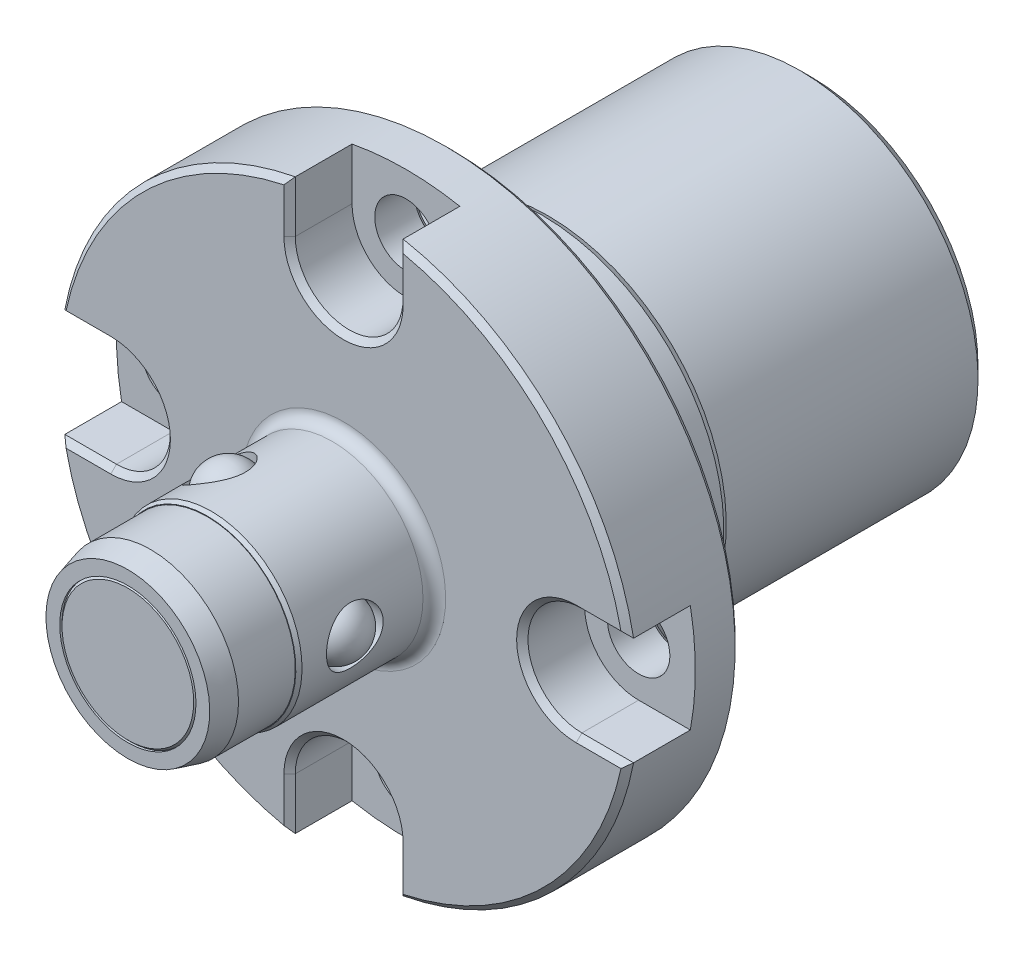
ISO-10303-21;
HEADER;
FILE_DESCRIPTION(('STEP AP214'),'2;1');
FILE_NAME('part.step','',(''),(''),'','','');
FILE_SCHEMA(('AUTOMOTIVE_DESIGN { 1 0 10303 214 1 1 1 1 }'));
ENDSEC;
DATA;
#1=APPLICATION_CONTEXT('core data for automotive mechanical design processes');
#2=APPLICATION_PROTOCOL_DEFINITION('international standard','automotive_design',2000,#1);
#3=PRODUCT_CONTEXT('',#1,'mechanical');
#4=PRODUCT('Part','Part','',(#3));
#5=PRODUCT_RELATED_PRODUCT_CATEGORY('part','',(#4));
#6=PRODUCT_DEFINITION_FORMATION('','',#4);
#7=PRODUCT_DEFINITION_CONTEXT('part definition',#1,'design');
#8=PRODUCT_DEFINITION('design','',#6,#7);
#9=PRODUCT_DEFINITION_SHAPE('','',#8);
#10=(LENGTH_UNIT() NAMED_UNIT(*) SI_UNIT(.MILLI.,.METRE.));
#11=(NAMED_UNIT(*) PLANE_ANGLE_UNIT() SI_UNIT($,.RADIAN.));
#12=(NAMED_UNIT(*) SI_UNIT($,.STERADIAN.) SOLID_ANGLE_UNIT());
#13=UNCERTAINTY_MEASURE_WITH_UNIT(LENGTH_MEASURE(1.E-05),#10,'distance_accuracy_value','');
#14=(GEOMETRIC_REPRESENTATION_CONTEXT(3) GLOBAL_UNCERTAINTY_ASSIGNED_CONTEXT((#13)) GLOBAL_UNIT_ASSIGNED_CONTEXT((#10,
#11,#12)) REPRESENTATION_CONTEXT('',''));
#15=CARTESIAN_POINT('',(0.,0.,0.));
#16=DIRECTION('',(0.,0.,1.));
#17=DIRECTION('',(1.,0.,0.));
#18=AXIS2_PLACEMENT_3D('',#15,#16,#17);
#19=CARTESIAN_POINT('',(0.,0.,32.50943495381));
#20=DIRECTION('',(0.,0.,1.));
#21=DIRECTION('',(0.,-1.,0.));
#22=AXIS2_PLACEMENT_3D('',#19,#20,#21);
#23=CYLINDRICAL_SURFACE('',#22,6.86208518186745);
#24=CARTESIAN_POINT('',(-1.03017564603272,6.78431655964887,16.5));
#25=CARTESIAN_POINT('',(-1.03017071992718,6.7843155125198,16.364676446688));
#26=CARTESIAN_POINT('',(-1.04189546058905,6.78256746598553,16.2293783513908));
#27=CARTESIAN_POINT('',(-1.08808872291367,6.77530919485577,15.9628427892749));
#28=CARTESIAN_POINT('',(-1.12255762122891,6.769798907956,15.8316053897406));
#29=CARTESIAN_POINT('',(-1.21228133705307,6.7543047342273,15.5771084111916));
#30=CARTESIAN_POINT('',(-1.26748883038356,6.74433102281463,15.4538314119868));
#31=CARTESIAN_POINT('',(-1.3961714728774,6.71886941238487,15.2178385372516));
#32=CARTESIAN_POINT('',(-1.46965176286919,6.70337996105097,15.1051256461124));
#33=CARTESIAN_POINT('',(-1.63552638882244,6.6648933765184,14.8881787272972));
#34=CARTESIAN_POINT('',(-1.72859304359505,6.64160456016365,14.7845103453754));
#35=CARTESIAN_POINT('',(-1.92819784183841,6.58642373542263,14.5937188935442));
#36=CARTESIAN_POINT('',(-2.03473864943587,6.55453002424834,14.50659910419));
#37=CARTESIAN_POINT('',(-2.26136157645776,6.47990082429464,14.3486958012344));
#38=CARTESIAN_POINT('',(-2.38176698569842,6.43685227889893,14.2785212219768));
#39=CARTESIAN_POINT('',(-2.62900503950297,6.33988501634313,14.1605625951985));
#40=CARTESIAN_POINT('',(-2.75583557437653,6.28596985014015,14.1127712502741));
#41=CARTESIAN_POINT('',(-3.0061760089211,6.17003705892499,14.0429019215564));
#42=CARTESIAN_POINT('',(-3.1296093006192,6.1084414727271,14.0198514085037));
#43=CARTESIAN_POINT('',(-3.37411407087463,5.97685680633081,13.9970082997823));
#44=CARTESIAN_POINT('',(-3.4951862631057,5.90687030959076,13.9972085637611));
#45=CARTESIAN_POINT('',(-3.72562444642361,5.76415297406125,14.0202814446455));
#46=CARTESIAN_POINT('',(-3.83527308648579,5.69170327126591,14.0420939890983));
#47=CARTESIAN_POINT('',(-4.04624054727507,5.54371372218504,14.1059971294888));
#48=CARTESIAN_POINT('',(-4.14755878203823,5.46817365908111,14.1480891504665));
#49=CARTESIAN_POINT('',(-4.34121888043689,5.31577317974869,14.2518814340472));
#50=CARTESIAN_POINT('',(-4.43341225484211,5.23890928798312,14.3138525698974));
#51=CARTESIAN_POINT('',(-4.60581560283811,5.08800757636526,14.4554090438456));
#52=CARTESIAN_POINT('',(-4.68602182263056,5.01397064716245,14.5349998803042));
#53=CARTESIAN_POINT('',(-4.83771657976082,4.86789618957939,14.714707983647));
#54=CARTESIAN_POINT('',(-4.90847396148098,4.79619783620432,14.8157194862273));
#55=CARTESIAN_POINT('',(-5.03510958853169,4.66308323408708,15.0327769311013));
#56=CARTESIAN_POINT('',(-5.09098451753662,4.60166927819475,15.1488262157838));
#57=CARTESIAN_POINT('',(-5.18834808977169,4.49163464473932,15.395663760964));
#58=CARTESIAN_POINT('',(-5.22952804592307,4.44329312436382,15.5266995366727));
#59=CARTESIAN_POINT('',(-5.29543820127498,4.36454075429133,15.7979645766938));
#60=CARTESIAN_POINT('',(-5.32017693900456,4.3341205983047,15.9381890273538));
#61=CARTESIAN_POINT('',(-5.35200052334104,4.29475428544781,16.2159555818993));
#62=CARTESIAN_POINT('',(-5.35994549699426,4.28476278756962,16.3532508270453));
#63=CARTESIAN_POINT('',(-5.36063606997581,4.28390006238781,16.6279223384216));
#64=CARTESIAN_POINT('',(-5.35338516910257,4.29302443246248,16.7652985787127));
#65=CARTESIAN_POINT('',(-5.32446261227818,4.32883280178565,17.0299348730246));
#66=CARTESIAN_POINT('',(-5.30343650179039,4.35473017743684,17.1573744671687));
#67=CARTESIAN_POINT('',(-5.24787450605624,4.42152689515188,17.4051679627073));
#68=CARTESIAN_POINT('',(-5.21333594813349,4.46242920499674,17.5255204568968));
#69=CARTESIAN_POINT('',(-5.12959279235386,4.55847325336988,17.7605461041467));
#70=CARTESIAN_POINT('',(-5.07990416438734,4.61407535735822,17.8748578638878));
#71=CARTESIAN_POINT('',(-4.96676050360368,4.73565090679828,18.0904253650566));
#72=CARTESIAN_POINT('',(-4.90330068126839,4.80162795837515,18.1916765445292));
#73=CARTESIAN_POINT('',(-4.75891229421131,4.94488549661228,18.3844631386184));
#74=CARTESIAN_POINT('',(-4.67717176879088,5.0226039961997,18.4750680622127));
#75=CARTESIAN_POINT('',(-4.49961848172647,5.18226606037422,18.63668980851));
#76=CARTESIAN_POINT('',(-4.40380585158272,5.26420958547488,18.7077068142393));
#77=CARTESIAN_POINT('',(-4.20005075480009,5.42814769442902,18.8276058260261));
#78=CARTESIAN_POINT('',(-4.09216503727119,5.51014037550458,18.8765863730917));
#79=CARTESIAN_POINT('',(-3.86633225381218,5.67087805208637,18.9509847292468));
#80=CARTESIAN_POINT('',(-3.74838964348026,5.74962446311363,18.9764129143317));
#81=CARTESIAN_POINT('',(-3.51255255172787,5.89647493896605,19.0019135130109));
#82=CARTESIAN_POINT('',(-3.39501657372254,5.9649267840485,19.0033111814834));
#83=CARTESIAN_POINT('',(-3.15748644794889,6.09399341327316,18.9840827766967));
#84=CARTESIAN_POINT('',(-3.03749257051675,6.15460905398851,18.9634591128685));
#85=CARTESIAN_POINT('',(-2.80145529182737,6.26551765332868,18.9016933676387));
#86=CARTESIAN_POINT('',(-2.68538302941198,6.316008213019,18.8610122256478));
#87=CARTESIAN_POINT('',(-2.45793730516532,6.40794982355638,18.760735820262));
#88=CARTESIAN_POINT('',(-2.3465647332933,6.4493991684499,18.7011369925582));
#89=CARTESIAN_POINT('',(-2.12735489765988,6.52507259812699,18.5619354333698));
#90=CARTESIAN_POINT('',(-2.019848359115,6.55893197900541,18.4816144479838));
#91=CARTESIAN_POINT('',(-1.81676444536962,6.61806518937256,18.3044037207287));
#92=CARTESIAN_POINT('',(-1.72119124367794,6.64333602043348,18.2075082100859));
#93=CARTESIAN_POINT('',(-1.54084303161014,6.68753062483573,17.9942335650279));
#94=CARTESIAN_POINT('',(-1.45682863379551,6.70608182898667,17.8771313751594));
#95=CARTESIAN_POINT('',(-1.30900095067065,6.73650121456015,17.6299810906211));
#96=CARTESIAN_POINT('',(-1.24518763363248,6.74836940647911,17.4999330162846));
#97=CARTESIAN_POINT('',(-1.13996493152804,6.76695159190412,17.2276668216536));
#98=CARTESIAN_POINT('',(-1.09902437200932,6.77355883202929,17.0852586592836));
#99=CARTESIAN_POINT('',(-1.04413998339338,6.78224061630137,16.7952215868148));
#100=CARTESIAN_POINT('',(-1.03018101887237,6.78431770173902,16.6475956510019));
#101=CARTESIAN_POINT('',(-1.03017564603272,6.78431655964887,16.5));
#102=B_SPLINE_CURVE_WITH_KNOTS('',3,(#24,#25,#26,#27,#28,#29,#30,#31,#32,#33,#34,#35,#36,#37,
#38,#39,#40,#41,#42,#43,#44,#45,#46,#47,#48,#49,#50,#51,#52,#53,#54,#55,#56,#57,#58,#59,#60,#61,
#62,#63,#64,#65,#66,#67,#68,#69,#70,#71,#72,#73,#74,#75,#76,#77,#78,#79,#80,#81,#82,#83,#84,#85,
#86,#87,#88,#89,#90,#91,#92,#93,#94,#95,#96,#97,#98,#99,#100,#101),.UNSPECIFIED.,.T.,.F.,(4,2,2,
2,2,2,2,2,2,2,2,2,2,2,2,2,2,2,2,2,2,2,2,2,2,2,2,2,2,2,2,2,2,2,2,2,2,2,4),(0.,0.405421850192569,
0.810850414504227,1.21535938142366,1.61998228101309,2.04183986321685,2.46378098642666,
2.89916570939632,3.33440838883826,3.75183369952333,4.16913081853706,4.5669247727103,
4.96474668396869,5.36823762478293,5.77185465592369,6.19787859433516,6.62399738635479,
7.05860294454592,7.49298261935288,7.90451454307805,8.31595169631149,8.70936773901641,
9.10286163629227,9.51054763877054,9.91837565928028,10.3503559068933,10.7823321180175,
11.212356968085,11.642192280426,12.0482416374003,12.4542465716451,12.8513278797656,
13.2484840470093,13.6618784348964,14.07541699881,14.5092605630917,14.9431034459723,
15.385540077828,15.827728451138),.UNSPECIFIED.);
#103=CARTESIAN_POINT('',(-1.03017564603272,6.78431655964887,16.5));
#104=VERTEX_POINT('',#103);
#105=EDGE_CURVE('E19',#104,#104,#102,.T.);
#106=ORIENTED_EDGE('',*,*,#105,.T.);
#107=EDGE_LOOP('',(#106));
#108=FACE_BOUND('',#107,.T.);
#109=CARTESIAN_POINT('',(-5.35920469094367,4.28568992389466,16.5));
#110=CARTESIAN_POINT('',(-5.35920600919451,4.28568497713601,16.3683562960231));
#111=CARTESIAN_POINT('',(-5.35212611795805,4.2945859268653,16.2367428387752));
#112=CARTESIAN_POINT('',(-5.32385171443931,4.32958646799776,15.9774060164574));
#113=CARTESIAN_POINT('',(-5.30266030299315,4.35568228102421,15.8496818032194));
#114=CARTESIAN_POINT('',(-5.24632135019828,4.42337451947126,15.6018462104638));
#115=CARTESIAN_POINT('',(-5.21119134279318,4.46495146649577,15.4817254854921));
#116=CARTESIAN_POINT('',(-5.12719755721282,4.56115329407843,15.2519750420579));
#117=CARTESIAN_POINT('',(-5.07833135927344,4.61578047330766,15.1423471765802));
#118=CARTESIAN_POINT('',(-4.96585818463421,4.73660487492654,14.9335709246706));
#119=CARTESIAN_POINT('',(-4.90191478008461,4.80305609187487,14.8347510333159));
#120=CARTESIAN_POINT('',(-4.7606566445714,4.94310036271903,14.6530067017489));
#121=CARTESIAN_POINT('',(-4.68333985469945,5.01669451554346,14.5700847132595));
#122=CARTESIAN_POINT('',(-4.51337466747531,5.17022398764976,14.4192342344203));
#123=CARTESIAN_POINT('',(-4.42027910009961,5.25029170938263,14.3519432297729));
#124=CARTESIAN_POINT('',(-4.22248701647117,5.41063911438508,14.2377371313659));
#125=CARTESIAN_POINT('',(-4.11778992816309,5.49091880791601,14.1908230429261));
#126=CARTESIAN_POINT('',(-3.89834109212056,5.64885211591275,14.1181526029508));
#127=CARTESIAN_POINT('',(-3.78352905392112,5.72648553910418,14.0925341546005));
#128=CARTESIAN_POINT('',(-3.54735918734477,5.87570950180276,14.0635345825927));
#129=CARTESIAN_POINT('',(-3.42600163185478,5.94730029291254,14.0601525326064));
#130=CARTESIAN_POINT('',(-3.18115352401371,6.08176259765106,14.0756364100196));
#131=CARTESIAN_POINT('',(-3.05768673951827,6.14469728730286,14.094330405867));
#132=CARTESIAN_POINT('',(-2.81147588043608,6.26117963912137,14.1532741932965));
#133=CARTESIAN_POINT('',(-2.68873181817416,6.3147271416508,14.1935243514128));
#134=CARTESIAN_POINT('',(-2.44771141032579,6.41200862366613,14.2948084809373));
#135=CARTESIAN_POINT('',(-2.32944413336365,6.4557234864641,14.3558823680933));
#136=CARTESIAN_POINT('',(-2.101670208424,6.53342882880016,14.4974793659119));
#137=CARTESIAN_POINT('',(-1.99216427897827,6.56741851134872,14.5780040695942));
#138=CARTESIAN_POINT('',(-1.78517948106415,6.62669104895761,14.7573449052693));
#139=CARTESIAN_POINT('',(-1.68778915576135,6.65191197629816,14.8562838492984));
#140=CARTESIAN_POINT('',(-1.50978749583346,6.69456155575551,15.0697350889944));
#141=CARTESIAN_POINT('',(-1.42917519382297,6.7119906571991,15.1842464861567));
#142=CARTESIAN_POINT('',(-1.28929175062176,6.74025042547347,15.4240067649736));
#143=CARTESIAN_POINT('',(-1.22971129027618,6.75117850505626,15.5490632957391));
#144=CARTESIAN_POINT('',(-1.13293164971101,6.76809553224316,15.8078687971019));
#145=CARTESIAN_POINT('',(-1.09572572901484,6.7740859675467,15.9416151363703));
#146=CARTESIAN_POINT('',(-1.04655235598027,6.78185360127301,16.2080401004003));
#147=CARTESIAN_POINT('',(-1.033601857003,6.78379528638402,16.3405328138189));
#148=CARTESIAN_POINT('',(-1.03053673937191,6.78426220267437,16.6057768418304));
#149=CARTESIAN_POINT('',(-1.04041833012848,6.78278800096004,16.738528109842));
#150=CARTESIAN_POINT('',(-1.08199111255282,6.77627654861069,16.9969312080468));
#151=CARTESIAN_POINT('',(-1.11311253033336,6.77133228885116,17.1226778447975));
#152=CARTESIAN_POINT('',(-1.19520982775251,6.75732248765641,17.3672574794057));
#153=CARTESIAN_POINT('',(-1.2461872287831,6.74825663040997,17.4860899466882));
#154=CARTESIAN_POINT('',(-1.36709104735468,6.72481390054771,17.7160830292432));
#155=CARTESIAN_POINT('',(-1.43736655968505,6.71033721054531,17.8270496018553));
#156=CARTESIAN_POINT('',(-1.59366994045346,6.67494089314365,18.0361112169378));
#157=CARTESIAN_POINT('',(-1.67970098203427,6.65401996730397,18.1342036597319));
#158=CARTESIAN_POINT('',(-1.86830880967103,6.60360021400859,18.3191955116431));
#159=CARTESIAN_POINT('',(-1.97142670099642,6.57377952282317,18.4054560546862));
#160=CARTESIAN_POINT('',(-2.18771258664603,6.50499765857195,18.5598347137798));
#161=CARTESIAN_POINT('',(-2.30088193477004,6.46603525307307,18.6279503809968));
#162=CARTESIAN_POINT('',(-2.53612963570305,6.37749146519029,18.745950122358));
#163=CARTESIAN_POINT('',(-2.65835333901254,6.32768571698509,18.7953770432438));
#164=CARTESIAN_POINT('',(-2.90519080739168,6.21822312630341,18.8726441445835));
#165=CARTESIAN_POINT('',(-3.02980453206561,6.15856645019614,18.9004846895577));
#166=CARTESIAN_POINT('',(-3.27702845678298,6.03063820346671,18.9339096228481));
#167=CARTESIAN_POINT('',(-3.39964414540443,5.96239753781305,18.9395716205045));
#168=CARTESIAN_POINT('',(-3.63971174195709,5.81895725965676,18.9287279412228));
#169=CARTESIAN_POINT('',(-3.75716377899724,5.74375782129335,18.9122228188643));
#170=CARTESIAN_POINT('',(-3.98320513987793,5.5893592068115,18.8575505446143));
#171=CARTESIAN_POINT('',(-4.0918365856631,5.51018237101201,18.819494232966));
#172=CARTESIAN_POINT('',(-4.29841566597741,5.35059657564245,18.7226219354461));
#173=CARTESIAN_POINT('',(-4.39636264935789,5.27018754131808,18.6638046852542));
#174=CARTESIAN_POINT('',(-4.58030851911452,5.11115282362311,18.526206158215));
#175=CARTESIAN_POINT('',(-4.66622152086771,5.03254300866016,18.4472916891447));
#176=CARTESIAN_POINT('',(-4.82395307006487,4.88155999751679,18.2714497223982));
#177=CARTESIAN_POINT('',(-4.89577148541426,4.80918685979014,18.1745220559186));
#178=CARTESIAN_POINT('',(-5.02444062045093,4.67460162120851,17.9649025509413));
#179=CARTESIAN_POINT('',(-5.08128976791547,4.61239058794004,17.8522090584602));
#180=CARTESIAN_POINT('',(-5.1794701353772,4.50186519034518,17.6139374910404));
#181=CARTESIAN_POINT('',(-5.22080012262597,4.45355193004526,17.4883583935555));
#182=CARTESIAN_POINT('',(-5.28912926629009,4.3722196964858,17.2219891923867));
#183=CARTESIAN_POINT('',(-5.31539918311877,4.33998751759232,17.0807687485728));
#184=CARTESIAN_POINT('',(-5.35043323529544,4.29672892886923,16.7930185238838));
#185=CARTESIAN_POINT('',(-5.35920322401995,4.28569542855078,16.6464905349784));
#186=CARTESIAN_POINT('',(-5.35920469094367,4.28568992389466,16.5));
#187=B_SPLINE_CURVE_WITH_KNOTS('',3,(#109,#110,#111,#112,#113,#114,#115,#116,#117,#118,#119,
#120,#121,#122,#123,#124,#125,#126,#127,#128,#129,#130,#131,#132,#133,#134,#135,#136,#137,#138,
#139,#140,#141,#142,#143,#144,#145,#146,#147,#148,#149,#150,#151,#152,#153,#154,#155,#156,#157,
#158,#159,#160,#161,#162,#163,#164,#165,#166,#167,#168,#169,#170,#171,#172,#173,#174,#175,#176,
#177,#178,#179,#180,#181,#182,#183,#184,#185,#186),.UNSPECIFIED.,.T.,.F.,(4,2,2,2,2,2,2,2,2,2,2,
2,2,2,2,2,2,2,2,2,2,2,2,2,2,2,2,2,2,2,2,2,2,2,2,2,2,2,4),(0.,0.394396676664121,
0.788706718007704,1.18252230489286,1.57640730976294,1.980089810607,2.38383451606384,
2.80192596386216,3.22003803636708,3.64083701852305,4.0616184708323,4.47914431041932,
4.89667724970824,5.31501507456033,5.73338717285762,6.15465663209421,6.57590179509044,
6.99066462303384,7.40530243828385,7.80273787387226,8.2001073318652,8.58721560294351,
8.9743535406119,9.36901723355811,9.76376049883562,10.174996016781,10.5862870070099,
11.0070722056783,11.4278502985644,11.8471546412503,12.2664484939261,12.6836052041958,
13.1007873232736,13.5208096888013,13.940835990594,14.3609063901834,14.7810101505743,
15.2200339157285,15.6589108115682),.UNSPECIFIED.);
#188=CARTESIAN_POINT('',(-5.35920469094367,4.28568992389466,16.5));
#189=VERTEX_POINT('',#188);
#190=EDGE_CURVE('E587',#189,#189,#187,.T.);
#191=ORIENTED_EDGE('',*,*,#190,.T.);
#192=EDGE_LOOP('',(#191));
#193=FACE_BOUND('',#192,.T.);
#194=ADVANCED_FACE('F14',(#108,#193),#23,.T.);
#195=CARTESIAN_POINT('',(-3.15032358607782,5.45652051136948,16.5));
#196=DIRECTION('',(0.,0.,1.));
#197=DIRECTION('',(-0.5,0.866025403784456,0.));
#198=AXIS2_PLACEMENT_3D('',#195,#196,#197);
#199=SPHERICAL_SURFACE('',#198,2.5);
#200=ORIENTED_EDGE('',*,*,#190,.F.);
#201=EDGE_LOOP('',(#200));
#202=FACE_BOUND('',#201,.T.);
#203=ADVANCED_FACE('F578',(#202),#199,.T.);
#204=CARTESIAN_POINT('',(0.,0.,16.5));
#205=DIRECTION('',(0.499999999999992,-0.866025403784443,0.));
#206=DIRECTION('',(0.866025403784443,0.499999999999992,0.));
#207=AXIS2_PLACEMENT_3D('',#204,#205,#206);
#208=CYLINDRICAL_SURFACE('',#207,2.5);
#209=CARTESIAN_POINT('',(-1.63460752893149,7.83122329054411,16.5));
#210=CARTESIAN_POINT('',(-1.63460875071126,7.83122355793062,16.6366940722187));
#211=CARTESIAN_POINT('',(-1.64621391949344,7.82882770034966,16.7733975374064));
#212=CARTESIAN_POINT('',(-1.69203138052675,7.81905133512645,17.0427883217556));
#213=CARTESIAN_POINT('',(-1.72624978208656,7.81166948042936,17.1754745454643));
#214=CARTESIAN_POINT('',(-1.81553963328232,7.79139841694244,17.432889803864));
#215=CARTESIAN_POINT('',(-1.87057418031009,7.7785189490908,17.5576324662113));
#216=CARTESIAN_POINT('',(-1.9991310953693,7.74647319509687,17.796305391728));
#217=CARTESIAN_POINT('',(-2.07265672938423,7.72730579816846,17.9102337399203));
#218=CARTESIAN_POINT('',(-2.23798135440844,7.68108169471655,18.127957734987));
#219=CARTESIAN_POINT('',(-2.33027820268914,7.6537978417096,18.231327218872));
#220=CARTESIAN_POINT('',(-2.52834460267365,7.59066949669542,18.4211920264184));
#221=CARTESIAN_POINT('',(-2.63411603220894,7.55482381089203,18.5076849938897));
#222=CARTESIAN_POINT('',(-2.85815941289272,7.47298096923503,18.6632221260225));
#223=CARTESIAN_POINT('',(-2.97665998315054,7.42677255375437,18.7318274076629));
#224=CARTESIAN_POINT('',(-3.22005839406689,7.32452167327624,18.8467520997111));
#225=CARTESIAN_POINT('',(-3.3449547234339,7.26848152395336,18.8930767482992));
#226=CARTESIAN_POINT('',(-3.59296373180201,7.1490531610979,18.9607022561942));
#227=CARTESIAN_POINT('',(-3.71601243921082,7.08594520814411,18.9827314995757));
#228=CARTESIAN_POINT('',(-3.9601084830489,6.95247235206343,19.003448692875));
#229=CARTESIAN_POINT('',(-4.08115626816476,6.88210910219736,19.0021419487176));
#230=CARTESIAN_POINT('',(-4.31346546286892,6.73884341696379,18.9767034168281));
#231=CARTESIAN_POINT('',(-4.42492046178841,6.66611252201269,18.953361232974));
#232=CARTESIAN_POINT('',(-4.6397268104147,6.51843031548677,18.885810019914));
#233=CARTESIAN_POINT('',(-4.74307763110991,6.443478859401,18.8415996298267));
#234=CARTESIAN_POINT('',(-4.94071063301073,6.29324942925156,18.7330596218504));
#235=CARTESIAN_POINT('',(-5.03486633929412,6.21797868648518,18.6684903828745));
#236=CARTESIAN_POINT('',(-5.21108751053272,6.07105828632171,18.5212578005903));
#237=CARTESIAN_POINT('',(-5.29314990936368,5.999409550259,18.4385898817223));
#238=CARTESIAN_POINT('',(-5.44723580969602,5.85993838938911,18.2534527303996));
#239=CARTESIAN_POINT('',(-5.51869842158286,5.79239986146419,18.1503018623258));
#240=CARTESIAN_POINT('',(-5.64643661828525,5.66795613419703,17.9292097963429));
#241=CARTESIAN_POINT('',(-5.70271041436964,5.61105218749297,17.8112668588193));
#242=CARTESIAN_POINT('',(-5.7999157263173,5.51053011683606,17.5621650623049));
#243=CARTESIAN_POINT('',(-5.84066866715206,5.46706765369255,17.4308731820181));
#244=CARTESIAN_POINT('',(-5.9053177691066,5.39717657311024,17.159881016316));
#245=CARTESIAN_POINT('',(-5.92921998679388,5.37074183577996,17.0201837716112));
#246=CARTESIAN_POINT('',(-5.9591566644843,5.33750270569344,16.7423600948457));
#247=CARTESIAN_POINT('',(-5.96587034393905,5.3299523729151,16.6043960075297));
#248=CARTESIAN_POINT('',(-5.96328584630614,5.33284428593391,16.3288205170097));
#249=CARTESIAN_POINT('',(-5.95399014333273,5.34328375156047,16.1912090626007));
#250=CARTESIAN_POINT('',(-5.92005828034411,5.38084678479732,15.9243834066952));
#251=CARTESIAN_POINT('',(-5.89587348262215,5.40747918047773,15.7950414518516));
#252=CARTESIAN_POINT('',(-5.83292892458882,5.47531430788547,15.5439564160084));
#253=CARTESIAN_POINT('',(-5.79416678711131,5.51651941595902,15.4222145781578));
#254=CARTESIAN_POINT('',(-5.70123562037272,5.61252933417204,15.1859217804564));
#255=CARTESIAN_POINT('',(-5.6466566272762,5.6676902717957,15.0716771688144));
#256=CARTESIAN_POINT('',(-5.52320978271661,5.78805432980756,14.8570193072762));
#257=CARTESIAN_POINT('',(-5.45433821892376,5.85326005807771,14.7566096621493));
#258=CARTESIAN_POINT('',(-5.29994669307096,5.99348515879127,14.5681792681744));
#259=CARTESIAN_POINT('',(-5.21385504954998,6.06879924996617,14.4808444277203));
#260=CARTESIAN_POINT('',(-5.02827624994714,6.2234237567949,14.3262179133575));
#261=CARTESIAN_POINT('',(-4.92878970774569,6.30273398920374,14.2589253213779));
#262=CARTESIAN_POINT('',(-4.71906363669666,6.4612358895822,14.1469388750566));
#263=CARTESIAN_POINT('',(-4.60890915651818,6.54042408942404,14.1020814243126));
#264=CARTESIAN_POINT('',(-4.37988289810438,6.6959506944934,14.0358549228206));
#265=CARTESIAN_POINT('',(-4.2610138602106,6.77228998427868,14.014478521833));
#266=CARTESIAN_POINT('',(-4.02304860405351,6.91618483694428,13.9964179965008));
#267=CARTESIAN_POINT('',(-3.90416779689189,6.98397375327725,13.9987430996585));
#268=CARTESIAN_POINT('',(-3.66506125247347,7.11236518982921,14.0256236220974));
#269=CARTESIAN_POINT('',(-3.54483560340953,7.1729681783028,14.0501775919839));
#270=CARTESIAN_POINT('',(-3.3082520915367,7.28508118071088,14.1201880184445));
#271=CARTESIAN_POINT('',(-3.19186466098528,7.33669543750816,14.1653792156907));
#272=CARTESIAN_POINT('',(-2.96488501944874,7.43132519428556,14.2751416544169));
#273=CARTESIAN_POINT('',(-2.85429380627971,7.47433921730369,14.3397162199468));
#274=CARTESIAN_POINT('',(-2.6386018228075,7.55323919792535,14.4889455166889));
#275=CARTESIAN_POINT('',(-2.53381451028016,7.58883389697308,14.5742070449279));
#276=CARTESIAN_POINT('',(-2.33731998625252,7.65164013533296,14.7613197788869));
#277=CARTESIAN_POINT('',(-2.24561670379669,7.678849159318,14.8631759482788));
#278=CARTESIAN_POINT('',(-2.07570721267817,7.72654499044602,15.0846314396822));
#279=CARTESIAN_POINT('',(-1.99804883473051,7.74677921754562,15.2047068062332));
#280=CARTESIAN_POINT('',(-1.86337287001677,7.7802753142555,15.4567962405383));
#281=CARTESIAN_POINT('',(-1.80634693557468,7.79354000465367,15.5888054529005));
#282=CARTESIAN_POINT('',(-1.71951534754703,7.81313516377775,15.8494452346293));
#283=CARTESIAN_POINT('',(-1.68780419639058,7.81996021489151,15.9774050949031));
#284=CARTESIAN_POINT('',(-1.64535228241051,7.82900358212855,16.236907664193));
#285=CARTESIAN_POINT('',(-1.63460635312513,7.83122303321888,16.368449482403));
#286=CARTESIAN_POINT('',(-1.63460752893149,7.83122329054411,16.5));
#287=B_SPLINE_CURVE_WITH_KNOTS('',3,(#209,#210,#211,#212,#213,#214,#215,#216,#217,#218,#219,
#220,#221,#222,#223,#224,#225,#226,#227,#228,#229,#230,#231,#232,#233,#234,#235,#236,#237,#238,
#239,#240,#241,#242,#243,#244,#245,#246,#247,#248,#249,#250,#251,#252,#253,#254,#255,#256,#257,
#258,#259,#260,#261,#262,#263,#264,#265,#266,#267,#268,#269,#270,#271,#272,#273,#274,#275,#276,
#277,#278,#279,#280,#281,#282,#283,#284,#285,#286),.UNSPECIFIED.,.T.,.F.,(4,2,2,2,2,2,2,2,2,2,2,
2,2,2,2,2,2,2,2,2,2,2,2,2,2,2,2,2,2,2,2,2,2,2,2,2,2,2,4),(0.,0.409596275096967,
0.819303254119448,1.22828728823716,1.6373436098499,2.05914161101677,2.48099845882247,
2.91239643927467,3.34369294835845,3.76167445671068,4.1795609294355,4.58301965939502,
4.98650470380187,5.39492809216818,5.80345485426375,6.22900677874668,6.65460879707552,
7.08496941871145,7.51517527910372,7.92809866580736,8.34095824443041,8.74187944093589,
9.14286604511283,9.55535226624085,9.96794576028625,10.3976387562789,10.8273120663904,
11.2538047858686,11.6801639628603,12.0887760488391,12.4973614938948,12.9008369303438,
13.3043815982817,13.721613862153,14.1389711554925,14.5701559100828,15.0011660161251,
15.3954470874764,15.7896309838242),.UNSPECIFIED.);
#288=CARTESIAN_POINT('',(-1.63460752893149,7.83122329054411,16.5));
#289=VERTEX_POINT('',#288);
#290=EDGE_CURVE('E660',#289,#289,#287,.T.);
#291=ORIENTED_EDGE('',*,*,#290,.F.);
#292=EDGE_LOOP('',(#291));
#293=FACE_BOUND('',#292,.T.);
#294=ORIENTED_EDGE('',*,*,#105,.F.);
#295=EDGE_LOOP('',(#294));
#296=FACE_BOUND('',#295,.T.);
#297=ADVANCED_FACE('F582',(#293,#296),#208,.F.);
#298=CARTESIAN_POINT('',(0.,0.,16.5));
#299=DIRECTION('',(-1.,0.,0.));
#300=DIRECTION('',(0.,-1.,0.));
#301=AXIS2_PLACEMENT_3D('',#298,#299,#300);
#302=CYLINDRICAL_SURFACE('',#301,2.5);
#303=CARTESIAN_POINT('',(7.59934207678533,-2.5,16.5));
#304=CARTESIAN_POINT('',(7.59934291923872,-2.49999907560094,16.6366940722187));
#305=CARTESIAN_POINT('',(7.60307063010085,-2.48875077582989,16.7733975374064));
#306=CARTESIAN_POINT('',(7.61751277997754,-2.44418350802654,17.0427883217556));
#307=CARTESIAN_POINT('',(7.62822910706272,-2.4108585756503,17.1754745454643));
#308=CARTESIAN_POINT('',(7.6553187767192,-2.32339576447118,17.432889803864));
#309=CARTESIAN_POINT('',(7.67168210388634,-2.26929471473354,17.5576324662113));
#310=CARTESIAN_POINT('',(7.70820812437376,-2.14193828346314,17.796305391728));
#311=CARTESIAN_POINT('',(7.7283714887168,-2.06867951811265,17.9102337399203));
#312=CARTESIAN_POINT('',(7.77100255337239,-1.90239214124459,18.127957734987));
#313=CARTESIAN_POINT('',(7.79352246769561,-1.80881879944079,18.231327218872));
#314=CARTESIAN_POINT('',(7.83788491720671,-1.60572409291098,18.4211920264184));
#315=CARTESIAN_POINT('',(7.85972735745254,-1.49620050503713,18.5076849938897));
#316=CARTESIAN_POINT('',(7.90087106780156,-1.26125182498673,18.6632221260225));
#317=CARTESIAN_POINT('',(7.9201036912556,-1.13552311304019,18.7318274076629));
#318=CARTESIAN_POINT('',(7.95325103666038,-0.873608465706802,18.8467520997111));
#319=CARTESIAN_POINT('',(7.9671670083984,-0.737424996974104,18.8930767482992));
#320=CARTESIAN_POINT('',(7.98774351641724,-0.462928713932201,18.9607022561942));
#321=CARTESIAN_POINT('',(7.99461477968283,-0.324811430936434,18.9827314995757));
#322=CARTESIAN_POINT('',(8.00107191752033,-0.0466816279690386,19.003448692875));
#323=CARTESIAN_POINT('',(8.00065944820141,0.0933304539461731,19.0021419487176));
#324=CARTESIAN_POINT('',(7.99274232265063,0.366148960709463,18.9767034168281));
#325=CARTESIAN_POINT('',(7.98548301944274,0.499037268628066,18.953361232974));
#326=CARTESIAN_POINT('',(7.9649896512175,0.758906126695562,18.885810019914));
#327=CARTESIAN_POINT('',(7.95175519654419,0.885886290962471,18.8415996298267));
#328=CARTESIAN_POINT('',(7.92046919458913,1.13215620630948,18.7330596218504));
#329=CARTESIAN_POINT('',(7.90236067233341,1.25133281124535,18.6684903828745));
#330=CARTESIAN_POINT('',(7.86323445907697,1.47740502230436,18.5212578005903));
#331=CARTESIAN_POINT('',(7.84221603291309,1.58429751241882,18.4385898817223));
#332=CARTESIAN_POINT('',(7.79847341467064,1.78747539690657,18.2534527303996));
#333=CARTESIAN_POINT('',(7.77571463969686,1.88313309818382,18.1503018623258));
#334=CARTESIAN_POINT('',(7.73181230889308,2.05597948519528,17.9292097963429));
#335=CARTESIAN_POINT('',(7.71066894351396,2.13316599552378,17.8112668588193));
#336=CARTESIAN_POINT('',(7.67221693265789,2.26760930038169,17.5621650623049));
#337=CARTESIAN_POINT('',(7.65495380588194,2.32463361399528,17.4308731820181));
#338=CARTESIAN_POINT('',(7.62675090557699,2.41556691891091,17.159881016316));
#339=CARTESIAN_POINT('',(7.61580886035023,2.44948421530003,17.0201837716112));
#340=CARTESIAN_POINT('',(7.60199126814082,2.4920297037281,16.7423600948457));
#341=CARTESIAN_POINT('',(7.59880932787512,2.50161908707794,16.6043960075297));
#342=CARTESIAN_POINT('',(7.6000215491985,2.49793488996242,16.3288205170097));
#343=CARTESIAN_POINT('',(7.60441454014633,2.48466484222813,16.1912090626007));
#344=CARTESIAN_POINT('',(7.61997914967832,2.43649747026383,15.9243834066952));
#345=CARTESIAN_POINT('',(7.63095108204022,2.40223662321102,15.7950414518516));
#346=CARTESIAN_POINT('',(7.65822574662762,2.3138074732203,15.5439564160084));
#347=CARTESIAN_POINT('',(7.67452934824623,2.25963592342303,15.4222145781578));
#348=CARTESIAN_POINT('',(7.71121079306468,2.13115021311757,15.1859217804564));
#349=CARTESIAN_POINT('',(7.73169206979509,2.05630294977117,15.0716771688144));
#350=CARTESIAN_POINT('',(7.77420697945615,1.88921281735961,14.8570193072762));
#351=CARTESIAN_POINT('',(7.79624101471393,1.79696542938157,14.7566096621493));
#352=CARTESIAN_POINT('',(7.8404837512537,1.59314589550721,14.5681792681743));
#353=CARTESIAN_POINT('',(7.86266184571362,1.48093129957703,14.4808444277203));
#354=CARTESIAN_POINT('',(7.90378119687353,1.24290309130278,14.3262179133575));
#355=CARTESIAN_POINT('',(7.92272260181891,1.11709010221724,14.2589253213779));
#356=CARTESIAN_POINT('',(7.95512623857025,0.856211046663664,14.1469388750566));
#357=CARTESIAN_POINT('',(7.968627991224,0.72122036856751,14.1020814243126));
#358=CARTESIAN_POINT('',(7.98880485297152,0.445114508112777,14.0358549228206));
#359=CARTESIAN_POINT('',(7.99548209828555,0.304001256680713,14.014478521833));
#360=CARTESIAN_POINT('',(8.00111606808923,0.0259698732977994,13.9964179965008));
#361=CARTESIAN_POINT('',(8.00038258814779,-0.110878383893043,13.9987430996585));
#362=CARTESIAN_POINT('',(7.99201956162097,-0.382146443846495,14.0256236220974));
#363=CARTESIAN_POINT('',(7.98439046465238,-0.516566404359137,14.0501775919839));
#364=CARTESIAN_POINT('',(7.96319141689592,-0.77751023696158,14.1201880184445));
#365=CARTESIAN_POINT('',(7.94969695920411,-0.904111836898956,14.1653792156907));
#366=CARTESIAN_POINT('',(7.918158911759,-1.14799685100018,14.275141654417));
#367=CARTESIAN_POINT('',(7.90011454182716,-1.26527866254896,14.3397162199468));
#368=CARTESIAN_POINT('',(7.86059793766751,-1.49152338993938,14.4889455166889));
#369=CARTESIAN_POINT('',(7.83903019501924,-1.60006921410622,14.5742070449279));
#370=CARTESIAN_POINT('',(7.79517473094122,-1.80164158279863,14.7613197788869));
#371=CARTESIAN_POINT('',(7.77288679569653,-1.89466346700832,14.8631759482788));
#372=CARTESIAN_POINT('',(7.72923785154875,-2.06565731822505,15.0846314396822));
#373=CARTESIAN_POINT('',(7.70793201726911,-2.14302855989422,15.2047068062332));
#374=CARTESIAN_POINT('',(7.66960250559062,-2.27640941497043,15.4567962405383));
#375=CARTESIAN_POINT('',(7.65257709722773,-2.33242766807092,15.5888054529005));
#376=CARTESIAN_POINT('',(7.62613120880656,-2.41742360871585,15.8494452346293));
#377=CARTESIAN_POINT('',(7.61618630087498,-2.44829879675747,15.9774050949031));
#378=CARTESIAN_POINT('',(7.60279212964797,-2.48958491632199,16.236907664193));
#379=CARTESIAN_POINT('',(7.59934126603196,-2.50000088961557,16.368449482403));
#380=CARTESIAN_POINT('',(7.59934207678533,-2.5,16.5));
#381=B_SPLINE_CURVE_WITH_KNOTS('',3,(#303,#304,#305,#306,#307,#308,#309,#310,#311,#312,#313,
#314,#315,#316,#317,#318,#319,#320,#321,#322,#323,#324,#325,#326,#327,#328,#329,#330,#331,#332,
#333,#334,#335,#336,#337,#338,#339,#340,#341,#342,#343,#344,#345,#346,#347,#348,#349,#350,#351,
#352,#353,#354,#355,#356,#357,#358,#359,#360,#361,#362,#363,#364,#365,#366,#367,#368,#369,#370,
#371,#372,#373,#374,#375,#376,#377,#378,#379,#380),.UNSPECIFIED.,.T.,.F.,(4,2,2,2,2,2,2,2,2,2,2,
2,2,2,2,2,2,2,2,2,2,2,2,2,2,2,2,2,2,2,2,2,2,2,2,2,2,2,4),(0.,0.409596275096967,
0.819303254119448,1.22828728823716,1.6373436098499,2.05914161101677,2.48099845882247,
2.91239643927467,3.34369294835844,3.76167445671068,4.1795609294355,4.58301965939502,
4.98650470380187,5.39492809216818,5.80345485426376,6.22900677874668,6.65460879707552,
7.08496941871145,7.51517527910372,7.92809866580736,8.34095824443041,8.74187944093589,
9.14286604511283,9.55535226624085,9.96794576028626,10.3976387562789,10.8273120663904,
11.2538047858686,11.6801639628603,12.0887760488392,12.4973614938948,12.9008369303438,
13.3043815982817,13.721613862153,14.1389711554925,14.5701559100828,15.0011660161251,
15.3954470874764,15.7896309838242),.UNSPECIFIED.);
#382=CARTESIAN_POINT('',(7.59934207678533,-2.5,16.5));
#383=VERTEX_POINT('',#382);
#384=EDGE_CURVE('E632',#383,#383,#381,.T.);
#385=ORIENTED_EDGE('',*,*,#384,.F.);
#386=EDGE_LOOP('',(#385));
#387=FACE_BOUND('',#386,.T.);
#388=CARTESIAN_POINT('',(6.39047831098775,-2.5,16.5));
#389=CARTESIAN_POINT('',(6.39047494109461,-2.500003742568,16.364676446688));
#390=CARTESIAN_POINT('',(6.39482345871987,-2.4889757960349,16.2293783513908));
#391=CARTESIAN_POINT('',(6.41163424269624,-2.44534212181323,15.9628427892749));
#392=CARTESIAN_POINT('',(6.42409664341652,-2.41273603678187,15.8316053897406));
#393=CARTESIAN_POINT('',(6.45554015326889,-2.32728593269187,15.5771084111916));
#394=CARTESIAN_POINT('',(6.47450641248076,-2.27448798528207,15.4538314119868));
#395=CARTESIAN_POINT('',(6.51679733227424,-2.15031474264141,15.2178385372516));
#396=CARTESIAN_POINT('',(6.5401232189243,-2.07893421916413,15.1051256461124));
#397=CARTESIAN_POINT('',(6.58973017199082,-1.91603928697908,14.8881787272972));
#398=CARTESIAN_POINT('',(6.61609479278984,-1.82379679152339,14.7845103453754));
#399=CARTESIAN_POINT('',(6.66810919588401,-1.62334355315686,14.5937188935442));
#400=CARTESIAN_POINT('',(6.69375883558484,-1.51512965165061,14.50659910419));
#401=CARTESIAN_POINT('',(6.74243951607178,-1.28155383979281,14.3486958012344));
#402=CARTESIAN_POINT('',(6.76536108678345,-1.15575542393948,14.2785212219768));
#403=CARTESIAN_POINT('',(6.80500400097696,-0.893157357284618,14.1605625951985));
#404=CARTESIAN_POINT('',(6.82172736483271,-0.756361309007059,14.1127712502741));
#405=CARTESIAN_POINT('',(6.84649683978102,-0.481593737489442,14.0429019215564));
#406=CARTESIAN_POINT('',(6.8548701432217,-0.343899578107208,14.0198514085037));
#407=CARTESIAN_POINT('',(6.86316686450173,-0.0663599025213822,13.9970082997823));
#408=CARTESIAN_POINT('',(6.86309287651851,0.0734849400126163,13.9972085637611));
#409=CARTESIAN_POINT('',(6.85471513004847,0.344408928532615,14.0202814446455));
#410=CARTESIAN_POINT('',(6.84679616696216,0.475592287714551,14.0420939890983));
#411=CARTESIAN_POINT('',(6.82411718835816,0.732290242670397,14.1059971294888));
#412=CARTESIAN_POINT('',(6.80935669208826,0.857804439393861,14.1480891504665));
#413=CARTESIAN_POINT('',(6.77420405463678,1.1017192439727,14.2518814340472));
#414=CARTESIAN_POINT('',(6.75373465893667,1.21999299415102,14.3138525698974));
#415=CARTESIAN_POINT('',(6.70925161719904,1.44474952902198,14.4554090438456));
#416=CARTESIAN_POINT('',(6.68523686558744,1.55122861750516,14.5349998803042));
#417=CARTESIAN_POINT('',(6.63458005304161,1.75563735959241,14.714707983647));
#418=CARTESIAN_POINT('',(6.60786614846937,1.85276422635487,14.8157194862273));
#419=CARTESIAN_POINT('',(6.55590333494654,2.02899119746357,15.0327769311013));
#420=CARTESIAN_POINT('',(6.53065475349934,2.10808728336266,15.1488262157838));
#421=CARTESIAN_POINT('',(6.48404375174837,2.24742392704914,15.395663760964));
#422=CARTESIAN_POINT('',(6.46276874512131,2.30725757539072,15.5266995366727));
#423=CARTESIAN_POINT('',(6.42752226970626,2.4037136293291,15.7979645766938));
#424=CARTESIAN_POINT('',(6.41354701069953,2.44034808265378,15.9381890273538));
#425=CARTESIAN_POINT('',(6.39536657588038,2.4875912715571,16.2159555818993));
#426=CARTESIAN_POINT('',(6.39068617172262,2.49946756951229,16.3532508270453));
#427=CARTESIAN_POINT('',(6.39028431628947,2.50049698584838,16.6279223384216));
#428=CARTESIAN_POINT('',(6.39456080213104,2.4896553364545,16.7652985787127));
#429=CARTESIAN_POINT('',(6.41111048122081,2.44670348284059,17.0299348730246));
#430=CARTESIAN_POINT('',(6.42302521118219,2.41554564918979,17.1573744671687));
#431=CARTESIAN_POINT('',(6.45309186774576,2.33402919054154,17.4051679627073));
#432=CARTESIAN_POINT('',(6.47124502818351,2.28366676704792,17.5255204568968));
#433=CARTESIAN_POINT('',(6.51255003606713,2.16312104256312,17.7605461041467));
#434=CARTESIAN_POINT('',(6.53585855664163,2.09228837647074,17.8748578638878));
#435=CARTESIAN_POINT('',(6.58457424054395,1.9335153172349,18.0904253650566));
#436=CARTESIAN_POINT('',(6.60998213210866,1.84556897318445,18.1916765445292));
#437=CARTESIAN_POINT('',(6.6618526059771,1.648896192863,18.3844631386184));
#438=CARTESIAN_POINT('',(6.6882885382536,1.53924757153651,18.4750680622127));
#439=CARTESIAN_POINT('',(6.7377832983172,1.30565088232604,18.63668980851));
#440=CARTESIAN_POINT('',(6.76084215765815,1.18170294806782,18.7077068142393));
#441=CARTESIAN_POINT('',(6.8009391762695,0.923276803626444,18.8276058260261));
#442=CARTESIAN_POINT('',(6.81800406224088,0.788848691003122,18.8765863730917));
#443=CARTESIAN_POINT('',(6.8442905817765,0.512902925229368,18.9509847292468));
#444=CARTESIAN_POINT('',(6.853515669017,0.371388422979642,18.9764129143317));
#445=CARTESIAN_POINT('',(6.86277336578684,0.093722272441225,19.0019135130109));
#446=CARTESIAN_POINT('',(6.86328641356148,-0.0422927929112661,19.0033111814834));
#447=CARTESIAN_POINT('',(6.85629633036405,-0.31253323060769,18.9840827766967));
#448=CARTESIAN_POINT('',(6.84879407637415,-0.44675879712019,18.9634591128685));
#449=CARTESIAN_POINT('',(6.8268251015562,-0.706627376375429,18.9016933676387));
#450=CARTESIAN_POINT('',(6.81251507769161,-0.832394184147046,18.8610122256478));
#451=CARTESIAN_POINT('',(6.7784159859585,-1.0753387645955,18.760735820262));
#452=CARTESIAN_POINT('',(6.75862588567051,-1.19251491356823,18.7011369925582));
#453=CARTESIAN_POINT('',(6.71455608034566,-1.42019291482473,18.5619354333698));
#454=CARTESIAN_POINT('',(6.69012589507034,-1.53022599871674,18.4816144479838));
#455=CARTESIAN_POINT('',(6.63979480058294,-1.73566843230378,18.3044037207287));
#456=CARTESIAN_POINT('',(6.61389338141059,-1.83107266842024,18.2075082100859));
#457=CARTESIAN_POINT('',(6.56199292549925,-2.00935610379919,17.9942335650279));
#458=CARTESIAN_POINT('',(6.53605154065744,-2.09139030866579,17.8771313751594));
#459=CARTESIAN_POINT('',(6.48848165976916,-2.23462253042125,17.6299810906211));
#460=CARTESIAN_POINT('',(6.46685315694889,-2.29582058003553,17.4999330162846));
#461=CARTESIAN_POINT('',(6.43033445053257,-2.39623720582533,17.2276668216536));
#462=CARTESIAN_POINT('',(6.4155862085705,-2.43499639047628,17.0852586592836));
#463=CARTESIAN_POINT('',(6.39566265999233,-2.48686855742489,16.7952215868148));
#464=CARTESIAN_POINT('',(6.39048198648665,-2.49999591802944,16.6475956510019));
#465=CARTESIAN_POINT('',(6.39047831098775,-2.5,16.5));
#466=B_SPLINE_CURVE_WITH_KNOTS('',3,(#388,#389,#390,#391,#392,#393,#394,#395,#396,#397,#398,
#399,#400,#401,#402,#403,#404,#405,#406,#407,#408,#409,#410,#411,#412,#413,#414,#415,#416,#417,
#418,#419,#420,#421,#422,#423,#424,#425,#426,#427,#428,#429,#430,#431,#432,#433,#434,#435,#436,
#437,#438,#439,#440,#441,#442,#443,#444,#445,#446,#447,#448,#449,#450,#451,#452,#453,#454,#455,
#456,#457,#458,#459,#460,#461,#462,#463,#464,#465),.UNSPECIFIED.,.T.,.F.,(4,2,2,2,2,2,2,2,2,2,2,
2,2,2,2,2,2,2,2,2,2,2,2,2,2,2,2,2,2,2,2,2,2,2,2,2,2,2,4),(0.,0.405421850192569,
0.810850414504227,1.21535938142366,1.61998228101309,2.04183986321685,2.46378098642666,
2.89916570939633,3.33440838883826,3.75183369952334,4.16913081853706,4.5669247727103,
4.96474668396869,5.36823762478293,5.7718546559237,6.19787859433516,6.62399738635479,
7.05860294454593,7.49298261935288,7.90451454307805,8.31595169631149,8.70936773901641,
9.10286163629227,9.51054763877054,9.91837565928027,10.3503559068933,10.7823321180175,
11.212356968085,11.642192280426,12.0482416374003,12.4542465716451,12.8513278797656,
13.2484840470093,13.6618784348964,14.07541699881,14.5092605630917,14.9431034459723,
15.385540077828,15.827728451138),.UNSPECIFIED.);
#467=CARTESIAN_POINT('',(6.39047831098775,-2.5,16.5));
#468=VERTEX_POINT('',#467);
#469=EDGE_CURVE('E616',#468,#468,#466,.T.);
#470=ORIENTED_EDGE('',*,*,#469,.F.);
#471=EDGE_LOOP('',(#470));
#472=FACE_BOUND('',#471,.T.);
#473=ADVANCED_FACE('F622',(#387,#472),#302,.F.);
#474=CARTESIAN_POINT('',(0.,0.,16.5));
#475=DIRECTION('',(0.5,0.866025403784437,0.));
#476=DIRECTION('',(-0.866025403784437,0.5,0.));
#477=AXIS2_PLACEMENT_3D('',#474,#475,#476);
#478=CYLINDRICAL_SURFACE('',#477,2.5);
#479=CARTESIAN_POINT('',(-5.96473454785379,-5.33122329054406,16.5));
#480=CARTESIAN_POINT('',(-5.96473416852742,-5.33122448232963,16.6366940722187));
#481=CARTESIAN_POINT('',(-5.95685671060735,-5.34007692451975,16.7733975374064));
#482=CARTESIAN_POINT('',(-5.92548139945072,-5.37486782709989,17.0427883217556));
#483=CARTESIAN_POINT('',(-5.90197932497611,-5.40081090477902,17.1754745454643));
#484=CARTESIAN_POINT('',(-5.83977914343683,-5.46800265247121,17.432889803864));
#485=CARTESIAN_POINT('',(-5.80110792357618,-5.50922423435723,17.5576324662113));
#486=CARTESIAN_POINT('',(-5.70907702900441,-5.6045349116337,17.796305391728));
#487=CARTESIAN_POINT('',(-5.65571475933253,-5.65862628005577,17.9102337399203));
#488=CARTESIAN_POINT('',(-5.53302119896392,-5.77868955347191,18.127957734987));
#489=CARTESIAN_POINT('',(-5.46324426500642,-5.84497904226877,18.231327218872));
#490=CARTESIAN_POINT('',(-5.30954031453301,-5.9849454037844,18.4211920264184));
#491=CARTESIAN_POINT('',(-5.22561132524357,-6.05862330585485,18.5076849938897));
#492=CARTESIAN_POINT('',(-5.04271165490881,-6.21172914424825,18.6632221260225));
#493=CARTESIAN_POINT('',(-4.94344370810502,-6.29124944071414,18.7318274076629));
#494=CARTESIAN_POINT('',(-4.73319264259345,-6.45091320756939,18.8467520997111));
#495=CARTESIAN_POINT('',(-4.62221228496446,-6.5310565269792,18.8930767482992));
#496=CARTESIAN_POINT('',(-4.3947797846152,-6.68612444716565,18.9607022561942));
#497=CARTESIAN_POINT('',(-4.27860234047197,-6.76113377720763,18.9827314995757));
#498=CARTESIAN_POINT('',(-4.0409634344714,-6.90579072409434,19.003448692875));
#499=CARTESIAN_POINT('',(-3.91950318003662,-6.97543955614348,19.0021419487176));
#500=CARTESIAN_POINT('',(-3.67927685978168,-7.1049923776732,18.9767034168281));
#501=CARTESIAN_POINT('',(-3.5605625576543,-7.1651497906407,18.953361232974));
#502=CARTESIAN_POINT('',(-3.32526284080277,-7.27733644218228,18.885810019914));
#503=CARTESIAN_POINT('',(-3.20867756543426,-7.32936515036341,18.8415996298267));
#504=CARTESIAN_POINT('',(-2.97975856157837,-7.42540563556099,18.7330596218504));
#505=CARTESIAN_POINT('',(-2.86749433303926,-7.46931149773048,18.6684903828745));
#506=CARTESIAN_POINT('',(-2.65214694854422,-7.54846330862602,18.5212578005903));
#507=CARTESIAN_POINT('',(-2.54906612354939,-7.58370706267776,18.4385898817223));
#508=CARTESIAN_POINT('',(-2.35123760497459,-7.64741378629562,18.2534527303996));
#509=CARTESIAN_POINT('',(-2.25701621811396,-7.67553295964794,18.1503018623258));
#510=CARTESIAN_POINT('',(-2.08537569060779,-7.72393561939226,17.9292097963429));
#511=CARTESIAN_POINT('',(-2.00795852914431,-7.74421818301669,17.8112668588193));
#512=CARTESIAN_POINT('',(-1.87230120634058,-7.7781394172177,17.5621650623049));
#513=CARTESIAN_POINT('',(-1.81428513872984,-7.79170126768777,17.4308731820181));
#514=CARTESIAN_POINT('',(-1.72143313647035,-7.8127434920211,17.159881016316));
#515=CARTESIAN_POINT('',(-1.68658887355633,-7.82022605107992,17.0201837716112));
#516=CARTESIAN_POINT('',(-1.6428346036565,-7.82953240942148,16.7423600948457));
#517=CARTESIAN_POINT('',(-1.63293898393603,-7.83157145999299,16.6043960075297));
#518=CARTESIAN_POINT('',(-1.63673570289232,-7.83077917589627,16.3288205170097));
#519=CARTESIAN_POINT('',(-1.65042439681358,-7.82794859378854,16.1912090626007));
#520=CARTESIAN_POINT('',(-1.69992086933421,-7.81734425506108,15.9243834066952));
#521=CARTESIAN_POINT('',(-1.73507759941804,-7.80971580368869,15.7950414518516));
#522=CARTESIAN_POINT('',(-1.82529682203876,-7.78912178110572,15.5439564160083));
#523=CARTESIAN_POINT('',(-1.8803625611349,-7.77615533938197,15.4222145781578));
#524=CARTESIAN_POINT('',(-2.00997517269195,-7.74367954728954,15.1859217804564));
#525=CARTESIAN_POINT('',(-2.08503544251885,-7.72399322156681,15.0716771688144));
#526=CARTESIAN_POINT('',(-2.2509971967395,-7.67726714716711,14.8570193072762));
#527=CARTESIAN_POINT('',(-2.34190279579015,-7.65022548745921,14.7566096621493));
#528=CARTESIAN_POINT('',(-2.54053705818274,-7.58663105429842,14.5681792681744));
#529=CARTESIAN_POINT('',(-2.64880679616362,-7.54973054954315,14.4808444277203));
#530=CARTESIAN_POINT('',(-2.87550494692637,-7.46632684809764,14.3262179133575));
#531=CARTESIAN_POINT('',(-2.9939328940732,-7.41982409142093,14.2589253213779));
#532=CARTESIAN_POINT('',(-3.23606260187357,-7.3174469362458,14.1469388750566));
#533=CARTESIAN_POINT('',(-3.35971883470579,-7.26164445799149,14.1020814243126));
#534=CARTESIAN_POINT('',(-3.60892195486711,-7.14106520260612,14.0358549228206));
#535=CARTESIAN_POINT('',(-3.73446823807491,-7.07629124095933,14.014478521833));
#536=CARTESIAN_POINT('',(-3.97806746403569,-6.94215471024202,13.9964179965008));
#537=CARTESIAN_POINT('',(-4.09621479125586,-6.87309536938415,13.9987430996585));
#538=CARTESIAN_POINT('',(-4.32695830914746,-6.73021874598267,14.0256236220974));
#539=CARTESIAN_POINT('',(-4.43955486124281,-6.65640177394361,14.0501775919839));
#540=CARTESIAN_POINT('',(-4.65493932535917,-6.50757094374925,14.1201880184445));
#541=CARTESIAN_POINT('',(-4.75783229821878,-6.43258360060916,14.1653792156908));
#542=CARTESIAN_POINT('',(-4.95327389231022,-6.28332834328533,14.275141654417));
#543=CARTESIAN_POINT('',(-5.04582073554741,-6.20906055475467,14.3397162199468));
#544=CARTESIAN_POINT('',(-5.22199611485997,-6.06171580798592,14.4889455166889));
#545=CARTESIAN_POINT('',(-5.30521568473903,-5.98876468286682,14.574207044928));
#546=CARTESIAN_POINT('',(-5.45785474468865,-5.84999855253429,14.7613197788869));
#547=CARTESIAN_POINT('',(-5.5272700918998,-5.78418569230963,14.8631759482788));
#548=CARTESIAN_POINT('',(-5.65353063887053,-5.66088767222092,15.0846314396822));
#549=CARTESIAN_POINT('',(-5.70988318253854,-5.60375065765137,15.2047068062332));
#550=CARTESIAN_POINT('',(-5.80622963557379,-5.50386589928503,15.4567962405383));
#551=CARTESIAN_POINT('',(-5.846230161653,-5.46111233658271,15.5888054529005));
#552=CARTESIAN_POINT('',(-5.90661586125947,-5.39571155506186,15.8494452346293));
#553=CARTESIAN_POINT('',(-5.92838210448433,-5.37166141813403,15.9774050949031));
#554=CARTESIAN_POINT('',(-5.95743984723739,-5.33941866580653,16.236907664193));
#555=CARTESIAN_POINT('',(-5.96473491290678,-5.33122214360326,16.368449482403));
#556=CARTESIAN_POINT('',(-5.96473454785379,-5.33122329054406,16.5));
#557=B_SPLINE_CURVE_WITH_KNOTS('',3,(#479,#480,#481,#482,#483,#484,#485,#486,#487,#488,#489,
#490,#491,#492,#493,#494,#495,#496,#497,#498,#499,#500,#501,#502,#503,#504,#505,#506,#507,#508,
#509,#510,#511,#512,#513,#514,#515,#516,#517,#518,#519,#520,#521,#522,#523,#524,#525,#526,#527,
#528,#529,#530,#531,#532,#533,#534,#535,#536,#537,#538,#539,#540,#541,#542,#543,#544,#545,#546,
#547,#548,#549,#550,#551,#552,#553,#554,#555,#556),.UNSPECIFIED.,.T.,.F.,(4,2,2,2,2,2,2,2,2,2,2,
2,2,2,2,2,2,2,2,2,2,2,2,2,2,2,2,2,2,2,2,2,2,2,2,2,2,2,4),(0.,0.409596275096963,
0.819303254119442,1.22828728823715,1.63734360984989,2.05914161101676,2.48099845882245,
2.91239643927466,3.34369294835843,3.76167445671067,4.17956092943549,4.58301965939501,
4.98650470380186,5.39492809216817,5.80345485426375,6.22900677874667,6.65460879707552,
7.08496941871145,7.51517527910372,7.92809866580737,8.34095824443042,8.7418794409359,
9.14286604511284,9.55535226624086,9.96794576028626,10.3976387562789,10.8273120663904,
11.2538047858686,11.6801639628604,12.0887760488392,12.4973614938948,12.9008369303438,
13.3043815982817,13.721613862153,14.1389711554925,14.5701559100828,15.0011660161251,
15.3954470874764,15.7896309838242),.UNSPECIFIED.);
#558=CARTESIAN_POINT('',(-5.96473454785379,-5.33122329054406,16.5));
#559=VERTEX_POINT('',#558);
#560=EDGE_CURVE('E640',#559,#559,#557,.T.);
#561=ORIENTED_EDGE('',*,*,#560,.F.);
#562=EDGE_LOOP('',(#561));
#563=FACE_BOUND('',#562,.T.);
#564=CARTESIAN_POINT('',(-5.36030266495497,-4.28431655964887,16.5));
#565=CARTESIAN_POINT('',(-5.36030422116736,-4.2843117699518,16.364676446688));
#566=CARTESIAN_POINT('',(-5.35292799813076,-4.29359166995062,16.2293783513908));
#567=CARTESIAN_POINT('',(-5.32354551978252,-4.32996707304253,15.9628427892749));
#568=CARTESIAN_POINT('',(-5.30153902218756,-4.35706287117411,15.8316053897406));
#569=CARTESIAN_POINT('',(-5.24325881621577,-4.42701880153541,15.5771084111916));
#570=CARTESIAN_POINT('',(-5.20701758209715,-4.46984303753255,15.4538314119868));
#571=CARTESIAN_POINT('',(-5.12062585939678,-4.56855466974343,15.2178385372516));
#572=CARTESIAN_POINT('',(-5.07047145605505,-4.62444574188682,15.1051256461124));
#573=CARTESIAN_POINT('',(-4.95420378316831,-4.7488540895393,14.8881787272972));
#574=CARTESIAN_POINT('',(-4.88750174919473,-4.81780776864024,14.7845103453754));
#575=CARTESIAN_POINT('',(-4.73991135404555,-4.96308018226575,14.5937188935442));
#576=CARTESIAN_POINT('',(-4.65902018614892,-5.03940037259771,14.50659910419));
#577=CARTESIAN_POINT('',(-4.48107793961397,-5.19834698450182,14.3486958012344));
#578=CARTESIAN_POINT('',(-4.38359410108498,-5.28109685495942,14.2785212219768));
#579=CARTESIAN_POINT('',(-4.17599896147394,-5.44672765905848,14.1605625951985));
#580=CARTESIAN_POINT('',(-4.06589179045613,-5.52960854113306,14.1127712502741));
#581=CARTESIAN_POINT('',(-3.84032083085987,-5.68844332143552,14.0429019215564));
#582=CARTESIAN_POINT('',(-3.72526084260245,-5.76454189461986,14.0198514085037));
#583=CARTESIAN_POINT('',(-3.48905279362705,-5.91049690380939,13.9970082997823));
#584=CARTESIAN_POINT('',(-3.36790661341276,-5.98035524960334,13.9972085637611));
#585=CARTESIAN_POINT('',(-3.12909068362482,-6.10856190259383,14.0202814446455));
#586=CARTESIAN_POINT('',(-3.01152308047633,-6.16729555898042,14.0420939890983));
#587=CARTESIAN_POINT('',(-2.77787664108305,-6.2760039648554,14.1059971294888));
#588=CARTESIAN_POINT('',(-2.66179791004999,-6.32597809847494,14.1480891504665));
#589=CARTESIAN_POINT('',(-2.43298517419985,-6.41749242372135,14.2518814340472));
#590=CARTESIAN_POINT('',(-2.32032240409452,-6.4589022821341,14.3138525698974));
#591=CARTESIAN_POINT('',(-2.10343601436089,-6.53275710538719,14.4554090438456));
#592=CARTESIAN_POINT('',(-1.99921504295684,-6.56519926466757,14.5349998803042));
#593=CARTESIAN_POINT('',(-1.79686347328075,-6.62353354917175,14.714707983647));
#594=CARTESIAN_POINT('',(-1.69939218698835,-6.64896206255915,14.8157194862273));
#595=CARTESIAN_POINT('',(-1.52079374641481,-6.69207443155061,15.0327769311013));
#596=CARTESIAN_POINT('',(-1.43967023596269,-6.70975656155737,15.1488262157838));
#597=CARTESIAN_POINT('',(-1.29569566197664,-6.73905857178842,15.395663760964));
#598=CARTESIAN_POINT('',(-1.2332406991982,-6.75055069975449,15.5266995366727));
#599=CARTESIAN_POINT('',(-1.13208406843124,-6.76825438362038,15.7979645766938));
#600=CARTESIAN_POINT('',(-1.09337007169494,-6.77446868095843,15.9381890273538));
#601=CARTESIAN_POINT('',(-1.04336605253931,-6.78234555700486,16.2159555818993));
#602=CARTESIAN_POINT('',(-1.03074067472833,-6.78423035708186,16.3532508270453));
#603=CARTESIAN_POINT('',(-1.02964824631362,-6.78439704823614,16.6279223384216));
#604=CARTESIAN_POINT('',(-1.04117563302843,-6.78267976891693,16.7652985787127));
#605=CARTESIAN_POINT('',(-1.08664786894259,-6.7755362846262,17.0299348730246));
#606=CARTESIAN_POINT('',(-1.11958870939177,-6.77027582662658,17.1573744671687));
#607=CARTESIAN_POINT('',(-1.20521736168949,-6.75555608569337,17.4051679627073));
#608=CARTESIAN_POINT('',(-1.25790908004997,-6.74609597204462,17.5255204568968));
#609=CARTESIAN_POINT('',(-1.38295724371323,-6.72159429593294,17.7605461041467));
#610=CARTESIAN_POINT('',(-1.45595439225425,-6.70636373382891,17.8748578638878));
#611=CARTESIAN_POINT('',(-1.61781373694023,-6.66916622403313,18.0904253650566));
#612=CARTESIAN_POINT('',(-1.70668145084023,-6.64719693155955,18.1916765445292));
#613=CARTESIAN_POINT('',(-1.90294031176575,-6.59378168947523,18.3844631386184));
#614=CARTESIAN_POINT('',(-2.01111676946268,-6.56185156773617,18.4750680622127));
#615=CARTESIAN_POINT('',(-2.23816481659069,-6.48791694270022,18.63668980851));
#616=CARTESIAN_POINT('',(-2.35703630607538,-6.44591253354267,18.7077068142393));
#617=CARTESIAN_POINT('',(-2.60088842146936,-6.35142449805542,18.8276058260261));
#618=CARTESIAN_POINT('',(-2.72583902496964,-6.29898906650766,18.8765863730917));
#619=CARTESIAN_POINT('',(-2.97795832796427,-6.1837809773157,18.9509847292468));
#620=CARTESIAN_POINT('',(-3.10512602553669,-6.12101288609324,18.9764129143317));
#621=CARTESIAN_POINT('',(-3.35022081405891,-5.99019721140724,19.0019135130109));
#622=CARTESIAN_POINT('',(-3.4682698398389,-5.9226339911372,19.0033111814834));
#623=CARTESIAN_POINT('',(-3.69880988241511,-5.78146018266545,18.9840827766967));
#624=CARTESIAN_POINT('',(-3.81130150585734,-5.70785025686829,18.9634591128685));
#625=CARTESIAN_POINT('',(-4.02536980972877,-5.55889027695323,18.9016933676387));
#626=CARTESIAN_POINT('',(-4.12713204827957,-5.48361402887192,18.8610122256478));
#627=CARTESIAN_POINT('',(-4.32047868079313,-5.33261105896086,18.760735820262));
#628=CARTESIAN_POINT('',(-4.41206115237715,-5.25688425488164,18.7011369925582));
#629=CARTESIAN_POINT('',(-4.58720118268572,-5.10487968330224,18.5619354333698));
#630=CARTESIAN_POINT('',(-4.67027753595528,-5.02870598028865,18.4816144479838));
#631=CARTESIAN_POINT('',(-4.82303035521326,-4.88239675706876,18.3044037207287));
#632=CARTESIAN_POINT('',(-4.8927021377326,-4.81226335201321,18.2075082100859));
#633=CARTESIAN_POINT('',(-5.02114989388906,-4.67817452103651,17.9942335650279));
#634=CARTESIAN_POINT('',(-5.07922290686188,-4.61469152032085,17.8771313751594));
#635=CARTESIAN_POINT('',(-5.17948070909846,-4.50187868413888,17.6299810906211));
#636=CARTESIAN_POINT('',(-5.22166552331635,-4.45254882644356,17.4999330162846));
#637=CARTESIAN_POINT('',(-5.29036951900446,-4.37071438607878,17.2276668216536));
#638=CARTESIAN_POINT('',(-5.31656183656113,-4.33856244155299,17.0852586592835));
#639=CARTESIAN_POINT('',(-5.35152267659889,-4.29537205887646,16.7952215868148));
#640=CARTESIAN_POINT('',(-5.36030096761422,-4.28432178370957,16.6475956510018));
#641=CARTESIAN_POINT('',(-5.36030266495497,-4.28431655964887,16.5));
#642=B_SPLINE_CURVE_WITH_KNOTS('',3,(#564,#565,#566,#567,#568,#569,#570,#571,#572,#573,#574,
#575,#576,#577,#578,#579,#580,#581,#582,#583,#584,#585,#586,#587,#588,#589,#590,#591,#592,#593,
#594,#595,#596,#597,#598,#599,#600,#601,#602,#603,#604,#605,#606,#607,#608,#609,#610,#611,#612,
#613,#614,#615,#616,#617,#618,#619,#620,#621,#622,#623,#624,#625,#626,#627,#628,#629,#630,#631,
#632,#633,#634,#635,#636,#637,#638,#639,#640,#641),.UNSPECIFIED.,.T.,.F.,(4,2,2,2,2,2,2,2,2,2,2,
2,2,2,2,2,2,2,2,2,2,2,2,2,2,2,2,2,2,2,2,2,2,2,2,2,2,2,4),(0.,0.405421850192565,
0.810850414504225,1.21535938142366,1.61998228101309,2.04183986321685,2.46378098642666,
2.89916570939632,3.33440838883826,3.75183369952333,4.16913081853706,4.5669247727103,
4.96474668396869,5.36823762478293,5.7718546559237,6.19787859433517,6.6239973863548,
7.05860294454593,7.49298261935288,7.90451454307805,8.31595169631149,8.70936773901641,
9.10286163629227,9.51054763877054,9.91837565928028,10.3503559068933,10.7823321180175,
11.212356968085,11.642192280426,12.0482416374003,12.4542465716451,12.8513278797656,
13.2484840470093,13.6618784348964,14.07541699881,14.5092605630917,14.9431034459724,
15.385540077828,15.827728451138),.UNSPECIFIED.);
#643=CARTESIAN_POINT('',(-5.36030266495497,-4.28431655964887,16.5));
#644=VERTEX_POINT('',#643);
#645=EDGE_CURVE('E597',#644,#644,#642,.T.);
#646=ORIENTED_EDGE('',*,*,#645,.F.);
#647=EDGE_LOOP('',(#646));
#648=FACE_BOUND('',#647,.T.);
#649=ADVANCED_FACE('F537',(#563,#648),#478,.F.);
#650=CARTESIAN_POINT('',(0.,0.,28.5));
#651=DIRECTION('',(0.,0.,1.));
#652=DIRECTION('',(1.,0.,0.));
#653=AXIS2_PLACEMENT_3D('',#650,#651,#652);
#654=PLANE('',#653);
#655=CARTESIAN_POINT('',(0.,0.,28.5));
#656=DIRECTION('',(0.,0.,1.));
#657=DIRECTION('',(1.,0.,0.));
#658=AXIS2_PLACEMENT_3D('',#655,#656,#657);
#659=CIRCLE('',#658,5.8);
#660=CARTESIAN_POINT('',(5.8,0.,28.5));
#661=VERTEX_POINT('',#660);
#662=EDGE_CURVE('E1428',#661,#661,#659,.T.);
#663=ORIENTED_EDGE('',*,*,#662,.T.);
#664=EDGE_LOOP('',(#663));
#665=FACE_BOUND('',#664,.T.);
#666=ADVANCED_FACE('F533',(#665),#654,.T.);
#667=CARTESIAN_POINT('',(0.,0.,28.5));
#668=DIRECTION('',(0.,0.,-1.));
#669=DIRECTION('',(-1.,0.,0.));
#670=AXIS2_PLACEMENT_3D('',#667,#668,#669);
#671=CONICAL_SURFACE('',#670,5.8,0.78539816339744);
#672=CARTESIAN_POINT('',(0.,0.,28.3));
#673=DIRECTION('',(0.,0.,1.));
#674=DIRECTION('',(1.,0.,0.));
#675=AXIS2_PLACEMENT_3D('',#672,#673,#674);
#676=CIRCLE('',#675,6.);
#677=CARTESIAN_POINT('',(6.,0.,28.3));
#678=VERTEX_POINT('',#677);
#679=EDGE_CURVE('E1431',#678,#678,#676,.F.);
#680=ORIENTED_EDGE('',*,*,#679,.F.);
#681=EDGE_LOOP('',(#680));
#682=FACE_BOUND('',#681,.T.);
#683=ORIENTED_EDGE('',*,*,#662,.F.);
#684=EDGE_LOOP('',(#683));
#685=FACE_BOUND('',#684,.T.);
#686=ADVANCED_FACE('F536',(#682,#685),#671,.T.);
#687=CARTESIAN_POINT('',(4.15,0.,-31.7));
#688=DIRECTION('',(0.,0.,-1.));
#689=DIRECTION('',(0.,1.,0.));
#690=AXIS2_PLACEMENT_3D('',#687,#688,#689);
#691=PLANE('',#690);
#692=CARTESIAN_POINT('',(0.,0.,-31.7));
#693=DIRECTION('',(0.,0.,-1.));
#694=DIRECTION('',(0.,1.,0.));
#695=AXIS2_PLACEMENT_3D('',#692,#693,#694);
#696=CIRCLE('',#695,14.7);
#697=CARTESIAN_POINT('',(0.,14.7,-31.7));
#698=VERTEX_POINT('',#697);
#699=EDGE_CURVE('E470',#698,#698,#696,.T.);
#700=ORIENTED_EDGE('',*,*,#699,.T.);
#701=EDGE_LOOP('',(#700));
#702=FACE_BOUND('',#701,.T.);
#703=CARTESIAN_POINT('',(0.,0.,-31.7));
#704=DIRECTION('',(0.,0.,-1.));
#705=DIRECTION('',(0.,1.,0.));
#706=AXIS2_PLACEMENT_3D('',#703,#704,#705);
#707=CIRCLE('',#706,14.);
#708=CARTESIAN_POINT('',(0.,14.,-31.7));
#709=VERTEX_POINT('',#708);
#710=EDGE_CURVE('E1496',#709,#709,#707,.T.);
#711=ORIENTED_EDGE('',*,*,#710,.F.);
#712=EDGE_LOOP('',(#711));
#713=FACE_BOUND('',#712,.T.);
#714=ADVANCED_FACE('F541',(#702,#713),#691,.T.);
#715=CARTESIAN_POINT('',(0.,0.,-31.7));
#716=DIRECTION('',(0.,0.,-1.));
#717=DIRECTION('',(0.,1.,0.));
#718=AXIS2_PLACEMENT_3D('',#715,#716,#717);
#719=CYLINDRICAL_SURFACE('',#718,16.);
#720=CARTESIAN_POINT('',(0.,0.,0.));
#721=DIRECTION('',(0.,0.,-1.));
#722=DIRECTION('',(0.,1.,0.));
#723=AXIS2_PLACEMENT_3D('',#720,#721,#722);
#724=CIRCLE('',#723,16.);
#725=CARTESIAN_POINT('',(0.,16.,0.));
#726=VERTEX_POINT('',#725);
#727=EDGE_CURVE('E311',#726,#726,#724,.F.);
#728=ORIENTED_EDGE('',*,*,#727,.F.);
#729=EDGE_LOOP('',(#728));
#730=FACE_BOUND('',#729,.T.);
#731=CARTESIAN_POINT('',(0.,0.,-8.));
#732=DIRECTION('',(0.,0.,-1.));
#733=DIRECTION('',(0.,1.,0.));
#734=AXIS2_PLACEMENT_3D('',#731,#732,#733);
#735=CIRCLE('',#734,16.);
#736=CARTESIAN_POINT('',(0.,16.,-8.));
#737=VERTEX_POINT('',#736);
#738=EDGE_CURVE('E1641',#737,#737,#735,.T.);
#739=ORIENTED_EDGE('',*,*,#738,.F.);
#740=EDGE_LOOP('',(#739));
#741=FACE_BOUND('',#740,.T.);
#742=ADVANCED_FACE('F652',(#730,#741),#719,.T.);
#743=CARTESIAN_POINT('',(0.,0.,-31.7));
#744=DIRECTION('',(0.,0.,-1.));
#745=DIRECTION('',(0.,1.,0.));
#746=AXIS2_PLACEMENT_3D('',#743,#744,#745);
#747=CYLINDRICAL_SURFACE('',#746,8.);
#748=CARTESIAN_POINT('',(0.,0.,21.1535898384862));
#749=DIRECTION('',(0.,0.,-1.));
#750=DIRECTION('',(0.,1.,0.));
#751=AXIS2_PLACEMENT_3D('',#748,#749,#750);
#752=CIRCLE('',#751,8.);
#753=CARTESIAN_POINT('',(0.,8.,21.1535898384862));
#754=VERTEX_POINT('',#753);
#755=EDGE_CURVE('E1455',#754,#754,#752,.T.);
#756=ORIENTED_EDGE('',*,*,#755,.T.);
#757=EDGE_LOOP('',(#756));
#758=FACE_BOUND('',#757,.T.);
#759=CARTESIAN_POINT('',(0.,0.,10.5));
#760=DIRECTION('',(0.,0.,1.));
#761=DIRECTION('',(0.,-1.,0.));
#762=AXIS2_PLACEMENT_3D('',#759,#760,#761);
#763=CIRCLE('',#762,8.);
#764=CARTESIAN_POINT('',(0.,-8.,10.5));
#765=VERTEX_POINT('',#764);
#766=EDGE_CURVE('E1485',#765,#765,#763,.T.);
#767=ORIENTED_EDGE('',*,*,#766,.T.);
#768=EDGE_LOOP('',(#767));
#769=FACE_BOUND('',#768,.T.);
#770=ORIENTED_EDGE('',*,*,#560,.T.);
#771=EDGE_LOOP('',(#770));
#772=FACE_BOUND('',#771,.T.);
#773=ORIENTED_EDGE('',*,*,#384,.T.);
#774=EDGE_LOOP('',(#773));
#775=FACE_BOUND('',#774,.T.);
#776=ORIENTED_EDGE('',*,*,#290,.T.);
#777=EDGE_LOOP('',(#776));
#778=FACE_BOUND('',#777,.T.);
#779=ADVANCED_FACE('F646',(#758,#769,#772,#775,#778),#747,.T.);
#780=CARTESIAN_POINT('',(0.,0.,-31.7));
#781=DIRECTION('',(0.,0.,-1.));
#782=DIRECTION('',(0.,1.,0.));
#783=AXIS2_PLACEMENT_3D('',#780,#781,#782);
#784=CYLINDRICAL_SURFACE('',#783,14.);
#785=CARTESIAN_POINT('',(0.,0.,-29.6));
#786=DIRECTION('',(0.,0.,-1.));
#787=DIRECTION('',(0.,1.,0.));
#788=AXIS2_PLACEMENT_3D('',#785,#786,#787);
#789=CIRCLE('',#788,14.);
#790=CARTESIAN_POINT('',(4.92192894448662,-13.1062815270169,-29.6));
#791=VERTEX_POINT('',#790);
#792=CARTESIAN_POINT('',(-4.92192894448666,-13.1062815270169,-29.6));
#793=VERTEX_POINT('',#792);
#794=EDGE_CURVE('E1498',#791,#793,#789,.T.);
#795=ORIENTED_EDGE('',*,*,#794,.F.);
#796=CARTESIAN_POINT('',(0.,0.,-29.6));
#797=DIRECTION('',(0.,0.,1.));
#798=DIRECTION('',(-1.,0.,0.));
#799=AXIS2_PLACEMENT_3D('',#796,#797,#798);
#800=CIRCLE('',#799,14.);
#801=EDGE_CURVE('E1371',#791,#793,#800,.T.);
#802=ORIENTED_EDGE('',*,*,#801,.T.);
#803=EDGE_LOOP('',(#795,#802));
#804=FACE_BOUND('',#803,.T.);
#805=ORIENTED_EDGE('',*,*,#710,.T.);
#806=EDGE_LOOP('',(#805));
#807=FACE_BOUND('',#806,.T.);
#808=ADVANCED_FACE('F651',(#804,#807),#784,.F.);
#809=CARTESIAN_POINT('',(0.,0.,9.));
#810=DIRECTION('',(0.,0.,-1.));
#811=DIRECTION('',(0.,1.,0.));
#812=AXIS2_PLACEMENT_3D('',#809,#810,#811);
#813=CONICAL_SURFACE('',#812,25.5,0.785398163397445);
#814=CARTESIAN_POINT('',(0.,0.,9.));
#815=DIRECTION('',(0.,0.,1.));
#816=DIRECTION('',(0.,-1.,0.));
#817=AXIS2_PLACEMENT_3D('',#814,#815,#816);
#818=CIRCLE('',#817,25.5);
#819=CARTESIAN_POINT('',(25.0536923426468,-4.75000000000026,9.));
#820=VERTEX_POINT('',#819);
#821=CARTESIAN_POINT('',(4.75,-25.0536923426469,9.));
#822=VERTEX_POINT('',#821);
#823=EDGE_CURVE('E317',#820,#822,#818,.F.);
#824=ORIENTED_EDGE('',*,*,#823,.F.);
#825=CARTESIAN_POINT('',(25.0536923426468,-4.75000000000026,9.));
#826=CARTESIAN_POINT('',(24.9525526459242,-4.83377330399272,9.08377330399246));
#827=CARTESIAN_POINT('',(24.8510529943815,-4.91732661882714,9.16732661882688));
#828=CARTESIAN_POINT('',(24.6473337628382,-5.08399328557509,9.33399328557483));
#829=CARTESIAN_POINT('',(24.5451141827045,-5.16710663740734,9.41710663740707));
#830=CARTESIAN_POINT('',(24.4425346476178,-5.25000000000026,9.5));
#831=B_SPLINE_CURVE_WITH_KNOTS('',3,(#825,#826,#827,#828,#829,#830),.UNSPECIFIED.,.F.,.F.,(4,2,
4),(0.,0.467311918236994,0.934623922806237),.UNSPECIFIED.);
#832=CARTESIAN_POINT('',(24.4425346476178,-5.25000000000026,9.5));
#833=VERTEX_POINT('',#832);
#834=EDGE_CURVE('E464',#820,#833,#831,.T.);
#835=ORIENTED_EDGE('',*,*,#834,.T.);
#836=CARTESIAN_POINT('',(0.,0.,9.5));
#837=DIRECTION('',(0.,0.,1.));
#838=DIRECTION('',(0.,-1.,0.));
#839=AXIS2_PLACEMENT_3D('',#836,#837,#838);
#840=CIRCLE('',#839,25.);
#841=CARTESIAN_POINT('',(5.25,-24.4425346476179,9.5));
#842=VERTEX_POINT('',#841);
#843=EDGE_CURVE('E326',#842,#833,#840,.T.);
#844=ORIENTED_EDGE('',*,*,#843,.F.);
#845=CARTESIAN_POINT('',(5.25,-24.4425346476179,9.5));
#846=CARTESIAN_POINT('',(5.16710663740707,-24.5451141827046,9.41710663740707));
#847=CARTESIAN_POINT('',(5.08399328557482,-24.6473337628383,9.33399328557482));
#848=CARTESIAN_POINT('',(4.91732661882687,-24.8510529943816,9.16732661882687));
#849=CARTESIAN_POINT('',(4.83377330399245,-24.9525526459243,9.08377330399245));
#850=CARTESIAN_POINT('',(4.75,-25.0536923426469,9.));
#851=B_SPLINE_CURVE_WITH_KNOTS('',3,(#845,#846,#847,#848,#849,#850),.UNSPECIFIED.,.F.,.F.,(4,2,
4),(0.,0.467312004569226,0.934623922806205),.UNSPECIFIED.);
#852=EDGE_CURVE('E351',#842,#822,#851,.T.);
#853=ORIENTED_EDGE('',*,*,#852,.T.);
#854=EDGE_LOOP('',(#824,#835,#844,#853));
#855=FACE_BOUND('',#854,.T.);
#856=ADVANCED_FACE('F837',(#855),#813,.T.);
#857=CARTESIAN_POINT('',(24.442534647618,5.24999999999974,9.5));
#858=VERTEX_POINT('',#857);
#859=CARTESIAN_POINT('',(5.25000000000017,24.4425346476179,9.5));
#860=VERTEX_POINT('',#859);
#861=EDGE_CURVE('E330',#858,#860,#840,.T.);
#862=ORIENTED_EDGE('',*,*,#861,.F.);
#863=CARTESIAN_POINT('',(24.442534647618,5.24999999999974,9.5));
#864=CARTESIAN_POINT('',(24.5451141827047,5.16710663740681,9.41710663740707));
#865=CARTESIAN_POINT('',(24.6473337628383,5.08399328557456,9.33399328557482));
#866=CARTESIAN_POINT('',(24.8510529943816,4.91732661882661,9.16732661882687));
#867=CARTESIAN_POINT('',(24.9525526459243,4.83377330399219,9.08377330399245));
#868=CARTESIAN_POINT('',(25.0536923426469,4.74999999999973,9.));
#869=B_SPLINE_CURVE_WITH_KNOTS('',3,(#863,#864,#865,#866,#867,#868),.UNSPECIFIED.,.F.,.F.,(4,2,
4),(0.,0.467312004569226,0.934623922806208),.UNSPECIFIED.);
#870=CARTESIAN_POINT('',(25.0536923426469,4.74999999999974,9.));
#871=VERTEX_POINT('',#870);
#872=EDGE_CURVE('E451',#858,#871,#869,.T.);
#873=ORIENTED_EDGE('',*,*,#872,.T.);
#874=CARTESIAN_POINT('',(4.75000000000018,25.0536923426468,9.));
#875=VERTEX_POINT('',#874);
#876=EDGE_CURVE('E1610',#875,#871,#818,.F.);
#877=ORIENTED_EDGE('',*,*,#876,.F.);
#878=CARTESIAN_POINT('',(4.75000000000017,25.0536923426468,9.));
#879=CARTESIAN_POINT('',(4.83377330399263,24.9525526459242,9.08377330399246));
#880=CARTESIAN_POINT('',(4.91732661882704,24.8510529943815,9.16732661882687));
#881=CARTESIAN_POINT('',(5.08399328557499,24.6473337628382,9.33399328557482));
#882=CARTESIAN_POINT('',(5.16710663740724,24.5451141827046,9.41710663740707));
#883=CARTESIAN_POINT('',(5.25000000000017,24.4425346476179,9.5));
#884=B_SPLINE_CURVE_WITH_KNOTS('',3,(#878,#879,#880,#881,#882,#883),.UNSPECIFIED.,.F.,.F.,(4,2,
4),(0.,0.467311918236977,0.934623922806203),.UNSPECIFIED.);
#885=EDGE_CURVE('E429',#875,#860,#884,.T.);
#886=ORIENTED_EDGE('',*,*,#885,.T.);
#887=EDGE_LOOP('',(#862,#873,#877,#886));
#888=FACE_BOUND('',#887,.T.);
#889=ADVANCED_FACE('F846',(#888),#813,.T.);
#890=CARTESIAN_POINT('',(-5.24999999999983,24.4425346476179,9.5));
#891=VERTEX_POINT('',#890);
#892=CARTESIAN_POINT('',(-24.4425346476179,5.25000000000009,9.5));
#893=VERTEX_POINT('',#892);
#894=EDGE_CURVE('E1544',#891,#893,#840,.T.);
#895=ORIENTED_EDGE('',*,*,#894,.F.);
#896=CARTESIAN_POINT('',(-5.24999999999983,24.4425346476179,9.5));
#897=CARTESIAN_POINT('',(-5.16710663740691,24.5451141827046,9.41710663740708));
#898=CARTESIAN_POINT('',(-5.08399328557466,24.6473337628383,9.33399328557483));
#899=CARTESIAN_POINT('',(-4.91732661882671,24.8510529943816,9.16732661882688));
#900=CARTESIAN_POINT('',(-4.83377330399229,24.9525526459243,9.08377330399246));
#901=CARTESIAN_POINT('',(-4.74999999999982,25.0536923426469,9.));
#902=B_SPLINE_CURVE_WITH_KNOTS('',3,(#896,#897,#898,#899,#900,#901),.UNSPECIFIED.,.F.,.F.,(4,2,
4),(0.,0.467312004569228,0.93462392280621),.UNSPECIFIED.);
#903=CARTESIAN_POINT('',(-4.74999999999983,25.0536923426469,9.));
#904=VERTEX_POINT('',#903);
#905=EDGE_CURVE('E416',#891,#904,#902,.T.);
#906=ORIENTED_EDGE('',*,*,#905,.T.);
#907=CARTESIAN_POINT('',(-25.0536923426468,4.75000000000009,9.));
#908=VERTEX_POINT('',#907);
#909=EDGE_CURVE('E322',#908,#904,#818,.F.);
#910=ORIENTED_EDGE('',*,*,#909,.F.);
#911=CARTESIAN_POINT('',(-25.0536923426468,4.75000000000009,9.));
#912=CARTESIAN_POINT('',(-24.9525526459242,4.83377330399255,9.08377330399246));
#913=CARTESIAN_POINT('',(-24.8510529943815,4.91732661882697,9.16732661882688));
#914=CARTESIAN_POINT('',(-24.6473337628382,5.08399328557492,9.33399328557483));
#915=CARTESIAN_POINT('',(-24.5451141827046,5.16710663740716,9.41710663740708));
#916=CARTESIAN_POINT('',(-24.4425346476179,5.25000000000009,9.5));
#917=B_SPLINE_CURVE_WITH_KNOTS('',3,(#911,#912,#913,#914,#915,#916),.UNSPECIFIED.,.F.,.F.,(4,2,
4),(0.,0.467311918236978,0.934623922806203),.UNSPECIFIED.);
#918=EDGE_CURVE('E391',#908,#893,#917,.T.);
#919=ORIENTED_EDGE('',*,*,#918,.T.);
#920=EDGE_LOOP('',(#895,#906,#910,#919));
#921=FACE_BOUND('',#920,.T.);
#922=ADVANCED_FACE('F1064',(#921),#813,.T.);
#923=CARTESIAN_POINT('',(4.15,0.,9.5));
#924=DIRECTION('',(0.,0.,1.));
#925=DIRECTION('',(0.,-1.,0.));
#926=AXIS2_PLACEMENT_3D('',#923,#924,#925);
#927=PLANE('',#926);
#928=CARTESIAN_POINT('',(0.,0.,9.5));
#929=DIRECTION('',(0.,0.,1.));
#930=DIRECTION('',(0.,-1.,0.));
#931=AXIS2_PLACEMENT_3D('',#928,#929,#930);
#932=CIRCLE('',#931,9.);
#933=CARTESIAN_POINT('',(0.,-9.,9.5));
#934=VERTEX_POINT('',#933);
#935=EDGE_CURVE('E1482',#934,#934,#932,.F.);
#936=ORIENTED_EDGE('',*,*,#935,.T.);
#937=EDGE_LOOP('',(#936));
#938=FACE_BOUND('',#937,.T.);
#939=CARTESIAN_POINT('',(20.5,-2.14726102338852E-13,9.5));
#940=DIRECTION('',(0.,0.,1.));
#941=DIRECTION('',(0.,-1.,0.));
#942=AXIS2_PLACEMENT_3D('',#939,#940,#941);
#943=CIRCLE('',#942,5.25);
#944=CARTESIAN_POINT('',(20.5,-5.25000000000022,9.5));
#945=VERTEX_POINT('',#944);
#946=CARTESIAN_POINT('',(20.5,5.24999999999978,9.5));
#947=VERTEX_POINT('',#946);
#948=EDGE_CURVE('E1621',#945,#947,#943,.F.);
#949=ORIENTED_EDGE('',*,*,#948,.T.);
#950=DIRECTION('',(1.,0.,0.));
#951=VECTOR('',#950,1.);
#952=CARTESIAN_POINT('',(24.5446022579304,5.24999999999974,9.5));
#953=LINE('',#952,#951);
#954=EDGE_CURVE('E459',#947,#858,#953,.T.);
#955=ORIENTED_EDGE('',*,*,#954,.T.);
#956=ORIENTED_EDGE('',*,*,#861,.T.);
#957=DIRECTION('',(0.,-1.,0.));
#958=VECTOR('',#957,1.);
#959=CARTESIAN_POINT('',(5.25000000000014,20.5,9.5));
#960=LINE('',#959,#958);
#961=CARTESIAN_POINT('',(5.25000000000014,20.5,9.5));
#962=VERTEX_POINT('',#961);
#963=EDGE_CURVE('E1538',#860,#962,#960,.T.);
#964=ORIENTED_EDGE('',*,*,#963,.T.);
#965=CARTESIAN_POINT('',(1.43150734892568E-13,20.5,9.5));
#966=DIRECTION('',(0.,0.,1.));
#967=DIRECTION('',(0.,-1.,0.));
#968=AXIS2_PLACEMENT_3D('',#965,#966,#967);
#969=CIRCLE('',#968,5.25);
#970=CARTESIAN_POINT('',(-5.24999999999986,20.5,9.5));
#971=VERTEX_POINT('',#970);
#972=EDGE_CURVE('E1539',#962,#971,#969,.F.);
#973=ORIENTED_EDGE('',*,*,#972,.T.);
#974=DIRECTION('',(0.,1.,0.));
#975=VECTOR('',#974,1.);
#976=CARTESIAN_POINT('',(-5.24999999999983,24.5446022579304,9.5));
#977=LINE('',#976,#975);
#978=EDGE_CURVE('E424',#971,#891,#977,.T.);
#979=ORIENTED_EDGE('',*,*,#978,.T.);
#980=ORIENTED_EDGE('',*,*,#894,.T.);
#981=DIRECTION('',(1.,0.,0.));
#982=VECTOR('',#981,1.);
#983=CARTESIAN_POINT('',(-20.5,5.25000000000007,9.5));
#984=LINE('',#983,#982);
#985=CARTESIAN_POINT('',(-20.5,5.25000000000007,9.5));
#986=VERTEX_POINT('',#985);
#987=EDGE_CURVE('E1583',#893,#986,#984,.T.);
#988=ORIENTED_EDGE('',*,*,#987,.T.);
#989=CARTESIAN_POINT('',(-20.5,0.,9.5));
#990=DIRECTION('',(0.,0.,1.));
#991=DIRECTION('',(0.,-1.,0.));
#992=AXIS2_PLACEMENT_3D('',#989,#990,#991);
#993=CIRCLE('',#992,5.25);
#994=CARTESIAN_POINT('',(-20.5,-5.24999999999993,9.5));
#995=VERTEX_POINT('',#994);
#996=EDGE_CURVE('E1533',#986,#995,#993,.F.);
#997=ORIENTED_EDGE('',*,*,#996,.T.);
#998=DIRECTION('',(-1.,0.,0.));
#999=VECTOR('',#998,1.);
#1000=CARTESIAN_POINT('',(-24.5446022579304,-5.24999999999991,9.5));
#1001=LINE('',#1000,#999);
#1002=CARTESIAN_POINT('',(-24.4425346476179,-5.24999999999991,9.5));
#1003=VERTEX_POINT('',#1002);
#1004=EDGE_CURVE('E386',#995,#1003,#1001,.T.);
#1005=ORIENTED_EDGE('',*,*,#1004,.T.);
#1006=CARTESIAN_POINT('',(-5.25,-24.4425346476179,9.5));
#1007=VERTEX_POINT('',#1006);
#1008=EDGE_CURVE('E325',#1003,#1007,#840,.T.);
#1009=ORIENTED_EDGE('',*,*,#1008,.T.);
#1010=DIRECTION('',(0.,1.,0.));
#1011=VECTOR('',#1010,1.);
#1012=CARTESIAN_POINT('',(-5.25,-20.5,9.5));
#1013=LINE('',#1012,#1011);
#1014=CARTESIAN_POINT('',(-5.25,-20.5,9.5));
#1015=VERTEX_POINT('',#1014);
#1016=EDGE_CURVE('E336',#1007,#1015,#1013,.T.);
#1017=ORIENTED_EDGE('',*,*,#1016,.T.);
#1018=CARTESIAN_POINT('',(0.,-20.5,9.5));
#1019=DIRECTION('',(0.,0.,1.));
#1020=DIRECTION('',(0.,-1.,0.));
#1021=AXIS2_PLACEMENT_3D('',#1018,#1019,#1020);
#1022=CIRCLE('',#1021,5.25);
#1023=CARTESIAN_POINT('',(5.25,-20.5,9.5));
#1024=VERTEX_POINT('',#1023);
#1025=EDGE_CURVE('E338',#1015,#1024,#1022,.F.);
#1026=ORIENTED_EDGE('',*,*,#1025,.T.);
#1027=DIRECTION('',(0.,-1.,0.));
#1028=VECTOR('',#1027,1.);
#1029=CARTESIAN_POINT('',(5.25,-24.5446022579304,9.5));
#1030=LINE('',#1029,#1028);
#1031=EDGE_CURVE('E340',#1024,#842,#1030,.T.);
#1032=ORIENTED_EDGE('',*,*,#1031,.T.);
#1033=ORIENTED_EDGE('',*,*,#843,.T.);
#1034=DIRECTION('',(-1.,0.,0.));
#1035=VECTOR('',#1034,1.);
#1036=CARTESIAN_POINT('',(20.5,-5.25000000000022,9.5));
#1037=LINE('',#1036,#1035);
#1038=EDGE_CURVE('E1619',#833,#945,#1037,.T.);
#1039=ORIENTED_EDGE('',*,*,#1038,.T.);
#1040=EDGE_LOOP('',(#949,#955,#956,#964,#973,#979,#980,#988,#997,#1005,#1009,#1017,#1026,#1032,
#1033,#1039));
#1041=FACE_BOUND('',#1040,.T.);
#1042=ADVANCED_FACE('F1094',(#938,#1041),#927,.T.);
#1043=CARTESIAN_POINT('',(16.,0.,0.));
#1044=DIRECTION('',(0.,0.,-1.));
#1045=DIRECTION('',(0.,1.,0.));
#1046=AXIS2_PLACEMENT_3D('',#1043,#1044,#1045);
#1047=PLANE('',#1046);
#1048=CARTESIAN_POINT('',(1.43150734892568E-13,20.5,0.));
#1049=DIRECTION('',(0.,0.,-1.));
#1050=DIRECTION('',(0.,1.,0.));
#1051=AXIS2_PLACEMENT_3D('',#1048,#1049,#1050);
#1052=CIRCLE('',#1051,3.25000000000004);
#1053=CARTESIAN_POINT('',(1.43150734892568E-13,23.75,0.));
#1054=VERTEX_POINT('',#1053);
#1055=EDGE_CURVE('E1467',#1054,#1054,#1052,.F.);
#1056=ORIENTED_EDGE('',*,*,#1055,.T.);
#1057=EDGE_LOOP('',(#1056));
#1058=FACE_BOUND('',#1057,.T.);
#1059=CARTESIAN_POINT('',(20.5,-2.14726102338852E-13,0.));
#1060=DIRECTION('',(0.,0.,-1.));
#1061=DIRECTION('',(0.,1.,0.));
#1062=AXIS2_PLACEMENT_3D('',#1059,#1060,#1061);
#1063=CIRCLE('',#1062,3.25000000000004);
#1064=CARTESIAN_POINT('',(20.5,3.24999999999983,0.));
#1065=VERTEX_POINT('',#1064);
#1066=EDGE_CURVE('E1470',#1065,#1065,#1063,.F.);
#1067=ORIENTED_EDGE('',*,*,#1066,.T.);
#1068=EDGE_LOOP('',(#1067));
#1069=FACE_BOUND('',#1068,.T.);
#1070=CARTESIAN_POINT('',(0.,-20.5,0.));
#1071=DIRECTION('',(0.,0.,-1.));
#1072=DIRECTION('',(0.,1.,0.));
#1073=AXIS2_PLACEMENT_3D('',#1070,#1071,#1072);
#1074=CIRCLE('',#1073,3.25000000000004);
#1075=CARTESIAN_POINT('',(0.,-17.25,0.));
#1076=VERTEX_POINT('',#1075);
#1077=EDGE_CURVE('E1473',#1076,#1076,#1074,.F.);
#1078=ORIENTED_EDGE('',*,*,#1077,.T.);
#1079=EDGE_LOOP('',(#1078));
#1080=FACE_BOUND('',#1079,.T.);
#1081=CARTESIAN_POINT('',(-20.5,0.,0.));
#1082=DIRECTION('',(0.,0.,-1.));
#1083=DIRECTION('',(0.,1.,0.));
#1084=AXIS2_PLACEMENT_3D('',#1081,#1082,#1083);
#1085=CIRCLE('',#1084,3.25);
#1086=CARTESIAN_POINT('',(-20.5,3.25000000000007,0.));
#1087=VERTEX_POINT('',#1086);
#1088=EDGE_CURVE('E1476',#1087,#1087,#1085,.F.);
#1089=ORIENTED_EDGE('',*,*,#1088,.T.);
#1090=EDGE_LOOP('',(#1089));
#1091=FACE_BOUND('',#1090,.T.);
#1092=CARTESIAN_POINT('',(0.,0.,0.));
#1093=DIRECTION('',(0.,0.,-1.));
#1094=DIRECTION('',(0.,1.,0.));
#1095=AXIS2_PLACEMENT_3D('',#1092,#1093,#1094);
#1096=CIRCLE('',#1095,25.);
#1097=CARTESIAN_POINT('',(0.,25.,0.));
#1098=VERTEX_POINT('',#1097);
#1099=EDGE_CURVE('E314',#1098,#1098,#1096,.T.);
#1100=ORIENTED_EDGE('',*,*,#1099,.T.);
#1101=EDGE_LOOP('',(#1100));
#1102=FACE_BOUND('',#1101,.T.);
#1103=ORIENTED_EDGE('',*,*,#727,.T.);
#1104=EDGE_LOOP('',(#1103));
#1105=FACE_BOUND('',#1104,.T.);
#1106=ADVANCED_FACE('F1086',(#1058,#1069,#1080,#1091,#1102,#1105),#1047,.T.);
#1107=CARTESIAN_POINT('',(0.,0.,-31.7));
#1108=DIRECTION('',(0.,0.,-1.));
#1109=DIRECTION('',(0.,1.,0.));
#1110=AXIS2_PLACEMENT_3D('',#1107,#1108,#1109);
#1111=CYLINDRICAL_SURFACE('',#1110,25.5);
#1112=DIRECTION('',(0.,0.,-1.));
#1113=VECTOR('',#1112,1.);
#1114=CARTESIAN_POINT('',(25.0536923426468,-4.75000000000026,-31.7));
#1115=LINE('',#1114,#1113);
#1116=CARTESIAN_POINT('',(25.0536923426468,-4.75000000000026,4.));
#1117=VERTEX_POINT('',#1116);
#1118=EDGE_CURVE('E1579',#820,#1117,#1115,.T.);
#1119=ORIENTED_EDGE('',*,*,#1118,.F.);
#1120=ORIENTED_EDGE('',*,*,#823,.T.);
#1121=DIRECTION('',(0.,0.,-1.));
#1122=VECTOR('',#1121,1.);
#1123=CARTESIAN_POINT('',(4.75,-25.0536923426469,-31.7));
#1124=LINE('',#1123,#1122);
#1125=CARTESIAN_POINT('',(4.75,-25.0536923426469,4.));
#1126=VERTEX_POINT('',#1125);
#1127=EDGE_CURVE('E304',#1126,#822,#1124,.F.);
#1128=ORIENTED_EDGE('',*,*,#1127,.F.);
#1129=CARTESIAN_POINT('',(0.,0.,4.));
#1130=DIRECTION('',(0.,0.,1.));
#1131=DIRECTION('',(0.,-1.,0.));
#1132=AXIS2_PLACEMENT_3D('',#1129,#1130,#1131);
#1133=CIRCLE('',#1132,25.5);
#1134=CARTESIAN_POINT('',(-4.75,-25.0536923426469,4.));
#1135=VERTEX_POINT('',#1134);
#1136=EDGE_CURVE('E329',#1126,#1135,#1133,.F.);
#1137=ORIENTED_EDGE('',*,*,#1136,.T.);
#1138=DIRECTION('',(0.,0.,-1.));
#1139=VECTOR('',#1138,1.);
#1140=CARTESIAN_POINT('',(-4.75,-25.0536923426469,-31.7));
#1141=LINE('',#1140,#1139);
#1142=CARTESIAN_POINT('',(-4.75,-25.0536923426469,9.));
#1143=VERTEX_POINT('',#1142);
#1144=EDGE_CURVE('E309',#1143,#1135,#1141,.T.);
#1145=ORIENTED_EDGE('',*,*,#1144,.F.);
#1146=CARTESIAN_POINT('',(-25.0536923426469,-4.74999999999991,9.));
#1147=VERTEX_POINT('',#1146);
#1148=EDGE_CURVE('E318',#1143,#1147,#818,.F.);
#1149=ORIENTED_EDGE('',*,*,#1148,.T.);
#1150=DIRECTION('',(0.,0.,-1.));
#1151=VECTOR('',#1150,1.);
#1152=CARTESIAN_POINT('',(-25.0536923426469,-4.74999999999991,-31.7));
#1153=LINE('',#1152,#1151);
#1154=CARTESIAN_POINT('',(-25.0536923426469,-4.74999999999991,4.));
#1155=VERTEX_POINT('',#1154);
#1156=EDGE_CURVE('E280',#1155,#1147,#1153,.F.);
#1157=ORIENTED_EDGE('',*,*,#1156,.F.);
#1158=CARTESIAN_POINT('',(0.,0.,4.));
#1159=DIRECTION('',(0.,0.,1.));
#1160=DIRECTION('',(0.,-1.,0.));
#1161=AXIS2_PLACEMENT_3D('',#1158,#1159,#1160);
#1162=CIRCLE('',#1161,25.5);
#1163=CARTESIAN_POINT('',(-25.0536923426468,4.75000000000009,4.));
#1164=VERTEX_POINT('',#1163);
#1165=EDGE_CURVE('E1519',#1155,#1164,#1162,.F.);
#1166=ORIENTED_EDGE('',*,*,#1165,.T.);
#1167=DIRECTION('',(0.,0.,-1.));
#1168=VECTOR('',#1167,1.);
#1169=CARTESIAN_POINT('',(-25.0536923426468,4.75000000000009,-31.7));
#1170=LINE('',#1169,#1168);
#1171=EDGE_CURVE('E285',#908,#1164,#1170,.T.);
#1172=ORIENTED_EDGE('',*,*,#1171,.F.);
#1173=ORIENTED_EDGE('',*,*,#909,.T.);
#1174=DIRECTION('',(0.,0.,-1.));
#1175=VECTOR('',#1174,1.);
#1176=CARTESIAN_POINT('',(-4.74999999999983,25.0536923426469,-31.7));
#1177=LINE('',#1176,#1175);
#1178=CARTESIAN_POINT('',(-4.74999999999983,25.0536923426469,4.));
#1179=VERTEX_POINT('',#1178);
#1180=EDGE_CURVE('E1555',#1179,#904,#1177,.F.);
#1181=ORIENTED_EDGE('',*,*,#1180,.F.);
#1182=CARTESIAN_POINT('',(0.,0.,4.));
#1183=DIRECTION('',(0.,0.,1.));
#1184=DIRECTION('',(0.,-1.,0.));
#1185=AXIS2_PLACEMENT_3D('',#1182,#1183,#1184);
#1186=CIRCLE('',#1185,25.5);
#1187=CARTESIAN_POINT('',(4.75000000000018,25.0536923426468,4.));
#1188=VERTEX_POINT('',#1187);
#1189=EDGE_CURVE('E1567',#1179,#1188,#1186,.F.);
#1190=ORIENTED_EDGE('',*,*,#1189,.T.);
#1191=DIRECTION('',(0.,0.,-1.));
#1192=VECTOR('',#1191,1.);
#1193=CARTESIAN_POINT('',(4.75000000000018,25.0536923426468,-31.7));
#1194=LINE('',#1193,#1192);
#1195=EDGE_CURVE('E1562',#875,#1188,#1194,.T.);
#1196=ORIENTED_EDGE('',*,*,#1195,.F.);
#1197=ORIENTED_EDGE('',*,*,#876,.T.);
#1198=DIRECTION('',(0.,0.,-1.));
#1199=VECTOR('',#1198,1.);
#1200=CARTESIAN_POINT('',(25.0536923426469,4.74999999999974,-31.7));
#1201=LINE('',#1200,#1199);
#1202=CARTESIAN_POINT('',(25.0536923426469,4.74999999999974,4.));
#1203=VERTEX_POINT('',#1202);
#1204=EDGE_CURVE('E1577',#1203,#871,#1201,.F.);
#1205=ORIENTED_EDGE('',*,*,#1204,.F.);
#1206=CARTESIAN_POINT('',(0.,0.,4.));
#1207=DIRECTION('',(0.,0.,1.));
#1208=DIRECTION('',(0.,-1.,0.));
#1209=AXIS2_PLACEMENT_3D('',#1206,#1207,#1208);
#1210=CIRCLE('',#1209,25.5);
#1211=EDGE_CURVE('E232',#1203,#1117,#1210,.F.);
#1212=ORIENTED_EDGE('',*,*,#1211,.T.);
#1213=EDGE_LOOP('',(#1119,#1120,#1128,#1137,#1145,#1149,#1157,#1166,#1172,#1173,#1181,#1190,
#1196,#1197,#1205,#1212));
#1214=FACE_BOUND('',#1213,.T.);
#1215=CARTESIAN_POINT('',(0.,0.,0.500000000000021));
#1216=DIRECTION('',(0.,0.,-1.));
#1217=DIRECTION('',(0.,1.,0.));
#1218=AXIS2_PLACEMENT_3D('',#1215,#1216,#1217);
#1219=CIRCLE('',#1218,25.5);
#1220=CARTESIAN_POINT('',(0.,25.5,0.500000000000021));
#1221=VERTEX_POINT('',#1220);
#1222=EDGE_CURVE('E321',#1221,#1221,#1219,.F.);
#1223=ORIENTED_EDGE('',*,*,#1222,.T.);
#1224=EDGE_LOOP('',(#1223));
#1225=FACE_BOUND('',#1224,.T.);
#1226=ADVANCED_FACE('F1078',(#1214,#1225),#1111,.T.);
#1227=CARTESIAN_POINT('',(8.,0.,28.5));
#1228=DIRECTION('',(0.,0.,1.));
#1229=DIRECTION('',(0.,-1.,0.));
#1230=AXIS2_PLACEMENT_3D('',#1227,#1228,#1229);
#1231=PLANE('',#1230);
#1232=CARTESIAN_POINT('',(0.,0.,28.5));
#1233=DIRECTION('',(0.,0.,1.));
#1234=DIRECTION('',(0.,-1.,0.));
#1235=AXIS2_PLACEMENT_3D('',#1232,#1233,#1234);
#1236=CIRCLE('',#1235,7.21410161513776);
#1237=CARTESIAN_POINT('',(0.,-7.21410161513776,28.5));
#1238=VERTEX_POINT('',#1237);
#1239=EDGE_CURVE('E1439',#1238,#1238,#1236,.T.);
#1240=ORIENTED_EDGE('',*,*,#1239,.T.);
#1241=EDGE_LOOP('',(#1240));
#1242=FACE_BOUND('',#1241,.T.);
#1243=CARTESIAN_POINT('',(0.,0.,28.5));
#1244=DIRECTION('',(0.,0.,1.));
#1245=DIRECTION('',(0.,-1.,0.));
#1246=AXIS2_PLACEMENT_3D('',#1243,#1244,#1245);
#1247=CIRCLE('',#1246,6.);
#1248=CARTESIAN_POINT('',(0.,-6.,28.5));
#1249=VERTEX_POINT('',#1248);
#1250=EDGE_CURVE('E666',#1249,#1249,#1247,.T.);
#1251=ORIENTED_EDGE('',*,*,#1250,.F.);
#1252=EDGE_LOOP('',(#1251));
#1253=FACE_BOUND('',#1252,.T.);
#1254=ADVANCED_FACE('F656',(#1242,#1253),#1231,.T.);
#1255=CARTESIAN_POINT('',(0.,0.,0.));
#1256=DIRECTION('',(0.,0.,1.));
#1257=DIRECTION('',(0.,-1.,0.));
#1258=AXIS2_PLACEMENT_3D('',#1255,#1256,#1257);
#1259=CONICAL_SURFACE('',#1258,25.,0.785398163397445);
#1260=ORIENTED_EDGE('',*,*,#1222,.F.);
#1261=EDGE_LOOP('',(#1260));
#1262=FACE_BOUND('',#1261,.T.);
#1263=ORIENTED_EDGE('',*,*,#1099,.F.);
#1264=EDGE_LOOP('',(#1263));
#1265=FACE_BOUND('',#1264,.T.);
#1266=ADVANCED_FACE('F1062',(#1262,#1265),#1259,.T.);
#1267=ORIENTED_EDGE('',*,*,#1008,.F.);
#1268=CARTESIAN_POINT('',(-24.4425346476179,-5.24999999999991,9.5));
#1269=CARTESIAN_POINT('',(-24.5451141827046,-5.16710663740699,9.41710663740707));
#1270=CARTESIAN_POINT('',(-24.6473337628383,-5.08399328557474,9.33399328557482));
#1271=CARTESIAN_POINT('',(-24.8510529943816,-4.91732661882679,9.16732661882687));
#1272=CARTESIAN_POINT('',(-24.9525526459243,-4.83377330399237,9.08377330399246));
#1273=CARTESIAN_POINT('',(-25.0536923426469,-4.74999999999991,9.));
#1274=B_SPLINE_CURVE_WITH_KNOTS('',3,(#1268,#1269,#1270,#1271,#1272,#1273),.UNSPECIFIED.,.F.,
.F.,(4,2,4),(0.,0.467312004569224,0.934623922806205),.UNSPECIFIED.);
#1275=EDGE_CURVE('E378',#1003,#1147,#1274,.T.);
#1276=ORIENTED_EDGE('',*,*,#1275,.T.);
#1277=ORIENTED_EDGE('',*,*,#1148,.F.);
#1278=CARTESIAN_POINT('',(-4.75,-25.0536923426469,9.));
#1279=CARTESIAN_POINT('',(-4.83377330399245,-24.9525526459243,9.08377330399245));
#1280=CARTESIAN_POINT('',(-4.91732661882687,-24.8510529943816,9.16732661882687));
#1281=CARTESIAN_POINT('',(-5.08399328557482,-24.6473337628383,9.33399328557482));
#1282=CARTESIAN_POINT('',(-5.16710663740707,-24.5451141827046,9.41710663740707));
#1283=CARTESIAN_POINT('',(-5.25,-24.4425346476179,9.5));
#1284=B_SPLINE_CURVE_WITH_KNOTS('',3,(#1278,#1279,#1280,#1281,#1282,#1283),.UNSPECIFIED.,.F.,
.F.,(4,2,4),(0.,0.467311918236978,0.934623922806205),.UNSPECIFIED.);
#1285=EDGE_CURVE('E342',#1143,#1007,#1284,.T.);
#1286=ORIENTED_EDGE('',*,*,#1285,.T.);
#1287=EDGE_LOOP('',(#1267,#1276,#1277,#1286));
#1288=FACE_BOUND('',#1287,.T.);
#1289=ADVANCED_FACE('F358',(#1288),#813,.T.);
#1290=CARTESIAN_POINT('',(-4.75,-20.5,4.));
#1291=DIRECTION('',(-1.,0.,0.));
#1292=DIRECTION('',(0.,-1.,0.));
#1293=AXIS2_PLACEMENT_3D('',#1290,#1291,#1292);
#1294=PLANE('',#1293);
#1295=DIRECTION('',(0.,0.,1.));
#1296=VECTOR('',#1295,1.);
#1297=CARTESIAN_POINT('',(-4.75,-20.5,4.));
#1298=LINE('',#1297,#1296);
#1299=CARTESIAN_POINT('',(-4.75,-20.5,4.));
#1300=VERTEX_POINT('',#1299);
#1301=CARTESIAN_POINT('',(-4.75,-20.5,9.));
#1302=VERTEX_POINT('',#1301);
#1303=EDGE_CURVE('E301',#1300,#1302,#1298,.T.);
#1304=ORIENTED_EDGE('',*,*,#1303,.T.);
#1305=DIRECTION('',(0.,-1.,0.));
#1306=VECTOR('',#1305,1.);
#1307=CARTESIAN_POINT('',(-4.75,-24.5446022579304,9.));
#1308=LINE('',#1307,#1306);
#1309=EDGE_CURVE('E1572',#1302,#1143,#1308,.T.);
#1310=ORIENTED_EDGE('',*,*,#1309,.T.);
#1311=ORIENTED_EDGE('',*,*,#1144,.T.);
#1312=DIRECTION('',(0.,-1.,0.));
#1313=VECTOR('',#1312,1.);
#1314=CARTESIAN_POINT('',(-4.75,-20.5,4.));
#1315=LINE('',#1314,#1313);
#1316=EDGE_CURVE('E297',#1300,#1135,#1315,.T.);
#1317=ORIENTED_EDGE('',*,*,#1316,.F.);
#1318=EDGE_LOOP('',(#1304,#1310,#1311,#1317));
#1319=FACE_BOUND('',#1318,.T.);
#1320=ADVANCED_FACE('F989',(#1319),#1294,.F.);
#1321=CARTESIAN_POINT('',(0.,-20.5,4.));
#1322=DIRECTION('',(0.,0.,1.));
#1323=DIRECTION('',(0.,-1.,0.));
#1324=AXIS2_PLACEMENT_3D('',#1321,#1322,#1323);
#1325=CYLINDRICAL_SURFACE('',#1324,4.75);
#1326=DIRECTION('',(0.,0.,1.));
#1327=VECTOR('',#1326,1.);
#1328=CARTESIAN_POINT('',(4.75,-20.5,4.));
#1329=LINE('',#1328,#1327);
#1330=CARTESIAN_POINT('',(4.75,-20.5,4.));
#1331=VERTEX_POINT('',#1330);
#1332=CARTESIAN_POINT('',(4.75,-20.5,9.));
#1333=VERTEX_POINT('',#1332);
#1334=EDGE_CURVE('E300',#1331,#1333,#1329,.T.);
#1335=ORIENTED_EDGE('',*,*,#1334,.T.);
#1336=CARTESIAN_POINT('',(0.,-20.5,9.));
#1337=DIRECTION('',(0.,0.,1.));
#1338=DIRECTION('',(0.,-1.,0.));
#1339=AXIS2_PLACEMENT_3D('',#1336,#1337,#1338);
#1340=CIRCLE('',#1339,4.75);
#1341=EDGE_CURVE('E1601',#1333,#1302,#1340,.T.);
#1342=ORIENTED_EDGE('',*,*,#1341,.T.);
#1343=ORIENTED_EDGE('',*,*,#1303,.F.);
#1344=CARTESIAN_POINT('',(0.,-20.5,4.));
#1345=DIRECTION('',(0.,0.,1.));
#1346=DIRECTION('',(0.,-1.,0.));
#1347=AXIS2_PLACEMENT_3D('',#1344,#1345,#1346);
#1348=CIRCLE('',#1347,4.75);
#1349=EDGE_CURVE('E294',#1331,#1300,#1348,.T.);
#1350=ORIENTED_EDGE('',*,*,#1349,.F.);
#1351=EDGE_LOOP('',(#1335,#1342,#1343,#1350));
#1352=FACE_BOUND('',#1351,.T.);
#1353=ADVANCED_FACE('F994',(#1352),#1325,.F.);
#1354=CARTESIAN_POINT('',(4.75,-20.5,4.));
#1355=DIRECTION('',(1.,0.,0.));
#1356=DIRECTION('',(0.,1.,0.));
#1357=AXIS2_PLACEMENT_3D('',#1354,#1355,#1356);
#1358=PLANE('',#1357);
#1359=ORIENTED_EDGE('',*,*,#1127,.T.);
#1360=DIRECTION('',(0.,1.,0.));
#1361=VECTOR('',#1360,1.);
#1362=CARTESIAN_POINT('',(4.75,-20.5,9.));
#1363=LINE('',#1362,#1361);
#1364=EDGE_CURVE('E333',#822,#1333,#1363,.T.);
#1365=ORIENTED_EDGE('',*,*,#1364,.T.);
#1366=ORIENTED_EDGE('',*,*,#1334,.F.);
#1367=DIRECTION('',(0.,1.,0.));
#1368=VECTOR('',#1367,1.);
#1369=CARTESIAN_POINT('',(4.75,-20.5,4.));
#1370=LINE('',#1369,#1368);
#1371=EDGE_CURVE('E291',#1126,#1331,#1370,.T.);
#1372=ORIENTED_EDGE('',*,*,#1371,.F.);
#1373=EDGE_LOOP('',(#1359,#1365,#1366,#1372));
#1374=FACE_BOUND('',#1373,.T.);
#1375=ADVANCED_FACE('F654',(#1374),#1358,.F.);
#1376=CARTESIAN_POINT('',(0.,-20.5,4.));
#1377=DIRECTION('',(0.,0.,1.));
#1378=DIRECTION('',(0.,-1.,0.));
#1379=AXIS2_PLACEMENT_3D('',#1376,#1377,#1378);
#1380=PLANE('',#1379);
#1381=CARTESIAN_POINT('',(0.,-20.5,4.));
#1382=DIRECTION('',(0.,0.,1.));
#1383=DIRECTION('',(0.,-1.,0.));
#1384=AXIS2_PLACEMENT_3D('',#1381,#1382,#1383);
#1385=CIRCLE('',#1384,2.75);
#1386=CARTESIAN_POINT('',(0.,-23.25,4.));
#1387=VERTEX_POINT('',#1386);
#1388=EDGE_CURVE('E288',#1387,#1387,#1385,.T.);
#1389=ORIENTED_EDGE('',*,*,#1388,.F.);
#1390=EDGE_LOOP('',(#1389));
#1391=FACE_BOUND('',#1390,.T.);
#1392=ORIENTED_EDGE('',*,*,#1371,.T.);
#1393=ORIENTED_EDGE('',*,*,#1349,.T.);
#1394=ORIENTED_EDGE('',*,*,#1316,.T.);
#1395=ORIENTED_EDGE('',*,*,#1136,.F.);
#1396=EDGE_LOOP('',(#1392,#1393,#1394,#1395));
#1397=FACE_BOUND('',#1396,.T.);
#1398=ADVANCED_FACE('F974',(#1391,#1397),#1380,.T.);
#1399=CARTESIAN_POINT('',(0.,-20.5,-31.7));
#1400=DIRECTION('',(0.,0.,1.));
#1401=DIRECTION('',(0.,-1.,0.));
#1402=AXIS2_PLACEMENT_3D('',#1399,#1400,#1401);
#1403=CYLINDRICAL_SURFACE('',#1402,2.75);
#1404=CARTESIAN_POINT('',(0.,-20.5,0.500000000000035));
#1405=DIRECTION('',(0.,0.,-1.));
#1406=DIRECTION('',(0.,1.,0.));
#1407=AXIS2_PLACEMENT_3D('',#1404,#1405,#1406);
#1408=CIRCLE('',#1407,2.75);
#1409=CARTESIAN_POINT('',(0.,-17.75,0.500000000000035));
#1410=VERTEX_POINT('',#1409);
#1411=EDGE_CURVE('E1461',#1410,#1410,#1408,.T.);
#1412=ORIENTED_EDGE('',*,*,#1411,.T.);
#1413=EDGE_LOOP('',(#1412));
#1414=FACE_BOUND('',#1413,.T.);
#1415=ORIENTED_EDGE('',*,*,#1388,.T.);
#1416=EDGE_LOOP('',(#1415));
#1417=FACE_BOUND('',#1416,.T.);
#1418=ADVANCED_FACE('F367',(#1414,#1417),#1403,.F.);
#1419=CARTESIAN_POINT('',(-4.75,-20.5,9.));
#1420=DIRECTION('',(0.707106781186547,0.,0.707106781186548));
#1421=DIRECTION('',(-0.707106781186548,0.,0.707106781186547));
#1422=AXIS2_PLACEMENT_3D('',#1419,#1420,#1421);
#1423=PLANE('',#1422);
#1424=ORIENTED_EDGE('',*,*,#1285,.F.);
#1425=ORIENTED_EDGE('',*,*,#1309,.F.);
#1426=DIRECTION('',(0.707106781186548,0.,-0.707106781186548));
#1427=VECTOR('',#1426,1.);
#1428=CARTESIAN_POINT('',(-5.25,-20.5,9.5));
#1429=LINE('',#1428,#1427);
#1430=EDGE_CURVE('E292',#1015,#1302,#1429,.T.);
#1431=ORIENTED_EDGE('',*,*,#1430,.F.);
#1432=ORIENTED_EDGE('',*,*,#1016,.F.);
#1433=EDGE_LOOP('',(#1424,#1425,#1431,#1432));
#1434=FACE_BOUND('',#1433,.T.);
#1435=ADVANCED_FACE('F361',(#1434),#1423,.T.);
#1436=CARTESIAN_POINT('',(0.,-20.5,9.));
#1437=DIRECTION('',(0.,0.,1.));
#1438=DIRECTION('',(0.,-1.,0.));
#1439=AXIS2_PLACEMENT_3D('',#1436,#1437,#1438);
#1440=CONICAL_SURFACE('',#1439,4.75,0.785398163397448);
#1441=ORIENTED_EDGE('',*,*,#1430,.T.);
#1442=ORIENTED_EDGE('',*,*,#1341,.F.);
#1443=DIRECTION('',(-0.707106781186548,0.,-0.707106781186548));
#1444=VECTOR('',#1443,1.);
#1445=CARTESIAN_POINT('',(5.25,-20.5,9.5));
#1446=LINE('',#1445,#1444);
#1447=EDGE_CURVE('E287',#1024,#1333,#1446,.T.);
#1448=ORIENTED_EDGE('',*,*,#1447,.F.);
#1449=ORIENTED_EDGE('',*,*,#1025,.F.);
#1450=EDGE_LOOP('',(#1441,#1442,#1448,#1449));
#1451=FACE_BOUND('',#1450,.T.);
#1452=ADVANCED_FACE('F366',(#1451),#1440,.F.);
#1453=CARTESIAN_POINT('',(4.75,-20.5,9.));
#1454=DIRECTION('',(-0.707106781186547,0.,0.707106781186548));
#1455=DIRECTION('',(-0.707106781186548,0.,-0.707106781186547));
#1456=AXIS2_PLACEMENT_3D('',#1453,#1454,#1455);
#1457=PLANE('',#1456);
#1458=ORIENTED_EDGE('',*,*,#852,.F.);
#1459=ORIENTED_EDGE('',*,*,#1031,.F.);
#1460=ORIENTED_EDGE('',*,*,#1447,.T.);
#1461=ORIENTED_EDGE('',*,*,#1364,.F.);
#1462=EDGE_LOOP('',(#1458,#1459,#1460,#1461));
#1463=FACE_BOUND('',#1462,.T.);
#1464=ADVANCED_FACE('F949',(#1463),#1457,.T.);
#1465=CARTESIAN_POINT('',(-20.5,4.75000000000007,4.));
#1466=DIRECTION('',(0.,1.,0.));
#1467=DIRECTION('',(-1.,0.,0.));
#1468=AXIS2_PLACEMENT_3D('',#1465,#1466,#1467);
#1469=PLANE('',#1468);
#1470=DIRECTION('',(0.,0.,1.));
#1471=VECTOR('',#1470,1.);
#1472=CARTESIAN_POINT('',(-20.5,4.75000000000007,4.));
#1473=LINE('',#1472,#1471);
#1474=CARTESIAN_POINT('',(-20.5,4.75000000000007,4.));
#1475=VERTEX_POINT('',#1474);
#1476=CARTESIAN_POINT('',(-20.5,4.75000000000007,9.));
#1477=VERTEX_POINT('',#1476);
#1478=EDGE_CURVE('E277',#1475,#1477,#1473,.T.);
#1479=ORIENTED_EDGE('',*,*,#1478,.T.);
#1480=DIRECTION('',(-1.,0.,0.));
#1481=VECTOR('',#1480,1.);
#1482=CARTESIAN_POINT('',(-24.5446022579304,4.75000000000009,9.));
#1483=LINE('',#1482,#1481);
#1484=EDGE_CURVE('E389',#1477,#908,#1483,.T.);
#1485=ORIENTED_EDGE('',*,*,#1484,.T.);
#1486=ORIENTED_EDGE('',*,*,#1171,.T.);
#1487=DIRECTION('',(-1.,0.,0.));
#1488=VECTOR('',#1487,1.);
#1489=CARTESIAN_POINT('',(-20.5,4.75000000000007,4.));
#1490=LINE('',#1489,#1488);
#1491=EDGE_CURVE('E273',#1475,#1164,#1490,.T.);
#1492=ORIENTED_EDGE('',*,*,#1491,.F.);
#1493=EDGE_LOOP('',(#1479,#1485,#1486,#1492));
#1494=FACE_BOUND('',#1493,.T.);
#1495=ADVANCED_FACE('F943',(#1494),#1469,.F.);
#1496=CARTESIAN_POINT('',(-20.5,0.,4.));
#1497=DIRECTION('',(0.,0.,1.));
#1498=DIRECTION('',(0.,-1.,0.));
#1499=AXIS2_PLACEMENT_3D('',#1496,#1497,#1498);
#1500=CYLINDRICAL_SURFACE('',#1499,4.75);
#1501=DIRECTION('',(0.,0.,1.));
#1502=VECTOR('',#1501,1.);
#1503=CARTESIAN_POINT('',(-20.5,-4.74999999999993,4.));
#1504=LINE('',#1503,#1502);
#1505=CARTESIAN_POINT('',(-20.5,-4.74999999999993,4.));
#1506=VERTEX_POINT('',#1505);
#1507=CARTESIAN_POINT('',(-20.5,-4.74999999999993,9.));
#1508=VERTEX_POINT('',#1507);
#1509=EDGE_CURVE('E276',#1506,#1508,#1504,.T.);
#1510=ORIENTED_EDGE('',*,*,#1509,.T.);
#1511=CARTESIAN_POINT('',(-20.5,0.,9.));
#1512=DIRECTION('',(0.,0.,1.));
#1513=DIRECTION('',(0.,-1.,0.));
#1514=AXIS2_PLACEMENT_3D('',#1511,#1512,#1513);
#1515=CIRCLE('',#1514,4.75);
#1516=EDGE_CURVE('E385',#1508,#1477,#1515,.T.);
#1517=ORIENTED_EDGE('',*,*,#1516,.T.);
#1518=ORIENTED_EDGE('',*,*,#1478,.F.);
#1519=CARTESIAN_POINT('',(-20.5,0.,4.));
#1520=DIRECTION('',(0.,0.,1.));
#1521=DIRECTION('',(-1.,0.,0.));
#1522=AXIS2_PLACEMENT_3D('',#1519,#1520,#1521);
#1523=CIRCLE('',#1522,4.75);
#1524=EDGE_CURVE('E270',#1506,#1475,#1523,.T.);
#1525=ORIENTED_EDGE('',*,*,#1524,.F.);
#1526=EDGE_LOOP('',(#1510,#1517,#1518,#1525));
#1527=FACE_BOUND('',#1526,.T.);
#1528=ADVANCED_FACE('F948',(#1527),#1500,.F.);
#1529=CARTESIAN_POINT('',(-20.5,-4.74999999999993,4.));
#1530=DIRECTION('',(0.,-1.,0.));
#1531=DIRECTION('',(1.,0.,0.));
#1532=AXIS2_PLACEMENT_3D('',#1529,#1530,#1531);
#1533=PLANE('',#1532);
#1534=ORIENTED_EDGE('',*,*,#1156,.T.);
#1535=DIRECTION('',(1.,0.,0.));
#1536=VECTOR('',#1535,1.);
#1537=CARTESIAN_POINT('',(-20.5,-4.74999999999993,9.));
#1538=LINE('',#1537,#1536);
#1539=EDGE_CURVE('E1523',#1147,#1508,#1538,.T.);
#1540=ORIENTED_EDGE('',*,*,#1539,.T.);
#1541=ORIENTED_EDGE('',*,*,#1509,.F.);
#1542=DIRECTION('',(1.,0.,0.));
#1543=VECTOR('',#1542,1.);
#1544=CARTESIAN_POINT('',(-20.5,-4.74999999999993,4.));
#1545=LINE('',#1544,#1543);
#1546=EDGE_CURVE('E266',#1155,#1506,#1545,.T.);
#1547=ORIENTED_EDGE('',*,*,#1546,.F.);
#1548=EDGE_LOOP('',(#1534,#1540,#1541,#1547));
#1549=FACE_BOUND('',#1548,.T.);
#1550=ADVANCED_FACE('F812',(#1549),#1533,.F.);
#1551=CARTESIAN_POINT('',(-20.5,0.,4.));
#1552=DIRECTION('',(0.,0.,1.));
#1553=DIRECTION('',(-1.,0.,0.));
#1554=AXIS2_PLACEMENT_3D('',#1551,#1552,#1553);
#1555=PLANE('',#1554);
#1556=CARTESIAN_POINT('',(-20.5,0.,4.));
#1557=DIRECTION('',(0.,0.,1.));
#1558=DIRECTION('',(-1.,0.,0.));
#1559=AXIS2_PLACEMENT_3D('',#1556,#1557,#1558);
#1560=CIRCLE('',#1559,2.75);
#1561=CARTESIAN_POINT('',(-23.25,0.,4.));
#1562=VERTEX_POINT('',#1561);
#1563=EDGE_CURVE('E236',#1562,#1562,#1560,.T.);
#1564=ORIENTED_EDGE('',*,*,#1563,.F.);
#1565=EDGE_LOOP('',(#1564));
#1566=FACE_BOUND('',#1565,.T.);
#1567=ORIENTED_EDGE('',*,*,#1546,.T.);
#1568=ORIENTED_EDGE('',*,*,#1524,.T.);
#1569=ORIENTED_EDGE('',*,*,#1491,.T.);
#1570=ORIENTED_EDGE('',*,*,#1165,.F.);
#1571=EDGE_LOOP('',(#1567,#1568,#1569,#1570));
#1572=FACE_BOUND('',#1571,.T.);
#1573=ADVANCED_FACE('F806',(#1566,#1572),#1555,.T.);
#1574=CARTESIAN_POINT('',(4.75000000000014,20.5,4.));
#1575=DIRECTION('',(1.,0.,0.));
#1576=DIRECTION('',(0.,1.,0.));
#1577=AXIS2_PLACEMENT_3D('',#1574,#1575,#1576);
#1578=PLANE('',#1577);
#1579=DIRECTION('',(0.,0.,1.));
#1580=VECTOR('',#1579,1.);
#1581=CARTESIAN_POINT('',(4.75000000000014,20.5,4.));
#1582=LINE('',#1581,#1580);
#1583=CARTESIAN_POINT('',(4.75000000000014,20.5,4.));
#1584=VERTEX_POINT('',#1583);
#1585=CARTESIAN_POINT('',(4.75000000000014,20.5,9.));
#1586=VERTEX_POINT('',#1585);
#1587=EDGE_CURVE('E263',#1584,#1586,#1582,.T.);
#1588=ORIENTED_EDGE('',*,*,#1587,.T.);
#1589=DIRECTION('',(0.,1.,0.));
#1590=VECTOR('',#1589,1.);
#1591=CARTESIAN_POINT('',(4.75000000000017,24.5446022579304,9.));
#1592=LINE('',#1591,#1590);
#1593=EDGE_CURVE('E427',#1586,#875,#1592,.T.);
#1594=ORIENTED_EDGE('',*,*,#1593,.T.);
#1595=ORIENTED_EDGE('',*,*,#1195,.T.);
#1596=DIRECTION('',(0.,1.,0.));
#1597=VECTOR('',#1596,1.);
#1598=CARTESIAN_POINT('',(4.75000000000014,20.5,4.));
#1599=LINE('',#1598,#1597);
#1600=EDGE_CURVE('E260',#1584,#1188,#1599,.T.);
#1601=ORIENTED_EDGE('',*,*,#1600,.F.);
#1602=EDGE_LOOP('',(#1588,#1594,#1595,#1601));
#1603=FACE_BOUND('',#1602,.T.);
#1604=ADVANCED_FACE('F811',(#1603),#1578,.F.);
#1605=CARTESIAN_POINT('',(1.43150734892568E-13,20.5,4.));
#1606=DIRECTION('',(0.,0.,1.));
#1607=DIRECTION('',(0.,-1.,0.));
#1608=AXIS2_PLACEMENT_3D('',#1605,#1606,#1607);
#1609=CYLINDRICAL_SURFACE('',#1608,4.75);
#1610=DIRECTION('',(0.,0.,1.));
#1611=VECTOR('',#1610,1.);
#1612=CARTESIAN_POINT('',(-4.74999999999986,20.5,4.));
#1613=LINE('',#1612,#1611);
#1614=CARTESIAN_POINT('',(-4.74999999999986,20.5,4.));
#1615=VERTEX_POINT('',#1614);
#1616=CARTESIAN_POINT('',(-4.74999999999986,20.5,9.));
#1617=VERTEX_POINT('',#1616);
#1618=EDGE_CURVE('E262',#1615,#1617,#1613,.T.);
#1619=ORIENTED_EDGE('',*,*,#1618,.T.);
#1620=CARTESIAN_POINT('',(1.43150734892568E-13,20.5,9.));
#1621=DIRECTION('',(0.,0.,1.));
#1622=DIRECTION('',(0.,-1.,0.));
#1623=AXIS2_PLACEMENT_3D('',#1620,#1621,#1622);
#1624=CIRCLE('',#1623,4.75);
#1625=EDGE_CURVE('E423',#1617,#1586,#1624,.T.);
#1626=ORIENTED_EDGE('',*,*,#1625,.T.);
#1627=ORIENTED_EDGE('',*,*,#1587,.F.);
#1628=CARTESIAN_POINT('',(1.43150734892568E-13,20.5,4.));
#1629=DIRECTION('',(0.,0.,1.));
#1630=DIRECTION('',(0.,1.,0.));
#1631=AXIS2_PLACEMENT_3D('',#1628,#1629,#1630);
#1632=CIRCLE('',#1631,4.75);
#1633=EDGE_CURVE('E257',#1615,#1584,#1632,.T.);
#1634=ORIENTED_EDGE('',*,*,#1633,.F.);
#1635=EDGE_LOOP('',(#1619,#1626,#1627,#1634));
#1636=FACE_BOUND('',#1635,.T.);
#1637=ADVANCED_FACE('F923',(#1636),#1609,.F.);
#1638=CARTESIAN_POINT('',(-4.74999999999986,20.5,4.));
#1639=DIRECTION('',(-1.,0.,0.));
#1640=DIRECTION('',(0.,-1.,0.));
#1641=AXIS2_PLACEMENT_3D('',#1638,#1639,#1640);
#1642=PLANE('',#1641);
#1643=ORIENTED_EDGE('',*,*,#1180,.T.);
#1644=DIRECTION('',(0.,-1.,0.));
#1645=VECTOR('',#1644,1.);
#1646=CARTESIAN_POINT('',(-4.74999999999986,20.5,9.));
#1647=LINE('',#1646,#1645);
#1648=EDGE_CURVE('E398',#904,#1617,#1647,.T.);
#1649=ORIENTED_EDGE('',*,*,#1648,.T.);
#1650=ORIENTED_EDGE('',*,*,#1618,.F.);
#1651=DIRECTION('',(0.,-1.,0.));
#1652=VECTOR('',#1651,1.);
#1653=CARTESIAN_POINT('',(-4.74999999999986,20.5,4.));
#1654=LINE('',#1653,#1652);
#1655=EDGE_CURVE('E254',#1179,#1615,#1654,.T.);
#1656=ORIENTED_EDGE('',*,*,#1655,.F.);
#1657=EDGE_LOOP('',(#1643,#1649,#1650,#1656));
#1658=FACE_BOUND('',#1657,.T.);
#1659=ADVANCED_FACE('F914',(#1658),#1642,.F.);
#1660=CARTESIAN_POINT('',(1.43150734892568E-13,20.5,4.));
#1661=DIRECTION('',(0.,0.,1.));
#1662=DIRECTION('',(0.,1.,0.));
#1663=AXIS2_PLACEMENT_3D('',#1660,#1661,#1662);
#1664=PLANE('',#1663);
#1665=CARTESIAN_POINT('',(1.43150734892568E-13,20.5,4.));
#1666=DIRECTION('',(0.,0.,1.));
#1667=DIRECTION('',(0.,1.,0.));
#1668=AXIS2_PLACEMENT_3D('',#1665,#1666,#1667);
#1669=CIRCLE('',#1668,2.75);
#1670=CARTESIAN_POINT('',(1.62353882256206E-13,23.25,4.));
#1671=VERTEX_POINT('',#1670);
#1672=EDGE_CURVE('E1507',#1671,#1671,#1669,.T.);
#1673=ORIENTED_EDGE('',*,*,#1672,.F.);
#1674=EDGE_LOOP('',(#1673));
#1675=FACE_BOUND('',#1674,.T.);
#1676=ORIENTED_EDGE('',*,*,#1655,.T.);
#1677=ORIENTED_EDGE('',*,*,#1633,.T.);
#1678=ORIENTED_EDGE('',*,*,#1600,.T.);
#1679=ORIENTED_EDGE('',*,*,#1189,.F.);
#1680=EDGE_LOOP('',(#1676,#1677,#1678,#1679));
#1681=FACE_BOUND('',#1680,.T.);
#1682=ADVANCED_FACE('F892',(#1675,#1681),#1664,.T.);
#1683=CARTESIAN_POINT('',(20.5,-4.75000000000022,4.));
#1684=DIRECTION('',(0.,-1.,0.));
#1685=DIRECTION('',(1.,0.,0.));
#1686=AXIS2_PLACEMENT_3D('',#1683,#1684,#1685);
#1687=PLANE('',#1686);
#1688=DIRECTION('',(0.,0.,1.));
#1689=VECTOR('',#1688,1.);
#1690=CARTESIAN_POINT('',(20.5,-4.75000000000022,4.));
#1691=LINE('',#1690,#1689);
#1692=CARTESIAN_POINT('',(20.5,-4.75000000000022,4.));
#1693=VERTEX_POINT('',#1692);
#1694=CARTESIAN_POINT('',(20.5,-4.75000000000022,9.));
#1695=VERTEX_POINT('',#1694);
#1696=EDGE_CURVE('E245',#1693,#1695,#1691,.T.);
#1697=ORIENTED_EDGE('',*,*,#1696,.T.);
#1698=DIRECTION('',(1.,0.,0.));
#1699=VECTOR('',#1698,1.);
#1700=CARTESIAN_POINT('',(24.5446022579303,-4.75000000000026,9.));
#1701=LINE('',#1700,#1699);
#1702=EDGE_CURVE('E462',#1695,#820,#1701,.T.);
#1703=ORIENTED_EDGE('',*,*,#1702,.T.);
#1704=ORIENTED_EDGE('',*,*,#1118,.T.);
#1705=DIRECTION('',(1.,0.,0.));
#1706=VECTOR('',#1705,1.);
#1707=CARTESIAN_POINT('',(20.5,-4.75000000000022,4.));
#1708=LINE('',#1707,#1706);
#1709=EDGE_CURVE('E246',#1693,#1117,#1708,.T.);
#1710=ORIENTED_EDGE('',*,*,#1709,.F.);
#1711=EDGE_LOOP('',(#1697,#1703,#1704,#1710));
#1712=FACE_BOUND('',#1711,.T.);
#1713=ADVANCED_FACE('F887',(#1712),#1687,.F.);
#1714=CARTESIAN_POINT('',(20.5,-2.14726102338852E-13,4.));
#1715=DIRECTION('',(0.,0.,1.));
#1716=DIRECTION('',(0.,-1.,0.));
#1717=AXIS2_PLACEMENT_3D('',#1714,#1715,#1716);
#1718=CYLINDRICAL_SURFACE('',#1717,4.75);
#1719=DIRECTION('',(0.,0.,1.));
#1720=VECTOR('',#1719,1.);
#1721=CARTESIAN_POINT('',(20.5,4.74999999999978,4.));
#1722=LINE('',#1721,#1720);
#1723=CARTESIAN_POINT('',(20.5,4.74999999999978,4.));
#1724=VERTEX_POINT('',#1723);
#1725=CARTESIAN_POINT('',(20.5,4.74999999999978,9.));
#1726=VERTEX_POINT('',#1725);
#1727=EDGE_CURVE('E240',#1724,#1726,#1722,.T.);
#1728=ORIENTED_EDGE('',*,*,#1727,.T.);
#1729=CARTESIAN_POINT('',(20.5,-2.14726102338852E-13,9.));
#1730=DIRECTION('',(0.,0.,1.));
#1731=DIRECTION('',(0.,-1.,0.));
#1732=AXIS2_PLACEMENT_3D('',#1729,#1730,#1731);
#1733=CIRCLE('',#1732,4.75);
#1734=EDGE_CURVE('E458',#1726,#1695,#1733,.T.);
#1735=ORIENTED_EDGE('',*,*,#1734,.T.);
#1736=ORIENTED_EDGE('',*,*,#1696,.F.);
#1737=CARTESIAN_POINT('',(20.5,-2.14726102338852E-13,4.));
#1738=DIRECTION('',(0.,0.,1.));
#1739=DIRECTION('',(1.,0.,0.));
#1740=AXIS2_PLACEMENT_3D('',#1737,#1738,#1739);
#1741=CIRCLE('',#1740,4.75);
#1742=EDGE_CURVE('E229',#1724,#1693,#1741,.T.);
#1743=ORIENTED_EDGE('',*,*,#1742,.F.);
#1744=EDGE_LOOP('',(#1728,#1735,#1736,#1743));
#1745=FACE_BOUND('',#1744,.T.);
#1746=ADVANCED_FACE('F248',(#1745),#1718,.F.);
#1747=CARTESIAN_POINT('',(20.5,4.74999999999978,4.));
#1748=DIRECTION('',(0.,1.,0.));
#1749=DIRECTION('',(-1.,0.,0.));
#1750=AXIS2_PLACEMENT_3D('',#1747,#1748,#1749);
#1751=PLANE('',#1750);
#1752=ORIENTED_EDGE('',*,*,#1204,.T.);
#1753=DIRECTION('',(-1.,0.,0.));
#1754=VECTOR('',#1753,1.);
#1755=CARTESIAN_POINT('',(20.5,4.74999999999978,9.));
#1756=LINE('',#1755,#1754);
#1757=EDGE_CURVE('E243',#871,#1726,#1756,.T.);
#1758=ORIENTED_EDGE('',*,*,#1757,.T.);
#1759=ORIENTED_EDGE('',*,*,#1727,.F.);
#1760=DIRECTION('',(-1.,0.,0.));
#1761=VECTOR('',#1760,1.);
#1762=CARTESIAN_POINT('',(20.5,4.74999999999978,4.));
#1763=LINE('',#1762,#1761);
#1764=EDGE_CURVE('E225',#1203,#1724,#1763,.T.);
#1765=ORIENTED_EDGE('',*,*,#1764,.F.);
#1766=EDGE_LOOP('',(#1752,#1758,#1759,#1765));
#1767=FACE_BOUND('',#1766,.T.);
#1768=ADVANCED_FACE('F241',(#1767),#1751,.F.);
#1769=CARTESIAN_POINT('',(20.5,-2.14726102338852E-13,4.));
#1770=DIRECTION('',(0.,0.,1.));
#1771=DIRECTION('',(1.,0.,0.));
#1772=AXIS2_PLACEMENT_3D('',#1769,#1770,#1771);
#1773=PLANE('',#1772);
#1774=CARTESIAN_POINT('',(20.5,-2.14726102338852E-13,4.));
#1775=DIRECTION('',(0.,0.,1.));
#1776=DIRECTION('',(1.,0.,0.));
#1777=AXIS2_PLACEMENT_3D('',#1774,#1775,#1776);
#1778=CIRCLE('',#1777,2.75);
#1779=CARTESIAN_POINT('',(23.25,-2.43530823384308E-13,4.));
#1780=VERTEX_POINT('',#1779);
#1781=EDGE_CURVE('E1504',#1780,#1780,#1778,.T.);
#1782=ORIENTED_EDGE('',*,*,#1781,.F.);
#1783=EDGE_LOOP('',(#1782));
#1784=FACE_BOUND('',#1783,.T.);
#1785=ORIENTED_EDGE('',*,*,#1764,.T.);
#1786=ORIENTED_EDGE('',*,*,#1742,.T.);
#1787=ORIENTED_EDGE('',*,*,#1709,.T.);
#1788=ORIENTED_EDGE('',*,*,#1211,.F.);
#1789=EDGE_LOOP('',(#1785,#1786,#1787,#1788));
#1790=FACE_BOUND('',#1789,.T.);
#1791=ADVANCED_FACE('F227',(#1784,#1790),#1773,.T.);
#1792=CARTESIAN_POINT('',(-20.5,0.,-31.7));
#1793=DIRECTION('',(0.,0.,1.));
#1794=DIRECTION('',(0.,-1.,0.));
#1795=AXIS2_PLACEMENT_3D('',#1792,#1793,#1794);
#1796=CYLINDRICAL_SURFACE('',#1795,2.75);
#1797=CARTESIAN_POINT('',(-20.5,0.,0.500000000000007));
#1798=DIRECTION('',(0.,0.,-1.));
#1799=DIRECTION('',(0.,1.,0.));
#1800=AXIS2_PLACEMENT_3D('',#1797,#1798,#1799);
#1801=CIRCLE('',#1800,2.75);
#1802=CARTESIAN_POINT('',(-20.5,2.75000000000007,0.500000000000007));
#1803=VERTEX_POINT('',#1802);
#1804=EDGE_CURVE('E1458',#1803,#1803,#1801,.T.);
#1805=ORIENTED_EDGE('',*,*,#1804,.T.);
#1806=EDGE_LOOP('',(#1805));
#1807=FACE_BOUND('',#1806,.T.);
#1808=ORIENTED_EDGE('',*,*,#1563,.T.);
#1809=EDGE_LOOP('',(#1808));
#1810=FACE_BOUND('',#1809,.T.);
#1811=ADVANCED_FACE('F865',(#1807,#1810),#1796,.F.);
#1812=CARTESIAN_POINT('',(1.43150734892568E-13,20.5,-31.7));
#1813=DIRECTION('',(0.,0.,1.));
#1814=DIRECTION('',(0.,-1.,0.));
#1815=AXIS2_PLACEMENT_3D('',#1812,#1813,#1814);
#1816=CYLINDRICAL_SURFACE('',#1815,2.75);
#1817=CARTESIAN_POINT('',(1.43150734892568E-13,20.5,0.500000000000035));
#1818=DIRECTION('',(0.,0.,-1.));
#1819=DIRECTION('',(0.,1.,0.));
#1820=AXIS2_PLACEMENT_3D('',#1817,#1818,#1819);
#1821=CIRCLE('',#1820,2.75);
#1822=CARTESIAN_POINT('',(1.43150734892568E-13,23.25,0.500000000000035));
#1823=VERTEX_POINT('',#1822);
#1824=EDGE_CURVE('E1479',#1823,#1823,#1821,.T.);
#1825=ORIENTED_EDGE('',*,*,#1824,.T.);
#1826=EDGE_LOOP('',(#1825));
#1827=FACE_BOUND('',#1826,.T.);
#1828=ORIENTED_EDGE('',*,*,#1672,.T.);
#1829=EDGE_LOOP('',(#1828));
#1830=FACE_BOUND('',#1829,.T.);
#1831=ADVANCED_FACE('F855',(#1827,#1830),#1816,.F.);
#1832=CARTESIAN_POINT('',(20.5,-2.14726102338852E-13,-31.7));
#1833=DIRECTION('',(0.,0.,1.));
#1834=DIRECTION('',(0.,-1.,0.));
#1835=AXIS2_PLACEMENT_3D('',#1832,#1833,#1834);
#1836=CYLINDRICAL_SURFACE('',#1835,2.75);
#1837=CARTESIAN_POINT('',(20.5,-2.14726102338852E-13,0.500000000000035));
#1838=DIRECTION('',(0.,0.,-1.));
#1839=DIRECTION('',(0.,1.,0.));
#1840=AXIS2_PLACEMENT_3D('',#1837,#1838,#1839);
#1841=CIRCLE('',#1840,2.75);
#1842=CARTESIAN_POINT('',(20.5,2.74999999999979,0.500000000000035));
#1843=VERTEX_POINT('',#1842);
#1844=EDGE_CURVE('E1464',#1843,#1843,#1841,.T.);
#1845=ORIENTED_EDGE('',*,*,#1844,.T.);
#1846=EDGE_LOOP('',(#1845));
#1847=FACE_BOUND('',#1846,.T.);
#1848=ORIENTED_EDGE('',*,*,#1781,.T.);
#1849=EDGE_LOOP('',(#1848));
#1850=FACE_BOUND('',#1849,.T.);
#1851=ADVANCED_FACE('F405',(#1847,#1850),#1836,.F.);
#1852=CARTESIAN_POINT('',(-20.5,4.75000000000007,9.));
#1853=DIRECTION('',(0.,-0.707106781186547,0.707106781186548));
#1854=DIRECTION('',(0.,-0.707106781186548,-0.707106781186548));
#1855=AXIS2_PLACEMENT_3D('',#1852,#1853,#1854);
#1856=PLANE('',#1855);
#1857=ORIENTED_EDGE('',*,*,#918,.F.);
#1858=ORIENTED_EDGE('',*,*,#1484,.F.);
#1859=DIRECTION('',(0.,-0.707106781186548,-0.707106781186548));
#1860=VECTOR('',#1859,1.);
#1861=CARTESIAN_POINT('',(-20.5,5.25000000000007,9.5));
#1862=LINE('',#1861,#1860);
#1863=EDGE_CURVE('E1508',#986,#1477,#1862,.T.);
#1864=ORIENTED_EDGE('',*,*,#1863,.F.);
#1865=ORIENTED_EDGE('',*,*,#987,.F.);
#1866=EDGE_LOOP('',(#1857,#1858,#1864,#1865));
#1867=FACE_BOUND('',#1866,.T.);
#1868=ADVANCED_FACE('F401',(#1867),#1856,.T.);
#1869=CARTESIAN_POINT('',(-20.5,0.,9.));
#1870=DIRECTION('',(0.,0.,1.));
#1871=DIRECTION('',(0.,-1.,0.));
#1872=AXIS2_PLACEMENT_3D('',#1869,#1870,#1871);
#1873=CONICAL_SURFACE('',#1872,4.75,0.785398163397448);
#1874=ORIENTED_EDGE('',*,*,#1863,.T.);
#1875=ORIENTED_EDGE('',*,*,#1516,.F.);
#1876=DIRECTION('',(0.,0.707106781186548,-0.707106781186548));
#1877=VECTOR('',#1876,1.);
#1878=CARTESIAN_POINT('',(-20.5,-5.24999999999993,9.5));
#1879=LINE('',#1878,#1877);
#1880=EDGE_CURVE('E399',#995,#1508,#1879,.T.);
#1881=ORIENTED_EDGE('',*,*,#1880,.F.);
#1882=ORIENTED_EDGE('',*,*,#996,.F.);
#1883=EDGE_LOOP('',(#1874,#1875,#1881,#1882));
#1884=FACE_BOUND('',#1883,.T.);
#1885=ADVANCED_FACE('F374',(#1884),#1873,.F.);
#1886=CARTESIAN_POINT('',(-20.5,-4.74999999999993,9.));
#1887=DIRECTION('',(0.,0.707106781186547,0.707106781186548));
#1888=DIRECTION('',(0.,-0.707106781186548,0.707106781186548));
#1889=AXIS2_PLACEMENT_3D('',#1886,#1887,#1888);
#1890=PLANE('',#1889);
#1891=ORIENTED_EDGE('',*,*,#1275,.F.);
#1892=ORIENTED_EDGE('',*,*,#1004,.F.);
#1893=ORIENTED_EDGE('',*,*,#1880,.T.);
#1894=ORIENTED_EDGE('',*,*,#1539,.F.);
#1895=EDGE_LOOP('',(#1891,#1892,#1893,#1894));
#1896=FACE_BOUND('',#1895,.T.);
#1897=ADVANCED_FACE('F369',(#1896),#1890,.T.);
#1898=CARTESIAN_POINT('',(4.75000000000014,20.5,9.));
#1899=DIRECTION('',(-0.707106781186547,0.,0.707106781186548));
#1900=DIRECTION('',(-0.707106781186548,0.,-0.707106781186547));
#1901=AXIS2_PLACEMENT_3D('',#1898,#1899,#1900);
#1902=PLANE('',#1901);
#1903=ORIENTED_EDGE('',*,*,#885,.F.);
#1904=ORIENTED_EDGE('',*,*,#1593,.F.);
#1905=DIRECTION('',(-0.707106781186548,0.,-0.707106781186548));
#1906=VECTOR('',#1905,1.);
#1907=CARTESIAN_POINT('',(5.25000000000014,20.5,9.5));
#1908=LINE('',#1907,#1906);
#1909=EDGE_CURVE('E1534',#962,#1586,#1908,.T.);
#1910=ORIENTED_EDGE('',*,*,#1909,.F.);
#1911=ORIENTED_EDGE('',*,*,#963,.F.);
#1912=EDGE_LOOP('',(#1903,#1904,#1910,#1911));
#1913=FACE_BOUND('',#1912,.T.);
#1914=ADVANCED_FACE('F373',(#1913),#1902,.T.);
#1915=CARTESIAN_POINT('',(1.43150734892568E-13,20.5,9.));
#1916=DIRECTION('',(0.,0.,1.));
#1917=DIRECTION('',(0.,-1.,0.));
#1918=AXIS2_PLACEMENT_3D('',#1915,#1916,#1917);
#1919=CONICAL_SURFACE('',#1918,4.75,0.785398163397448);
#1920=ORIENTED_EDGE('',*,*,#1909,.T.);
#1921=ORIENTED_EDGE('',*,*,#1625,.F.);
#1922=DIRECTION('',(0.707106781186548,0.,-0.707106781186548));
#1923=VECTOR('',#1922,1.);
#1924=CARTESIAN_POINT('',(-5.24999999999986,20.5,9.5));
#1925=LINE('',#1924,#1923);
#1926=EDGE_CURVE('E436',#971,#1617,#1925,.T.);
#1927=ORIENTED_EDGE('',*,*,#1926,.F.);
#1928=ORIENTED_EDGE('',*,*,#972,.F.);
#1929=EDGE_LOOP('',(#1920,#1921,#1927,#1928));
#1930=FACE_BOUND('',#1929,.T.);
#1931=ADVANCED_FACE('F412',(#1930),#1919,.F.);
#1932=CARTESIAN_POINT('',(-4.74999999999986,20.5,9.));
#1933=DIRECTION('',(0.707106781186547,0.,0.707106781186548));
#1934=DIRECTION('',(-0.707106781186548,0.,0.707106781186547));
#1935=AXIS2_PLACEMENT_3D('',#1932,#1933,#1934);
#1936=PLANE('',#1935);
#1937=ORIENTED_EDGE('',*,*,#905,.F.);
#1938=ORIENTED_EDGE('',*,*,#978,.F.);
#1939=ORIENTED_EDGE('',*,*,#1926,.T.);
#1940=ORIENTED_EDGE('',*,*,#1648,.F.);
#1941=EDGE_LOOP('',(#1937,#1938,#1939,#1940));
#1942=FACE_BOUND('',#1941,.T.);
#1943=ADVANCED_FACE('F407',(#1942),#1936,.T.);
#1944=CARTESIAN_POINT('',(20.5,-4.75000000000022,9.));
#1945=DIRECTION('',(0.,0.707106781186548,0.707106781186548));
#1946=DIRECTION('',(0.,-0.707106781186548,0.707106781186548));
#1947=AXIS2_PLACEMENT_3D('',#1944,#1945,#1946);
#1948=PLANE('',#1947);
#1949=ORIENTED_EDGE('',*,*,#834,.F.);
#1950=ORIENTED_EDGE('',*,*,#1702,.F.);
#1951=DIRECTION('',(0.,0.707106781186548,-0.707106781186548));
#1952=VECTOR('',#1951,1.);
#1953=CARTESIAN_POINT('',(20.5,-5.25000000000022,9.5));
#1954=LINE('',#1953,#1952);
#1955=EDGE_CURVE('E641',#945,#1695,#1954,.T.);
#1956=ORIENTED_EDGE('',*,*,#1955,.F.);
#1957=ORIENTED_EDGE('',*,*,#1038,.F.);
#1958=EDGE_LOOP('',(#1949,#1950,#1956,#1957));
#1959=FACE_BOUND('',#1958,.T.);
#1960=ADVANCED_FACE('F411',(#1959),#1948,.T.);
#1961=CARTESIAN_POINT('',(20.5,-2.14726102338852E-13,9.));
#1962=DIRECTION('',(0.,0.,1.));
#1963=DIRECTION('',(0.,-1.,0.));
#1964=AXIS2_PLACEMENT_3D('',#1961,#1962,#1963);
#1965=CONICAL_SURFACE('',#1964,4.75,0.785398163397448);
#1966=ORIENTED_EDGE('',*,*,#1955,.T.);
#1967=ORIENTED_EDGE('',*,*,#1734,.F.);
#1968=DIRECTION('',(0.,-0.707106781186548,-0.707106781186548));
#1969=VECTOR('',#1968,1.);
#1970=CARTESIAN_POINT('',(20.5,5.24999999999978,9.5));
#1971=LINE('',#1970,#1969);
#1972=EDGE_CURVE('E471',#947,#1726,#1971,.T.);
#1973=ORIENTED_EDGE('',*,*,#1972,.F.);
#1974=ORIENTED_EDGE('',*,*,#948,.F.);
#1975=EDGE_LOOP('',(#1966,#1967,#1973,#1974));
#1976=FACE_BOUND('',#1975,.T.);
#1977=ADVANCED_FACE('F447',(#1976),#1965,.F.);
#1978=CARTESIAN_POINT('',(20.5,4.74999999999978,9.));
#1979=DIRECTION('',(0.,-0.707106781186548,0.707106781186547));
#1980=DIRECTION('',(0.,-0.707106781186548,-0.707106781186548));
#1981=AXIS2_PLACEMENT_3D('',#1978,#1979,#1980);
#1982=PLANE('',#1981);
#1983=ORIENTED_EDGE('',*,*,#872,.F.);
#1984=ORIENTED_EDGE('',*,*,#954,.F.);
#1985=ORIENTED_EDGE('',*,*,#1972,.T.);
#1986=ORIENTED_EDGE('',*,*,#1757,.F.);
#1987=EDGE_LOOP('',(#1983,#1984,#1985,#1986));
#1988=FACE_BOUND('',#1987,.T.);
#1989=ADVANCED_FACE('F442',(#1988),#1982,.T.);
#1990=CARTESIAN_POINT('',(14.7,0.,-29.6));
#1991=DIRECTION('',(0.,0.,-1.));
#1992=DIRECTION('',(0.,1.,0.));
#1993=AXIS2_PLACEMENT_3D('',#1990,#1991,#1992);
#1994=PLANE('',#1993);
#1995=DIRECTION('',(0.49999999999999,-0.866025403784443,0.));
#1996=VECTOR('',#1995,1.);
#1997=CARTESIAN_POINT('',(4.2875348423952,-12.0074787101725,-29.6));
#1998=LINE('',#1997,#1996);
#1999=CARTESIAN_POINT('',(5.2764778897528,-13.7203783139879,-29.6));
#2000=VERTEX_POINT('',#1999);
#2001=EDGE_CURVE('E1403',#791,#2000,#1998,.T.);
#2002=ORIENTED_EDGE('',*,*,#2001,.F.);
#2003=ORIENTED_EDGE('',*,*,#794,.T.);
#2004=DIRECTION('',(0.5,0.866025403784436,0.));
#2005=VECTOR('',#2004,1.);
#2006=CARTESIAN_POINT('',(-5.45359076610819,-14.02714681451,-29.6));
#2007=LINE('',#2006,#2005);
#2008=CARTESIAN_POINT('',(-5.27647788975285,-13.7203783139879,-29.6));
#2009=VERTEX_POINT('',#2008);
#2010=EDGE_CURVE('E1405',#2009,#793,#2007,.T.);
#2011=ORIENTED_EDGE('',*,*,#2010,.F.);
#2012=CARTESIAN_POINT('',(0.,0.,-29.6));
#2013=DIRECTION('',(0.,0.,-1.));
#2014=DIRECTION('',(0.,1.,0.));
#2015=AXIS2_PLACEMENT_3D('',#2012,#2013,#2014);
#2016=CIRCLE('',#2015,14.7);
#2017=EDGE_CURVE('E639',#2000,#2009,#2016,.T.);
#2018=ORIENTED_EDGE('',*,*,#2017,.F.);
#2019=EDGE_LOOP('',(#2002,#2003,#2011,#2018));
#2020=FACE_BOUND('',#2019,.T.);
#2021=ADVANCED_FACE('F446',(#2020),#1994,.F.);
#2022=CARTESIAN_POINT('',(14.,0.,-28.25));
#2023=DIRECTION('',(0.,0.,1.));
#2024=DIRECTION('',(0.,-1.,0.));
#2025=AXIS2_PLACEMENT_3D('',#2022,#2023,#2024);
#2026=PLANE('',#2025);
#2027=CARTESIAN_POINT('',(0.,0.,-28.25));
#2028=DIRECTION('',(0.,0.,-1.));
#2029=DIRECTION('',(0.,1.,0.));
#2030=AXIS2_PLACEMENT_3D('',#2027,#2028,#2029);
#2031=CIRCLE('',#2030,14.);
#2032=CARTESIAN_POINT('',(0.,14.,-28.25));
#2033=VERTEX_POINT('',#2032);
#2034=EDGE_CURVE('E1500',#2033,#2033,#2031,.T.);
#2035=ORIENTED_EDGE('',*,*,#2034,.F.);
#2036=EDGE_LOOP('',(#2035));
#2037=FACE_BOUND('',#2036,.T.);
#2038=CARTESIAN_POINT('',(0.,0.,-28.25));
#2039=DIRECTION('',(0.,0.,-1.));
#2040=DIRECTION('',(0.,1.,0.));
#2041=AXIS2_PLACEMENT_3D('',#2038,#2039,#2040);
#2042=CIRCLE('',#2041,14.7);
#2043=CARTESIAN_POINT('',(0.,14.7,-28.25));
#2044=VERTEX_POINT('',#2043);
#2045=EDGE_CURVE('E1656',#2044,#2044,#2042,.T.);
#2046=ORIENTED_EDGE('',*,*,#2045,.T.);
#2047=EDGE_LOOP('',(#2046));
#2048=FACE_BOUND('',#2047,.T.);
#2049=ADVANCED_FACE('F819',(#2037,#2048),#2026,.F.);
#2050=CARTESIAN_POINT('',(0.,0.,-31.7));
#2051=DIRECTION('',(0.,0.,-1.));
#2052=DIRECTION('',(0.,1.,0.));
#2053=AXIS2_PLACEMENT_3D('',#2050,#2051,#2052);
#2054=CYLINDRICAL_SURFACE('',#2053,14.7);
#2055=DIRECTION('',(0.,0.,-1.));
#2056=VECTOR('',#2055,1.);
#2057=CARTESIAN_POINT('',(5.27647788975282,-13.7203783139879,-31.7));
#2058=LINE('',#2057,#2056);
#2059=CARTESIAN_POINT('',(5.27647788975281,-13.7203783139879,-28.4));
#2060=VERTEX_POINT('',#2059);
#2061=EDGE_CURVE('E36',#2000,#2060,#2058,.F.);
#2062=ORIENTED_EDGE('',*,*,#2061,.F.);
#2063=ORIENTED_EDGE('',*,*,#2017,.T.);
#2064=DIRECTION('',(0.,0.,-1.));
#2065=VECTOR('',#2064,1.);
#2066=CARTESIAN_POINT('',(-5.27647788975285,-13.7203783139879,-31.7));
#2067=LINE('',#2066,#2065);
#2068=CARTESIAN_POINT('',(-5.27647788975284,-13.7203783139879,-28.4));
#2069=VERTEX_POINT('',#2068);
#2070=EDGE_CURVE('E1426',#2069,#2009,#2067,.T.);
#2071=ORIENTED_EDGE('',*,*,#2070,.F.);
#2072=CARTESIAN_POINT('',(0.,0.,-28.4));
#2073=DIRECTION('',(0.,0.,1.));
#2074=DIRECTION('',(-1.,0.,0.));
#2075=AXIS2_PLACEMENT_3D('',#2072,#2073,#2074);
#2076=CIRCLE('',#2075,14.7);
#2077=EDGE_CURVE('E43',#2060,#2069,#2076,.T.);
#2078=ORIENTED_EDGE('',*,*,#2077,.F.);
#2079=EDGE_LOOP('',(#2062,#2063,#2071,#2078));
#2080=FACE_BOUND('',#2079,.T.);
#2081=ORIENTED_EDGE('',*,*,#2045,.F.);
#2082=EDGE_LOOP('',(#2081));
#2083=FACE_BOUND('',#2082,.T.);
#2084=ADVANCED_FACE('F628',(#2080,#2083),#2054,.F.);
#2085=CARTESIAN_POINT('',(0.,0.,27.));
#2086=DIRECTION('',(0.,0.,1.));
#2087=DIRECTION('',(0.,-1.,0.));
#2088=AXIS2_PLACEMENT_3D('',#2085,#2086,#2087);
#2089=CYLINDRICAL_SURFACE('',#2088,6.);
#2090=ORIENTED_EDGE('',*,*,#679,.T.);
#2091=EDGE_LOOP('',(#2090));
#2092=FACE_BOUND('',#2091,.T.);
#2093=ORIENTED_EDGE('',*,*,#1250,.T.);
#2094=EDGE_LOOP('',(#2093));
#2095=FACE_BOUND('',#2094,.T.);
#2096=ADVANCED_FACE('F672',(#2092,#2095),#2089,.F.);
#2097=CARTESIAN_POINT('',(0.,0.,-31.7));
#2098=DIRECTION('',(0.,0.,-1.));
#2099=DIRECTION('',(0.,1.,0.));
#2100=AXIS2_PLACEMENT_3D('',#2097,#2098,#2099);
#2101=CYLINDRICAL_SURFACE('',#2100,15.7);
#2102=CARTESIAN_POINT('',(0.,0.,-30.7));
#2103=DIRECTION('',(0.,0.,-1.));
#2104=DIRECTION('',(0.,1.,0.));
#2105=AXIS2_PLACEMENT_3D('',#2102,#2103,#2104);
#2106=CIRCLE('',#2105,15.7);
#2107=CARTESIAN_POINT('',(0.,15.7,-30.7));
#2108=VERTEX_POINT('',#2107);
#2109=EDGE_CURVE('E1487',#2108,#2108,#2106,.F.);
#2110=ORIENTED_EDGE('',*,*,#2109,.T.);
#2111=EDGE_LOOP('',(#2110));
#2112=FACE_BOUND('',#2111,.T.);
#2113=CARTESIAN_POINT('',(0.,0.,-8.51961524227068));
#2114=DIRECTION('',(0.,0.,-1.));
#2115=DIRECTION('',(0.,1.,0.));
#2116=AXIS2_PLACEMENT_3D('',#2113,#2114,#2115);
#2117=CIRCLE('',#2116,15.7);
#2118=CARTESIAN_POINT('',(0.,15.7,-8.51961524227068));
#2119=VERTEX_POINT('',#2118);
#2120=EDGE_CURVE('E1642',#2119,#2119,#2117,.T.);
#2121=ORIENTED_EDGE('',*,*,#2120,.T.);
#2122=EDGE_LOOP('',(#2121));
#2123=FACE_BOUND('',#2122,.T.);
#2124=ADVANCED_FACE('F676',(#2112,#2123),#2101,.T.);
#2125=CARTESIAN_POINT('',(0.,0.,-8.51961524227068));
#2126=DIRECTION('',(0.,0.,1.));
#2127=DIRECTION('',(0.,-1.,0.));
#2128=AXIS2_PLACEMENT_3D('',#2125,#2126,#2127);
#2129=CONICAL_SURFACE('',#2128,15.7,0.523598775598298);
#2130=ORIENTED_EDGE('',*,*,#738,.T.);
#2131=EDGE_LOOP('',(#2130));
#2132=FACE_BOUND('',#2131,.T.);
#2133=ORIENTED_EDGE('',*,*,#2120,.F.);
#2134=EDGE_LOOP('',(#2133));
#2135=FACE_BOUND('',#2134,.T.);
#2136=ADVANCED_FACE('F481',(#2132,#2135),#2129,.T.);
#2137=CARTESIAN_POINT('',(0.,0.,-31.7));
#2138=DIRECTION('',(0.,0.,1.));
#2139=DIRECTION('',(0.,-1.,0.));
#2140=AXIS2_PLACEMENT_3D('',#2137,#2138,#2139);
#2141=CONICAL_SURFACE('',#2140,14.7,0.785398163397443);
#2142=ORIENTED_EDGE('',*,*,#2109,.F.);
#2143=EDGE_LOOP('',(#2142));
#2144=FACE_BOUND('',#2143,.T.);
#2145=ORIENTED_EDGE('',*,*,#699,.F.);
#2146=EDGE_LOOP('',(#2145));
#2147=FACE_BOUND('',#2146,.T.);
#2148=ADVANCED_FACE('F477',(#2144,#2147),#2141,.T.);
#2149=CARTESIAN_POINT('',(0.,0.,10.5));
#2150=DIRECTION('',(0.,0.,1.));
#2151=DIRECTION('',(0.,-1.,0.));
#2152=AXIS2_PLACEMENT_3D('',#2149,#2150,#2151);
#2153=TOROIDAL_SURFACE('',#2152,9.,1.);
#2154=ORIENTED_EDGE('',*,*,#935,.F.);
#2155=EDGE_LOOP('',(#2154));
#2156=FACE_BOUND('',#2155,.T.);
#2157=ORIENTED_EDGE('',*,*,#766,.F.);
#2158=EDGE_LOOP('',(#2157));
#2159=FACE_BOUND('',#2158,.T.);
#2160=ADVANCED_FACE('F480',(#2156,#2159),#2153,.F.);
#2161=CARTESIAN_POINT('',(1.43150734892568E-13,20.5,0.500000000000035));
#2162=DIRECTION('',(0.,0.,-1.));
#2163=DIRECTION('',(0.,1.,0.));
#2164=AXIS2_PLACEMENT_3D('',#2161,#2162,#2163);
#2165=CONICAL_SURFACE('',#2164,2.75,0.78539816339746);
#2166=ORIENTED_EDGE('',*,*,#1055,.F.);
#2167=EDGE_LOOP('',(#2166));
#2168=FACE_BOUND('',#2167,.T.);
#2169=ORIENTED_EDGE('',*,*,#1824,.F.);
#2170=EDGE_LOOP('',(#2169));
#2171=FACE_BOUND('',#2170,.T.);
#2172=ADVANCED_FACE('F485',(#2168,#2171),#2165,.F.);
#2173=CARTESIAN_POINT('',(20.5,-2.14726102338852E-13,0.500000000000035));
#2174=DIRECTION('',(0.,0.,-1.));
#2175=DIRECTION('',(0.,1.,0.));
#2176=AXIS2_PLACEMENT_3D('',#2173,#2174,#2175);
#2177=CONICAL_SURFACE('',#2176,2.75,0.78539816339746);
#2178=ORIENTED_EDGE('',*,*,#1066,.F.);
#2179=EDGE_LOOP('',(#2178));
#2180=FACE_BOUND('',#2179,.T.);
#2181=ORIENTED_EDGE('',*,*,#1844,.F.);
#2182=EDGE_LOOP('',(#2181));
#2183=FACE_BOUND('',#2182,.T.);
#2184=ADVANCED_FACE('F489',(#2180,#2183),#2177,.F.);
#2185=CARTESIAN_POINT('',(0.,-20.5,0.500000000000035));
#2186=DIRECTION('',(0.,0.,-1.));
#2187=DIRECTION('',(0.,1.,0.));
#2188=AXIS2_PLACEMENT_3D('',#2185,#2186,#2187);
#2189=CONICAL_SURFACE('',#2188,2.75,0.78539816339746);
#2190=ORIENTED_EDGE('',*,*,#1077,.F.);
#2191=EDGE_LOOP('',(#2190));
#2192=FACE_BOUND('',#2191,.T.);
#2193=ORIENTED_EDGE('',*,*,#1411,.F.);
#2194=EDGE_LOOP('',(#2193));
#2195=FACE_BOUND('',#2194,.T.);
#2196=ADVANCED_FACE('F493',(#2192,#2195),#2189,.F.);
#2197=CARTESIAN_POINT('',(-20.5,0.,0.500000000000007));
#2198=DIRECTION('',(0.,0.,-1.));
#2199=DIRECTION('',(0.,1.,0.));
#2200=AXIS2_PLACEMENT_3D('',#2197,#2198,#2199);
#2201=CONICAL_SURFACE('',#2200,2.75,0.785398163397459);
#2202=ORIENTED_EDGE('',*,*,#1088,.F.);
#2203=EDGE_LOOP('',(#2202));
#2204=FACE_BOUND('',#2203,.T.);
#2205=ORIENTED_EDGE('',*,*,#1804,.F.);
#2206=EDGE_LOOP('',(#2205));
#2207=FACE_BOUND('',#2206,.T.);
#2208=ADVANCED_FACE('F497',(#2204,#2207),#2201,.F.);
#2209=CARTESIAN_POINT('',(8.,0.,21.5));
#2210=DIRECTION('',(0.,0.,-1.));
#2211=DIRECTION('',(0.,1.,0.));
#2212=AXIS2_PLACEMENT_3D('',#2209,#2210,#2211);
#2213=PLANE('',#2212);
#2214=CARTESIAN_POINT('',(0.,0.,21.5));
#2215=DIRECTION('',(0.,0.,-1.));
#2216=DIRECTION('',(0.,1.,0.));
#2217=AXIS2_PLACEMENT_3D('',#2214,#2215,#2216);
#2218=CIRCLE('',#2217,7.8);
#2219=CARTESIAN_POINT('',(0.,7.8,21.5));
#2220=VERTEX_POINT('',#2219);
#2221=EDGE_CURVE('E1452',#2220,#2220,#2218,.F.);
#2222=ORIENTED_EDGE('',*,*,#2221,.T.);
#2223=EDGE_LOOP('',(#2222));
#2224=FACE_BOUND('',#2223,.T.);
#2225=CARTESIAN_POINT('',(0.,0.,21.5));
#2226=DIRECTION('',(0.,0.,-1.));
#2227=DIRECTION('',(0.,1.,0.));
#2228=AXIS2_PLACEMENT_3D('',#2225,#2226,#2227);
#2229=CIRCLE('',#2228,7.75);
#2230=CARTESIAN_POINT('',(0.,7.75,21.5));
#2231=VERTEX_POINT('',#2230);
#2232=EDGE_CURVE('E1643',#2231,#2231,#2229,.T.);
#2233=ORIENTED_EDGE('',*,*,#2232,.T.);
#2234=EDGE_LOOP('',(#2233));
#2235=FACE_BOUND('',#2234,.T.);
#2236=ADVANCED_FACE('F501',(#2224,#2235),#2213,.F.);
#2237=CARTESIAN_POINT('',(0.,0.,-31.7));
#2238=DIRECTION('',(0.,0.,-1.));
#2239=DIRECTION('',(0.,1.,0.));
#2240=AXIS2_PLACEMENT_3D('',#2237,#2238,#2239);
#2241=CYLINDRICAL_SURFACE('',#2240,7.75);
#2242=CARTESIAN_POINT('',(0.,0.,26.5));
#2243=DIRECTION('',(0.,0.,1.));
#2244=DIRECTION('',(0.,-1.,0.));
#2245=AXIS2_PLACEMENT_3D('',#2242,#2243,#2244);
#2246=CIRCLE('',#2245,7.75);
#2247=CARTESIAN_POINT('',(0.,-7.75,26.5));
#2248=VERTEX_POINT('',#2247);
#2249=EDGE_CURVE('E1449',#2248,#2248,#2246,.F.);
#2250=ORIENTED_EDGE('',*,*,#2249,.T.);
#2251=EDGE_LOOP('',(#2250));
#2252=FACE_BOUND('',#2251,.T.);
#2253=ORIENTED_EDGE('',*,*,#2232,.F.);
#2254=EDGE_LOOP('',(#2253));
#2255=FACE_BOUND('',#2254,.T.);
#2256=ADVANCED_FACE('F507',(#2252,#2255),#2241,.T.);
#2257=CARTESIAN_POINT('',(0.,0.,21.1535898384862));
#2258=DIRECTION('',(0.,0.,-1.));
#2259=DIRECTION('',(0.,1.,0.));
#2260=AXIS2_PLACEMENT_3D('',#2257,#2258,#2259);
#2261=CONICAL_SURFACE('',#2260,8.,0.523598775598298);
#2262=ORIENTED_EDGE('',*,*,#2221,.F.);
#2263=EDGE_LOOP('',(#2262));
#2264=FACE_BOUND('',#2263,.T.);
#2265=ORIENTED_EDGE('',*,*,#755,.F.);
#2266=EDGE_LOOP('',(#2265));
#2267=FACE_BOUND('',#2266,.T.);
#2268=ADVANCED_FACE('F503',(#2264,#2267),#2261,.T.);
#2269=CARTESIAN_POINT('',(0.,0.,26.5));
#2270=DIRECTION('',(0.,0.,-1.));
#2271=DIRECTION('',(0.,1.,0.));
#2272=AXIS2_PLACEMENT_3D('',#2269,#2270,#2271);
#2273=CONICAL_SURFACE('',#2272,7.75,0.261799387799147);
#2274=ORIENTED_EDGE('',*,*,#1239,.F.);
#2275=EDGE_LOOP('',(#2274));
#2276=FACE_BOUND('',#2275,.T.);
#2277=ORIENTED_EDGE('',*,*,#2249,.F.);
#2278=EDGE_LOOP('',(#2277));
#2279=FACE_BOUND('',#2278,.T.);
#2280=ADVANCED_FACE('F506',(#2276,#2279),#2273,.T.);
#2281=CARTESIAN_POINT('',(0.,0.,-32.4));
#2282=DIRECTION('',(0.,0.,1.));
#2283=DIRECTION('',(1.,0.,0.));
#2284=AXIS2_PLACEMENT_3D('',#2281,#2282,#2283);
#2285=CYLINDRICAL_SURFACE('',#2284,2.5);
#2286=CARTESIAN_POINT('',(0.,0.,-22.8));
#2287=DIRECTION('',(0.,0.,1.));
#2288=DIRECTION('',(1.,0.,0.));
#2289=AXIS2_PLACEMENT_3D('',#2286,#2287,#2288);
#2290=CIRCLE('',#2289,2.5);
#2291=CARTESIAN_POINT('',(2.5,0.,-22.8));
#2292=VERTEX_POINT('',#2291);
#2293=EDGE_CURVE('E1435',#2292,#2292,#2290,.F.);
#2294=ORIENTED_EDGE('',*,*,#2293,.F.);
#2295=EDGE_LOOP('',(#2294));
#2296=FACE_BOUND('',#2295,.T.);
#2297=CARTESIAN_POINT('',(0.,0.,-27.9));
#2298=DIRECTION('',(0.,0.,-1.));
#2299=DIRECTION('',(-1.,0.,0.));
#2300=AXIS2_PLACEMENT_3D('',#2297,#2298,#2299);
#2301=CIRCLE('',#2300,2.5);
#2302=CARTESIAN_POINT('',(-2.5,0.,-27.9));
#2303=VERTEX_POINT('',#2302);
#2304=EDGE_CURVE('E1438',#2303,#2303,#2301,.F.);
#2305=ORIENTED_EDGE('',*,*,#2304,.F.);
#2306=EDGE_LOOP('',(#2305));
#2307=FACE_BOUND('',#2306,.T.);
#2308=ADVANCED_FACE('F511',(#2296,#2307),#2285,.F.);
#2309=CARTESIAN_POINT('',(0.,0.,-22.4));
#2310=DIRECTION('',(0.,0.,1.));
#2311=DIRECTION('',(1.,0.,0.));
#2312=AXIS2_PLACEMENT_3D('',#2309,#2310,#2311);
#2313=CONICAL_SURFACE('',#2312,2.9,0.785398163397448);
#2314=ORIENTED_EDGE('',*,*,#2293,.T.);
#2315=EDGE_LOOP('',(#2314));
#2316=FACE_BOUND('',#2315,.T.);
#2317=CARTESIAN_POINT('',(0.,0.,-22.4));
#2318=DIRECTION('',(0.,0.,1.));
#2319=DIRECTION('',(0.,-1.,0.));
#2320=AXIS2_PLACEMENT_3D('',#2317,#2318,#2319);
#2321=CIRCLE('',#2320,2.9);
#2322=CARTESIAN_POINT('',(0.,-2.9,-22.4));
#2323=VERTEX_POINT('',#2322);
#2324=EDGE_CURVE('E1648',#2323,#2323,#2321,.F.);
#2325=ORIENTED_EDGE('',*,*,#2324,.F.);
#2326=EDGE_LOOP('',(#2325));
#2327=FACE_BOUND('',#2326,.T.);
#2328=ADVANCED_FACE('F515',(#2316,#2327),#2313,.F.);
#2329=CARTESIAN_POINT('',(0.,0.,-27.5));
#2330=DIRECTION('',(0.,0.,-1.));
#2331=DIRECTION('',(-1.,0.,0.));
#2332=AXIS2_PLACEMENT_3D('',#2329,#2330,#2331);
#2333=CONICAL_SURFACE('',#2332,2.1,0.785398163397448);
#2334=ORIENTED_EDGE('',*,*,#2304,.T.);
#2335=EDGE_LOOP('',(#2334));
#2336=FACE_BOUND('',#2335,.T.);
#2337=CARTESIAN_POINT('',(0.,0.,-28.3));
#2338=DIRECTION('',(0.,0.,1.));
#2339=DIRECTION('',(1.,0.,0.));
#2340=AXIS2_PLACEMENT_3D('',#2337,#2338,#2339);
#2341=CIRCLE('',#2340,2.9);
#2342=CARTESIAN_POINT('',(2.9,0.,-28.3));
#2343=VERTEX_POINT('',#2342);
#2344=EDGE_CURVE('E1442',#2343,#2343,#2341,.T.);
#2345=ORIENTED_EDGE('',*,*,#2344,.F.);
#2346=EDGE_LOOP('',(#2345));
#2347=FACE_BOUND('',#2346,.T.);
#2348=ADVANCED_FACE('F519',(#2336,#2347),#2333,.F.);
#2349=CARTESIAN_POINT('',(0.,0.,-28.3));
#2350=DIRECTION('',(0.,0.,-1.));
#2351=DIRECTION('',(-1.,0.,0.));
#2352=AXIS2_PLACEMENT_3D('',#2349,#2350,#2351);
#2353=PLANE('',#2352);
#2354=ORIENTED_EDGE('',*,*,#2344,.T.);
#2355=EDGE_LOOP('',(#2354));
#2356=FACE_BOUND('',#2355,.T.);
#2357=CARTESIAN_POINT('',(0.,0.,-28.3));
#2358=DIRECTION('',(0.,0.,1.));
#2359=DIRECTION('',(1.,0.,0.));
#2360=AXIS2_PLACEMENT_3D('',#2357,#2358,#2359);
#2361=CIRCLE('',#2360,14.);
#2362=CARTESIAN_POINT('',(14.,0.,-28.3));
#2363=VERTEX_POINT('',#2362);
#2364=EDGE_CURVE('E1434',#2363,#2363,#2361,.T.);
#2365=ORIENTED_EDGE('',*,*,#2364,.F.);
#2366=EDGE_LOOP('',(#2365));
#2367=FACE_BOUND('',#2366,.T.);
#2368=ADVANCED_FACE('F523',(#2356,#2367),#2353,.T.);
#2369=CARTESIAN_POINT('',(0.,0.,-22.4));
#2370=DIRECTION('',(0.,0.,1.));
#2371=DIRECTION('',(1.,0.,0.));
#2372=AXIS2_PLACEMENT_3D('',#2369,#2370,#2371);
#2373=CYLINDRICAL_SURFACE('',#2372,14.);
#2374=ORIENTED_EDGE('',*,*,#2364,.T.);
#2375=EDGE_LOOP('',(#2374));
#2376=FACE_BOUND('',#2375,.T.);
#2377=ORIENTED_EDGE('',*,*,#2034,.T.);
#2378=EDGE_LOOP('',(#2377));
#2379=FACE_BOUND('',#2378,.T.);
#2380=ADVANCED_FACE('F527',(#2376,#2379),#2373,.T.);
#2381=CARTESIAN_POINT('',(0.,0.,-28.4));
#2382=DIRECTION('',(0.,0.,1.));
#2383=DIRECTION('',(1.,0.,0.));
#2384=AXIS2_PLACEMENT_3D('',#2381,#2382,#2383);
#2385=PLANE('',#2384);
#2386=CARTESIAN_POINT('',(6.375,-11.0418238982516,-28.4));
#2387=DIRECTION('',(0.,0.,1.));
#2388=DIRECTION('',(1.,0.,0.));
#2389=AXIS2_PLACEMENT_3D('',#2386,#2387,#2388);
#2390=CIRCLE('',#2389,1.);
#2391=CARTESIAN_POINT('',(7.375,-11.0418238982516,-28.4));
#2392=VERTEX_POINT('',#2391);
#2393=EDGE_CURVE('E1390',#2392,#2392,#2390,.F.);
#2394=ORIENTED_EDGE('',*,*,#2393,.T.);
#2395=EDGE_LOOP('',(#2394));
#2396=FACE_BOUND('',#2395,.T.);
#2397=CARTESIAN_POINT('',(-6.375,-11.0418238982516,-28.4));
#2398=DIRECTION('',(0.,0.,1.));
#2399=DIRECTION('',(1.,0.,0.));
#2400=AXIS2_PLACEMENT_3D('',#2397,#2398,#2399);
#2401=CIRCLE('',#2400,1.);
#2402=CARTESIAN_POINT('',(-5.375,-11.0418238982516,-28.4));
#2403=VERTEX_POINT('',#2402);
#2404=EDGE_CURVE('E1393',#2403,#2403,#2401,.F.);
#2405=ORIENTED_EDGE('',*,*,#2404,.T.);
#2406=EDGE_LOOP('',(#2405));
#2407=FACE_BOUND('',#2406,.T.);
#2408=DIRECTION('',(0.5,-0.866025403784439,0.));
#2409=VECTOR('',#2408,1.);
#2410=CARTESIAN_POINT('',(4.2875348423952,-12.0074787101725,-28.4));
#2411=LINE('',#2410,#2409);
#2412=CARTESIAN_POINT('',(4.28753484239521,-12.0074787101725,-28.4));
#2413=VERTEX_POINT('',#2412);
#2414=EDGE_CURVE('E1389',#2060,#2413,#2411,.F.);
#2415=ORIENTED_EDGE('',*,*,#2414,.F.);
#2416=ORIENTED_EDGE('',*,*,#2077,.T.);
#2417=DIRECTION('',(0.5,0.866025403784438,0.));
#2418=VECTOR('',#2417,1.);
#2419=CARTESIAN_POINT('',(-5.45359076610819,-14.02714681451,-28.4));
#2420=LINE('',#2419,#2418);
#2421=CARTESIAN_POINT('',(-4.28753484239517,-12.0074787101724,-28.4));
#2422=VERTEX_POINT('',#2421);
#2423=EDGE_CURVE('E1394',#2422,#2069,#2420,.F.);
#2424=ORIENTED_EDGE('',*,*,#2423,.F.);
#2425=CARTESIAN_POINT('',(-6.375,-11.0418238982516,-28.4));
#2426=DIRECTION('',(0.,0.,1.));
#2427=DIRECTION('',(1.,0.,0.));
#2428=AXIS2_PLACEMENT_3D('',#2425,#2426,#2427);
#2429=CIRCLE('',#2428,2.3);
#2430=CARTESIAN_POINT('',(-8.62409683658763,-10.5606135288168,-28.4));
#2431=VERTEX_POINT('',#2430);
#2432=EDGE_CURVE('E1380',#2431,#2422,#2429,.F.);
#2433=ORIENTED_EDGE('',*,*,#2432,.F.);
#2434=CARTESIAN_POINT('',(0.,-0.9,-28.4));
#2435=DIRECTION('',(0.,0.,1.));
#2436=DIRECTION('',(1.,0.,0.));
#2437=AXIS2_PLACEMENT_3D('',#2434,#2435,#2436);
#2438=CIRCLE('',#2437,12.95);
#2439=CARTESIAN_POINT('',(8.62409683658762,-10.5606135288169,-28.4));
#2440=VERTEX_POINT('',#2439);
#2441=EDGE_CURVE('E1383',#2431,#2440,#2438,.F.);
#2442=ORIENTED_EDGE('',*,*,#2441,.T.);
#2443=CARTESIAN_POINT('',(6.375,-11.0418238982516,-28.4));
#2444=DIRECTION('',(0.,0.,1.));
#2445=DIRECTION('',(1.,0.,0.));
#2446=AXIS2_PLACEMENT_3D('',#2443,#2444,#2445);
#2447=CIRCLE('',#2446,2.3);
#2448=EDGE_CURVE('E1387',#2413,#2440,#2447,.F.);
#2449=ORIENTED_EDGE('',*,*,#2448,.F.);
#2450=EDGE_LOOP('',(#2415,#2416,#2424,#2433,#2442,#2449));
#2451=FACE_BOUND('',#2450,.T.);
#2452=ADVANCED_FACE('F531',(#2396,#2407,#2451),#2385,.T.);
#2453=CARTESIAN_POINT('',(4.2875348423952,-12.0074787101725,-28.4));
#2454=DIRECTION('',(-0.866025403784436,-0.5,0.));
#2455=DIRECTION('',(0.5,-0.866025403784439,0.));
#2456=AXIS2_PLACEMENT_3D('',#2453,#2454,#2455);
#2457=PLANE('',#2456);
#2458=ORIENTED_EDGE('',*,*,#2001,.T.);
#2459=ORIENTED_EDGE('',*,*,#2061,.T.);
#2460=ORIENTED_EDGE('',*,*,#2414,.T.);
#2461=DIRECTION('',(0.,0.,1.));
#2462=VECTOR('',#2461,1.);
#2463=CARTESIAN_POINT('',(4.2875348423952,-12.0074787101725,-28.4));
#2464=LINE('',#2463,#2462);
#2465=CARTESIAN_POINT('',(4.28753484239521,-12.0074787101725,-29.6));
#2466=VERTEX_POINT('',#2465);
#2467=EDGE_CURVE('E1408',#2413,#2466,#2464,.F.);
#2468=ORIENTED_EDGE('',*,*,#2467,.T.);
#2469=EDGE_CURVE('E1419',#2466,#791,#1998,.T.);
#2470=ORIENTED_EDGE('',*,*,#2469,.T.);
#2471=EDGE_LOOP('',(#2458,#2459,#2460,#2468,#2470));
#2472=FACE_BOUND('',#2471,.T.);
#2473=ADVANCED_FACE('F561',(#2472),#2457,.T.);
#2474=CARTESIAN_POINT('',(-5.45359076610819,-14.02714681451,-28.4));
#2475=DIRECTION('',(0.866025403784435,-0.5,0.));
#2476=DIRECTION('',(0.5,0.866025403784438,0.));
#2477=AXIS2_PLACEMENT_3D('',#2474,#2475,#2476);
#2478=PLANE('',#2477);
#2479=ORIENTED_EDGE('',*,*,#2423,.T.);
#2480=ORIENTED_EDGE('',*,*,#2070,.T.);
#2481=ORIENTED_EDGE('',*,*,#2010,.T.);
#2482=CARTESIAN_POINT('',(-4.28753484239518,-12.0074787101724,-29.6));
#2483=VERTEX_POINT('',#2482);
#2484=EDGE_CURVE('E1422',#793,#2483,#2007,.T.);
#2485=ORIENTED_EDGE('',*,*,#2484,.T.);
#2486=DIRECTION('',(0.,0.,1.));
#2487=VECTOR('',#2486,1.);
#2488=CARTESIAN_POINT('',(-4.28753484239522,-12.0074787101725,-28.4));
#2489=LINE('',#2488,#2487);
#2490=EDGE_CURVE('E1410',#2483,#2422,#2489,.T.);
#2491=ORIENTED_EDGE('',*,*,#2490,.T.);
#2492=EDGE_LOOP('',(#2479,#2480,#2481,#2485,#2491));
#2493=FACE_BOUND('',#2492,.T.);
#2494=ADVANCED_FACE('F547',(#2493),#2478,.T.);
#2495=CARTESIAN_POINT('',(0.,0.,-29.6));
#2496=DIRECTION('',(0.,0.,1.));
#2497=DIRECTION('',(1.,0.,0.));
#2498=AXIS2_PLACEMENT_3D('',#2495,#2496,#2497);
#2499=PLANE('',#2498);
#2500=CARTESIAN_POINT('',(-6.375,-11.0418238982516,-29.6));
#2501=DIRECTION('',(0.,0.,1.));
#2502=DIRECTION('',(1.,0.,0.));
#2503=AXIS2_PLACEMENT_3D('',#2500,#2501,#2502);
#2504=CIRCLE('',#2503,1.);
#2505=CARTESIAN_POINT('',(-5.375,-11.0418238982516,-29.6));
#2506=VERTEX_POINT('',#2505);
#2507=EDGE_CURVE('E1373',#2506,#2506,#2504,.F.);
#2508=ORIENTED_EDGE('',*,*,#2507,.F.);
#2509=EDGE_LOOP('',(#2508));
#2510=FACE_BOUND('',#2509,.T.);
#2511=CARTESIAN_POINT('',(6.375,-11.0418238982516,-29.6));
#2512=DIRECTION('',(0.,0.,1.));
#2513=DIRECTION('',(1.,0.,0.));
#2514=AXIS2_PLACEMENT_3D('',#2511,#2512,#2513);
#2515=CIRCLE('',#2514,1.);
#2516=CARTESIAN_POINT('',(7.375,-11.0418238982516,-29.6));
#2517=VERTEX_POINT('',#2516);
#2518=EDGE_CURVE('E1377',#2517,#2517,#2515,.F.);
#2519=ORIENTED_EDGE('',*,*,#2518,.F.);
#2520=EDGE_LOOP('',(#2519));
#2521=FACE_BOUND('',#2520,.T.);
#2522=ORIENTED_EDGE('',*,*,#801,.F.);
#2523=ORIENTED_EDGE('',*,*,#2469,.F.);
#2524=CARTESIAN_POINT('',(6.375,-11.0418238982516,-29.6));
#2525=DIRECTION('',(0.,0.,1.));
#2526=DIRECTION('',(1.,0.,0.));
#2527=AXIS2_PLACEMENT_3D('',#2524,#2525,#2526);
#2528=CIRCLE('',#2527,2.3);
#2529=CARTESIAN_POINT('',(8.62409683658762,-10.5606135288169,-29.6));
#2530=VERTEX_POINT('',#2529);
#2531=EDGE_CURVE('E1401',#2530,#2466,#2528,.T.);
#2532=ORIENTED_EDGE('',*,*,#2531,.F.);
#2533=CARTESIAN_POINT('',(0.,-0.9,-29.6));
#2534=DIRECTION('',(0.,0.,1.));
#2535=DIRECTION('',(1.,0.,0.));
#2536=AXIS2_PLACEMENT_3D('',#2533,#2534,#2535);
#2537=CIRCLE('',#2536,12.95);
#2538=CARTESIAN_POINT('',(-8.62409683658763,-10.5606135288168,-29.6));
#2539=VERTEX_POINT('',#2538);
#2540=EDGE_CURVE('E1399',#2539,#2530,#2537,.F.);
#2541=ORIENTED_EDGE('',*,*,#2540,.F.);
#2542=CARTESIAN_POINT('',(-6.375,-11.0418238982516,-29.6));
#2543=DIRECTION('',(0.,0.,1.));
#2544=DIRECTION('',(1.,0.,0.));
#2545=AXIS2_PLACEMENT_3D('',#2542,#2543,#2544);
#2546=CIRCLE('',#2545,2.3);
#2547=EDGE_CURVE('E1397',#2483,#2539,#2546,.T.);
#2548=ORIENTED_EDGE('',*,*,#2547,.F.);
#2549=ORIENTED_EDGE('',*,*,#2484,.F.);
#2550=EDGE_LOOP('',(#2522,#2523,#2532,#2541,#2548,#2549));
#2551=FACE_BOUND('',#2550,.T.);
#2552=ADVANCED_FACE('F543',(#2510,#2521,#2551),#2499,.F.);
#2553=CARTESIAN_POINT('',(-6.375,-11.0418238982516,-28.4));
#2554=DIRECTION('',(0.,0.,1.));
#2555=DIRECTION('',(1.,0.,0.));
#2556=AXIS2_PLACEMENT_3D('',#2553,#2554,#2555);
#2557=CYLINDRICAL_SURFACE('',#2556,2.3);
#2558=DIRECTION('',(0.,0.,1.));
#2559=VECTOR('',#2558,1.);
#2560=CARTESIAN_POINT('',(-8.62409683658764,-10.5606135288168,-28.4));
#2561=LINE('',#2560,#2559);
#2562=EDGE_CURVE('E1382',#2539,#2431,#2561,.T.);
#2563=ORIENTED_EDGE('',*,*,#2562,.T.);
#2564=ORIENTED_EDGE('',*,*,#2432,.T.);
#2565=ORIENTED_EDGE('',*,*,#2490,.F.);
#2566=ORIENTED_EDGE('',*,*,#2547,.T.);
#2567=EDGE_LOOP('',(#2563,#2564,#2565,#2566));
#2568=FACE_BOUND('',#2567,.T.);
#2569=ADVANCED_FACE('F546',(#2568),#2557,.T.);
#2570=CARTESIAN_POINT('',(0.,-0.9,-28.4));
#2571=DIRECTION('',(0.,0.,1.));
#2572=DIRECTION('',(1.,0.,0.));
#2573=AXIS2_PLACEMENT_3D('',#2570,#2571,#2572);
#2574=CYLINDRICAL_SURFACE('',#2573,12.95);
#2575=ORIENTED_EDGE('',*,*,#2540,.T.);
#2576=DIRECTION('',(0.,0.,1.));
#2577=VECTOR('',#2576,1.);
#2578=CARTESIAN_POINT('',(8.62409683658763,-10.5606135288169,-28.4));
#2579=LINE('',#2578,#2577);
#2580=EDGE_CURVE('E1386',#2440,#2530,#2579,.F.);
#2581=ORIENTED_EDGE('',*,*,#2580,.F.);
#2582=ORIENTED_EDGE('',*,*,#2441,.F.);
#2583=ORIENTED_EDGE('',*,*,#2562,.F.);
#2584=EDGE_LOOP('',(#2575,#2581,#2582,#2583));
#2585=FACE_BOUND('',#2584,.T.);
#2586=ADVANCED_FACE('F567',(#2585),#2574,.F.);
#2587=CARTESIAN_POINT('',(6.375,-11.0418238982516,-28.4));
#2588=DIRECTION('',(0.,0.,1.));
#2589=DIRECTION('',(1.,0.,0.));
#2590=AXIS2_PLACEMENT_3D('',#2587,#2588,#2589);
#2591=CYLINDRICAL_SURFACE('',#2590,2.3);
#2592=ORIENTED_EDGE('',*,*,#2467,.F.);
#2593=ORIENTED_EDGE('',*,*,#2448,.T.);
#2594=ORIENTED_EDGE('',*,*,#2580,.T.);
#2595=ORIENTED_EDGE('',*,*,#2531,.T.);
#2596=EDGE_LOOP('',(#2592,#2593,#2594,#2595));
#2597=FACE_BOUND('',#2596,.T.);
#2598=ADVANCED_FACE('F557',(#2597),#2591,.T.);
#2599=CARTESIAN_POINT('',(6.375,-11.0418238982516,-28.4));
#2600=DIRECTION('',(0.,0.,1.));
#2601=DIRECTION('',(1.,0.,0.));
#2602=AXIS2_PLACEMENT_3D('',#2599,#2600,#2601);
#2603=CYLINDRICAL_SURFACE('',#2602,1.);
#2604=ORIENTED_EDGE('',*,*,#2518,.T.);
#2605=EDGE_LOOP('',(#2604));
#2606=FACE_BOUND('',#2605,.T.);
#2607=ORIENTED_EDGE('',*,*,#2393,.F.);
#2608=EDGE_LOOP('',(#2607));
#2609=FACE_BOUND('',#2608,.T.);
#2610=ADVANCED_FACE('F553',(#2606,#2609),#2603,.F.);
#2611=CARTESIAN_POINT('',(-6.375,-11.0418238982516,-28.4));
#2612=DIRECTION('',(0.,0.,1.));
#2613=DIRECTION('',(1.,0.,0.));
#2614=AXIS2_PLACEMENT_3D('',#2611,#2612,#2613);
#2615=CYLINDRICAL_SURFACE('',#2614,1.);
#2616=ORIENTED_EDGE('',*,*,#2507,.T.);
#2617=EDGE_LOOP('',(#2616));
#2618=FACE_BOUND('',#2617,.T.);
#2619=ORIENTED_EDGE('',*,*,#2404,.F.);
#2620=EDGE_LOOP('',(#2619));
#2621=FACE_BOUND('',#2620,.T.);
#2622=ADVANCED_FACE('F549',(#2618,#2621),#2615,.F.);
#2623=CARTESIAN_POINT('',(0.,0.,-22.4));
#2624=DIRECTION('',(0.,0.,1.));
#2625=DIRECTION('',(0.,-1.,0.));
#2626=AXIS2_PLACEMENT_3D('',#2623,#2624,#2625);
#2627=PLANE('',#2626);
#2628=ORIENTED_EDGE('',*,*,#2324,.T.);
#2629=EDGE_LOOP('',(#2628));
#2630=FACE_BOUND('',#2629,.T.);
#2631=ADVANCED_FACE('F552',(#2630),#2627,.F.);
#2632=CARTESIAN_POINT('',(6.30064717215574,0.,16.5));
#2633=DIRECTION('',(0.,0.,1.));
#2634=DIRECTION('',(1.00000000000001,0.,0.));
#2635=AXIS2_PLACEMENT_3D('',#2632,#2633,#2634);
#2636=SPHERICAL_SURFACE('',#2635,2.5);
#2637=CARTESIAN_POINT('',(6.86208518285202,0.,18.9361419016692));
#2638=CARTESIAN_POINT('',(6.8620879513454,0.139879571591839,18.9361442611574));
#2639=CARTESIAN_POINT('',(6.85777265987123,0.279731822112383,18.9250626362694));
#2640=CARTESIAN_POINT('',(6.84096454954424,0.555403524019,18.8809927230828));
#2641=CARTESIAN_POINT('',(6.82847411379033,0.691224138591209,18.8480108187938));
#2642=CARTESIAN_POINT('',(6.79660597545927,0.954997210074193,18.7608738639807));
#2643=CARTESIAN_POINT('',(6.77722971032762,1.08295130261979,18.7067232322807));
#2644=CARTESIAN_POINT('',(6.73360023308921,1.32751056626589,18.5784160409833));
#2645=CARTESIAN_POINT('',(6.70934641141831,1.44411431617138,18.5042569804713));
#2646=CARTESIAN_POINT('',(6.65839529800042,1.66334996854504,18.3371261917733));
#2647=CARTESIAN_POINT('',(6.63168599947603,1.7659063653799,18.2440590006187));
#2648=CARTESIAN_POINT('',(6.57887724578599,1.95348483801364,18.0415034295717));
#2649=CARTESIAN_POINT('',(6.55277777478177,2.03850736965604,17.9320154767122));
#2650=CARTESIAN_POINT('',(6.50444217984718,2.18782193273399,17.7005259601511));
#2651=CARTESIAN_POINT('',(6.48217012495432,2.25231223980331,17.5786600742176));
#2652=CARTESIAN_POINT('',(6.44383882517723,2.35975289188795,17.3248670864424));
#2653=CARTESIAN_POINT('',(6.42777784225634,2.40270926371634,17.1929428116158));
#2654=CARTESIAN_POINT('',(6.40434189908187,2.46448255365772,16.9283032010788));
#2655=CARTESIAN_POINT('',(6.39665156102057,2.48417851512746,16.7958209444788));
#2656=CARTESIAN_POINT('',(6.38977761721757,2.501809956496,16.5292083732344));
#2657=CARTESIAN_POINT('',(6.39059223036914,2.49974999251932,16.3950784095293));
#2658=CARTESIAN_POINT('',(6.40046244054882,2.47436034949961,16.1335034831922));
#2659=CARTESIAN_POINT('',(6.4092547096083,2.45171026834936,16.0059816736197));
#2660=CARTESIAN_POINT('',(6.43372381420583,2.38675589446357,15.7567495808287));
#2661=CARTESIAN_POINT('',(6.44940093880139,2.34445077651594,15.6350395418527));
#2662=CARTESIAN_POINT('',(6.48616745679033,2.24073433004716,15.399167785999));
#2663=CARTESIAN_POINT('',(6.50731974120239,2.17909909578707,15.2851145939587));
#2664=CARTESIAN_POINT('',(6.55271366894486,2.03852814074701,15.0689112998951));
#2665=CARTESIAN_POINT('',(6.57695590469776,1.95958910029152,14.9667634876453));
#2666=CARTESIAN_POINT('',(6.62710851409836,1.78280946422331,14.7726921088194));
#2667=CARTESIAN_POINT('',(6.65304648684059,1.68432493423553,14.6813619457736));
#2668=CARTESIAN_POINT('',(6.70293484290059,1.47330311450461,14.5160293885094));
#2669=CARTESIAN_POINT('',(6.72688490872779,1.3607635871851,14.4420297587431));
#2670=CARTESIAN_POINT('',(6.77099145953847,1.12121061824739,14.3110938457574));
#2671=CARTESIAN_POINT('',(6.79102227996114,0.993879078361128,14.2546961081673));
#2672=CARTESIAN_POINT('',(6.82432727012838,0.730971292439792,14.1631010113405));
#2673=CARTESIAN_POINT('',(6.83760142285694,0.595395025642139,14.127903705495));
#2674=CARTESIAN_POINT('',(6.85601469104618,0.319880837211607,14.0794870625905));
#2675=CARTESIAN_POINT('',(6.86115667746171,0.179944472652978,14.0662599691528));
#2676=CARTESIAN_POINT('',(6.86278263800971,-0.100308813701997,14.062053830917));
#2677=CARTESIAN_POINT('',(6.85926690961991,-0.240625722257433,14.0710740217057));
#2678=CARTESIAN_POINT('',(6.84399292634,-0.516687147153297,14.1110270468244));
#2679=CARTESIAN_POINT('',(6.83228927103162,-0.652455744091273,14.1418147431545));
#2680=CARTESIAN_POINT('',(6.80189395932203,-0.91658849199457,14.2244782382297));
#2681=CARTESIAN_POINT('',(6.78320201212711,-1.04495233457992,14.276354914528));
#2682=CARTESIAN_POINT('',(6.74064049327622,-1.29139880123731,14.400409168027));
#2683=CARTESIAN_POINT('',(6.71674411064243,-1.40942357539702,14.4726924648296));
#2684=CARTESIAN_POINT('',(6.66635663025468,-1.63121233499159,14.6358666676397));
#2685=CARTESIAN_POINT('',(6.63986534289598,-1.73497527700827,14.7267589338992));
#2686=CARTESIAN_POINT('',(6.58708268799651,-1.92572113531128,14.9254269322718));
#2687=CARTESIAN_POINT('',(6.56079234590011,-2.01264399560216,15.0332606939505));
#2688=CARTESIAN_POINT('',(6.511524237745,-2.16675683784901,15.2629000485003));
#2689=CARTESIAN_POINT('',(6.48854600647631,-2.23394959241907,15.3847036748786));
#2690=CARTESIAN_POINT('',(6.4491662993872,-2.34518281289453,15.6358062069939));
#2691=CARTESIAN_POINT('',(6.43261714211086,-2.38975142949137,15.7648475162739));
#2692=CARTESIAN_POINT('',(6.40731831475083,-2.45678440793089,16.0292748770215));
#2693=CARTESIAN_POINT('',(6.39856627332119,-2.47925549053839,16.164658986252));
#2694=CARTESIAN_POINT('',(6.39013215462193,-2.50090969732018,16.4317728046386));
#2695=CARTESIAN_POINT('',(6.39008235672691,-2.50103697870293,16.5634151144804));
#2696=CARTESIAN_POINT('',(6.39813442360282,-2.48036480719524,16.8247810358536));
#2697=CARTESIAN_POINT('',(6.40623554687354,-2.45956725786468,16.9545048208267));
#2698=CARTESIAN_POINT('',(6.42948899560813,-2.39810999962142,17.2065366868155));
#2699=CARTESIAN_POINT('',(6.44454134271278,-2.35773152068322,17.328922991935));
#2700=CARTESIAN_POINT('',(6.48002742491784,-2.25836795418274,17.5650462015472));
#2701=CARTESIAN_POINT('',(6.50046187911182,-2.19938038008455,17.6787819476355));
#2702=CARTESIAN_POINT('',(6.54525887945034,-2.06231240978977,17.8981298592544));
#2703=CARTESIAN_POINT('',(6.56972047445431,-1.98371463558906,18.003398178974));
#2704=CARTESIAN_POINT('',(6.61956029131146,-1.81045524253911,18.1994984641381));
#2705=CARTESIAN_POINT('',(6.64493864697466,-1.71579127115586,18.2903283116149));
#2706=CARTESIAN_POINT('',(6.69505918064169,-1.50869712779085,18.4589408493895));
#2707=CARTESIAN_POINT('',(6.71973566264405,-1.39570913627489,18.5360590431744));
#2708=CARTESIAN_POINT('',(6.76477058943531,-1.1579046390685,18.6709581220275));
#2709=CARTESIAN_POINT('',(6.78512730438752,-1.0330834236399,18.7287312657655));
#2710=CARTESIAN_POINT('',(6.82135869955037,-0.760403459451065,18.8290350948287));
#2711=CARTESIAN_POINT('',(6.83647022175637,-0.611533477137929,18.8691157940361));
#2712=CARTESIAN_POINT('',(6.85683169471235,-0.308431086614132,18.9226672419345));
#2713=CARTESIAN_POINT('',(6.86208213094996,-0.154198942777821,18.9361393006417));
#2714=CARTESIAN_POINT('',(6.86208518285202,0.,18.9361419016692));
#2715=B_SPLINE_CURVE_WITH_KNOTS('',3,(#2637,#2638,#2639,#2640,#2641,#2642,#2643,#2644,#2645,
#2646,#2647,#2648,#2649,#2650,#2651,#2652,#2653,#2654,#2655,#2656,#2657,#2658,#2659,#2660,#2661,
#2662,#2663,#2664,#2665,#2666,#2667,#2668,#2669,#2670,#2671,#2672,#2673,#2674,#2675,#2676,#2677,
#2678,#2679,#2680,#2681,#2682,#2683,#2684,#2685,#2686,#2687,#2688,#2689,#2690,#2691,#2692,#2693,
#2694,#2695,#2696,#2697,#2698,#2699,#2700,#2701,#2702,#2703,#2704,#2705,#2706,#2707,#2708,#2709,
#2710,#2711,#2712,#2713,#2714),.UNSPECIFIED.,.T.,.F.,(4,2,2,2,2,2,2,2,2,2,2,2,2,2,2,2,2,2,2,2,2,
2,2,2,2,2,2,2,2,2,2,2,2,2,2,2,2,2,4),(0.,0.419091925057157,0.83806173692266,1.25694413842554,
1.67587892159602,2.09698386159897,2.51807785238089,2.93497256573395,3.35175053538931,
3.75221517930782,4.15259595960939,4.54022334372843,4.92786700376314,5.32017788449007,
5.71256409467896,6.12109081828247,6.52968266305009,6.94976815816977,7.36985471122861,
7.78979292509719,8.20971671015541,8.62686667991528,9.04403400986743,9.46340349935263,
9.88280365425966,10.3036730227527,10.7244832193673,11.1349570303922,11.5453059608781,
11.9383108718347,12.3312800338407,12.7187652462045,13.1063022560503,13.5054076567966,
13.9045715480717,14.3196485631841,14.734891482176,15.1969082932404,15.6589023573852),.UNSPECIFIED.);
#2716=CARTESIAN_POINT('',(6.86208518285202,0.,18.9361419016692));
#2717=VERTEX_POINT('',#2716);
#2718=EDGE_CURVE('E28',#2717,#2717,#2715,.T.);
#2719=ORIENTED_EDGE('',*,*,#2718,.F.);
#2720=EDGE_LOOP('',(#2719));
#2721=FACE_BOUND('',#2720,.T.);
#2722=ADVANCED_FACE('F584',(#2721),#2636,.T.);
#2723=ORIENTED_EDGE('',*,*,#469,.T.);
#2724=EDGE_LOOP('',(#2723));
#2725=FACE_BOUND('',#2724,.T.);
#2726=ORIENTED_EDGE('',*,*,#2718,.T.);
#2727=EDGE_LOOP('',(#2726));
#2728=FACE_BOUND('',#2727,.T.);
#2729=ADVANCED_FACE('F606',(#2725,#2728),#23,.T.);
#2730=CARTESIAN_POINT('',(-3.15032358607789,-5.45652051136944,16.5));
#2731=DIRECTION('',(0.,0.,1.));
#2732=DIRECTION('',(-0.500000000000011,-0.86602540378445,0.));
#2733=AXIS2_PLACEMENT_3D('',#2730,#2731,#2732);
#2734=SPHERICAL_SURFACE('',#2733,2.5);
#2735=CARTESIAN_POINT('',(-5.35920469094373,-4.28568992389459,16.5));
#2736=CARTESIAN_POINT('',(-5.35920600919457,-4.28568497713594,16.3683562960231));
#2737=CARTESIAN_POINT('',(-5.35212611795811,-4.29458592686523,16.2367428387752));
#2738=CARTESIAN_POINT('',(-5.32385171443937,-4.32958646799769,15.9774060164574));
#2739=CARTESIAN_POINT('',(-5.30266030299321,-4.35568228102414,15.8496818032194));
#2740=CARTESIAN_POINT('',(-5.24632135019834,-4.42337451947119,15.6018462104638));
#2741=CARTESIAN_POINT('',(-5.21119134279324,-4.4649514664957,15.4817254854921));
#2742=CARTESIAN_POINT('',(-5.12719755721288,-4.56115329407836,15.2519750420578));
#2743=CARTESIAN_POINT('',(-5.07833135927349,-4.6157804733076,15.1423471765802));
#2744=CARTESIAN_POINT('',(-4.96585818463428,-4.73660487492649,14.9335709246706));
#2745=CARTESIAN_POINT('',(-4.90191478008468,-4.80305609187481,14.8347510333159));
#2746=CARTESIAN_POINT('',(-4.76065664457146,-4.94310036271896,14.6530067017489));
#2747=CARTESIAN_POINT('',(-4.68333985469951,-5.0166945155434,14.5700847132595));
#2748=CARTESIAN_POINT('',(-4.51337466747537,-5.1702239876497,14.4192342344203));
#2749=CARTESIAN_POINT('',(-4.42027910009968,-5.25029170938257,14.3519432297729));
#2750=CARTESIAN_POINT('',(-4.22248701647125,-5.41063911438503,14.2377371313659));
#2751=CARTESIAN_POINT('',(-4.11778992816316,-5.49091880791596,14.1908230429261));
#2752=CARTESIAN_POINT('',(-3.89834109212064,-5.6488521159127,14.1181526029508));
#2753=CARTESIAN_POINT('',(-3.7835290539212,-5.72648553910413,14.0925341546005));
#2754=CARTESIAN_POINT('',(-3.54735918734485,-5.87570950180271,14.0635345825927));
#2755=CARTESIAN_POINT('',(-3.42600163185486,-5.94730029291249,14.0601525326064));
#2756=CARTESIAN_POINT('',(-3.18115352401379,-6.08176259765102,14.0756364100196));
#2757=CARTESIAN_POINT('',(-3.05768673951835,-6.14469728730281,14.094330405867));
#2758=CARTESIAN_POINT('',(-2.81147588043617,-6.26117963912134,14.1532741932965));
#2759=CARTESIAN_POINT('',(-2.68873181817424,-6.31472714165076,14.1935243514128));
#2760=CARTESIAN_POINT('',(-2.44771141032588,-6.41200862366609,14.2948084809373));
#2761=CARTESIAN_POINT('',(-2.32944413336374,-6.45572348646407,14.3558823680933));
#2762=CARTESIAN_POINT('',(-2.10167020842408,-6.53342882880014,14.4974793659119));
#2763=CARTESIAN_POINT('',(-1.99216427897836,-6.5674185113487,14.5780040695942));
#2764=CARTESIAN_POINT('',(-1.78517948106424,-6.62669104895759,14.7573449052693));
#2765=CARTESIAN_POINT('',(-1.68778915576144,-6.65191197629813,14.8562838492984));
#2766=CARTESIAN_POINT('',(-1.50978749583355,-6.69456155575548,15.0697350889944));
#2767=CARTESIAN_POINT('',(-1.42917519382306,-6.71199065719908,15.1842464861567));
#2768=CARTESIAN_POINT('',(-1.28929175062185,-6.74025042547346,15.4240067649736));
#2769=CARTESIAN_POINT('',(-1.22971129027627,-6.75117850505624,15.5490632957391));
#2770=CARTESIAN_POINT('',(-1.1329316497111,-6.76809553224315,15.8078687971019));
#2771=CARTESIAN_POINT('',(-1.09572572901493,-6.77408596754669,15.9416151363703));
#2772=CARTESIAN_POINT('',(-1.04655235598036,-6.781853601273,16.2080401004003));
#2773=CARTESIAN_POINT('',(-1.0336018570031,-6.78379528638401,16.3405328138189));
#2774=CARTESIAN_POINT('',(-1.030536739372,-6.78426220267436,16.6057768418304));
#2775=CARTESIAN_POINT('',(-1.04041833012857,-6.78278800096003,16.738528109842));
#2776=CARTESIAN_POINT('',(-1.08199111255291,-6.77627654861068,16.9969312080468));
#2777=CARTESIAN_POINT('',(-1.11311253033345,-6.77133228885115,17.1226778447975));
#2778=CARTESIAN_POINT('',(-1.1952098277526,-6.75732248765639,17.3672574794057));
#2779=CARTESIAN_POINT('',(-1.24618722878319,-6.74825663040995,17.4860899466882));
#2780=CARTESIAN_POINT('',(-1.36709104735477,-6.72481390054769,17.7160830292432));
#2781=CARTESIAN_POINT('',(-1.43736655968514,-6.71033721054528,17.8270496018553));
#2782=CARTESIAN_POINT('',(-1.59366994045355,-6.67494089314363,18.0361112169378));
#2783=CARTESIAN_POINT('',(-1.67970098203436,-6.65401996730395,18.1342036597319));
#2784=CARTESIAN_POINT('',(-1.86830880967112,-6.60360021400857,18.3191955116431));
#2785=CARTESIAN_POINT('',(-1.9714267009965,-6.57377952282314,18.4054560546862));
#2786=CARTESIAN_POINT('',(-2.18771258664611,-6.50499765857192,18.5598347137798));
#2787=CARTESIAN_POINT('',(-2.30088193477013,-6.46603525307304,18.6279503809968));
#2788=CARTESIAN_POINT('',(-2.53612963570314,-6.37749146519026,18.745950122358));
#2789=CARTESIAN_POINT('',(-2.65835333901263,-6.32768571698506,18.7953770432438));
#2790=CARTESIAN_POINT('',(-2.90519080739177,-6.21822312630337,18.8726441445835));
#2791=CARTESIAN_POINT('',(-3.02980453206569,-6.1585664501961,18.9004846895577));
#2792=CARTESIAN_POINT('',(-3.27702845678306,-6.03063820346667,18.9339096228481));
#2793=CARTESIAN_POINT('',(-3.3996441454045,-5.962397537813,18.9395716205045));
#2794=CARTESIAN_POINT('',(-3.63971174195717,-5.81895725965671,18.9287279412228));
#2795=CARTESIAN_POINT('',(-3.75716377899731,-5.7437578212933,18.9122228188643));
#2796=CARTESIAN_POINT('',(-3.983205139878,-5.58935920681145,18.8575505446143));
#2797=CARTESIAN_POINT('',(-4.09183658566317,-5.51018237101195,18.819494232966));
#2798=CARTESIAN_POINT('',(-4.29841566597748,-5.35059657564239,18.7226219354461));
#2799=CARTESIAN_POINT('',(-4.39636264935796,-5.27018754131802,18.6638046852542));
#2800=CARTESIAN_POINT('',(-4.58030851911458,-5.11115282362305,18.526206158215));
#2801=CARTESIAN_POINT('',(-4.66622152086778,-5.0325430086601,18.4472916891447));
#2802=CARTESIAN_POINT('',(-4.82395307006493,-4.88155999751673,18.2714497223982));
#2803=CARTESIAN_POINT('',(-4.89577148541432,-4.80918685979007,18.1745220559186));
#2804=CARTESIAN_POINT('',(-5.02444062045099,-4.67460162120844,17.9649025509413));
#2805=CARTESIAN_POINT('',(-5.08128976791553,-4.61239058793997,17.8522090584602));
#2806=CARTESIAN_POINT('',(-5.17947013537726,-4.50186519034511,17.6139374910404));
#2807=CARTESIAN_POINT('',(-5.22080012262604,-4.45355193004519,17.4883583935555));
#2808=CARTESIAN_POINT('',(-5.28912926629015,-4.37221969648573,17.2219891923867));
#2809=CARTESIAN_POINT('',(-5.31539918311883,-4.33998751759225,17.0807687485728));
#2810=CARTESIAN_POINT('',(-5.3504332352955,-4.29672892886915,16.7930185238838));
#2811=CARTESIAN_POINT('',(-5.35920322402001,-4.2856954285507,16.6464905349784));
#2812=CARTESIAN_POINT('',(-5.35920469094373,-4.28568992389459,16.5));
#2813=B_SPLINE_CURVE_WITH_KNOTS('',3,(#2735,#2736,#2737,#2738,#2739,#2740,#2741,#2742,#2743,
#2744,#2745,#2746,#2747,#2748,#2749,#2750,#2751,#2752,#2753,#2754,#2755,#2756,#2757,#2758,#2759,
#2760,#2761,#2762,#2763,#2764,#2765,#2766,#2767,#2768,#2769,#2770,#2771,#2772,#2773,#2774,#2775,
#2776,#2777,#2778,#2779,#2780,#2781,#2782,#2783,#2784,#2785,#2786,#2787,#2788,#2789,#2790,#2791,
#2792,#2793,#2794,#2795,#2796,#2797,#2798,#2799,#2800,#2801,#2802,#2803,#2804,#2805,#2806,#2807,
#2808,#2809,#2810,#2811,#2812),.UNSPECIFIED.,.T.,.F.,(4,2,2,2,2,2,2,2,2,2,2,2,2,2,2,2,2,2,2,2,2,
2,2,2,2,2,2,2,2,2,2,2,2,2,2,2,2,2,4),(0.,0.394396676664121,0.788706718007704,1.18252230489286,
1.57640730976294,1.980089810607,2.38383451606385,2.80192596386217,3.22003803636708,
3.64083701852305,4.06161847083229,4.47914431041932,4.89667724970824,5.31501507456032,
5.73338717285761,6.15465663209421,6.57590179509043,6.99066462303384,7.40530243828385,
7.80273787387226,8.2001073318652,8.58721560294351,8.9743535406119,9.36901723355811,
9.76376049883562,10.174996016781,10.5862870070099,11.0070722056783,11.4278502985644,
11.8471546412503,12.2664484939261,12.6836052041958,13.1007873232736,13.5208096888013,
13.940835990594,14.3609063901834,14.7810101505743,15.2200339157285,15.6589108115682),.UNSPECIFIED.);
#2814=CARTESIAN_POINT('',(-5.35920469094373,-4.28568992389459,16.5));
#2815=VERTEX_POINT('',#2814);
#2816=EDGE_CURVE('E9',#2815,#2815,#2813,.T.);
#2817=ORIENTED_EDGE('',*,*,#2816,.T.);
#2818=EDGE_LOOP('',(#2817));
#2819=FACE_BOUND('',#2818,.T.);
#2820=ADVANCED_FACE('F16',(#2819),#2734,.T.);
#2821=ORIENTED_EDGE('',*,*,#645,.T.);
#2822=EDGE_LOOP('',(#2821));
#2823=FACE_BOUND('',#2822,.T.);
#2824=ORIENTED_EDGE('',*,*,#2816,.F.);
#2825=EDGE_LOOP('',(#2824));
#2826=FACE_BOUND('',#2825,.T.);
#2827=ADVANCED_FACE('F602',(#2823,#2826),#23,.T.);
#2828=CLOSED_SHELL('',(#194,#203,#297,#473,#649,#666,#686,#714,#742,#779,#808,#856,#889,#922,
#1042,#1106,#1226,#1254,#1266,#1289,#1320,#1353,#1375,#1398,#1418,#1435,#1452,#1464,#1495,#1528,
#1550,#1573,#1604,#1637,#1659,#1682,#1713,#1746,#1768,#1791,#1811,#1831,#1851,#1868,#1885,#1897,
#1914,#1931,#1943,#1960,#1977,#1989,#2021,#2049,#2084,#2096,#2124,#2136,#2148,#2160,#2172,#2184,
#2196,#2208,#2236,#2256,#2268,#2280,#2308,#2328,#2348,#2368,#2380,#2452,#2473,#2494,#2552,#2569,
#2586,#2598,#2610,#2622,#2631,#2722,#2729,#2820,#2827));
#2829=MANIFOLD_SOLID_BREP('B1',#2828);
#2830=ADVANCED_BREP_SHAPE_REPRESENTATION('',(#18,#2829),#14);
#2831=SHAPE_DEFINITION_REPRESENTATION(#9,#2830);
ENDSEC;
END-ISO-10303-21;
